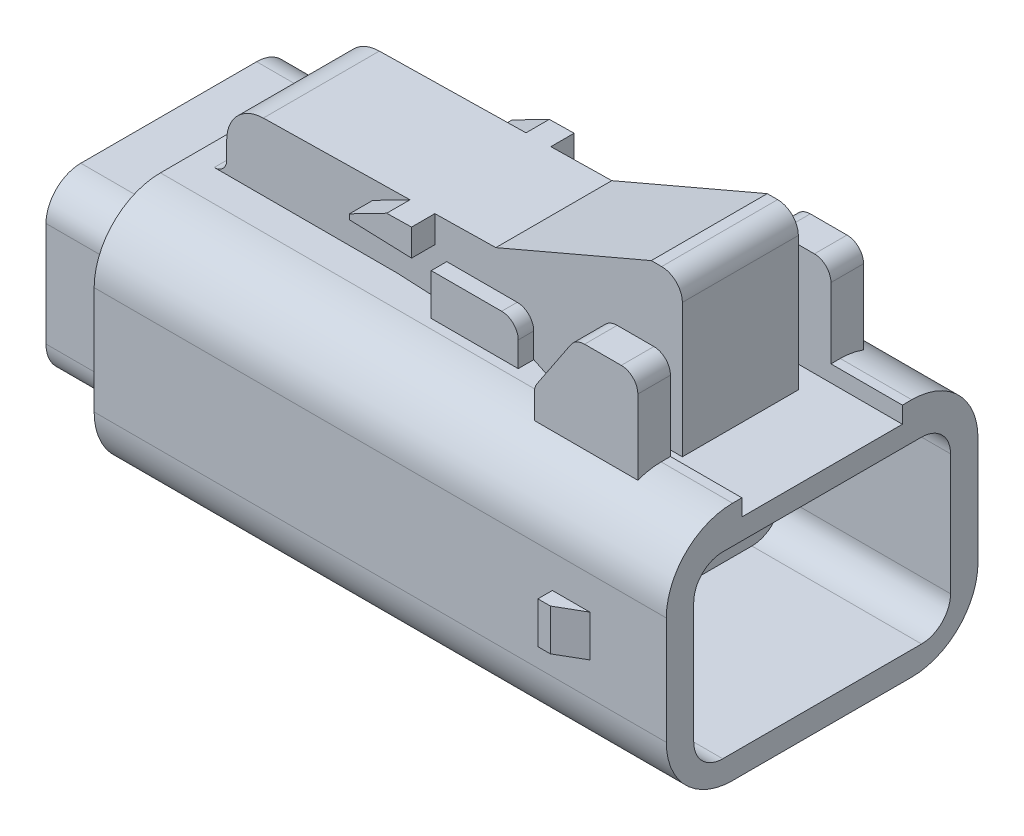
ISO-10303-21;
HEADER;
FILE_DESCRIPTION(('STEP AP214'),'2;1');
FILE_NAME('part.step','',(''),(''),'','','');
FILE_SCHEMA(('AUTOMOTIVE_DESIGN { 1 0 10303 214 1 1 1 1 }'));
ENDSEC;
DATA;
#1=APPLICATION_CONTEXT('core data for automotive mechanical design processes');
#2=APPLICATION_PROTOCOL_DEFINITION('international standard','automotive_design',2000,#1);
#3=PRODUCT_CONTEXT('',#1,'mechanical');
#4=PRODUCT('Part','Part','',(#3));
#5=PRODUCT_RELATED_PRODUCT_CATEGORY('part','',(#4));
#6=PRODUCT_DEFINITION_FORMATION('','',#4);
#7=PRODUCT_DEFINITION_CONTEXT('part definition',#1,'design');
#8=PRODUCT_DEFINITION('design','',#6,#7);
#9=PRODUCT_DEFINITION_SHAPE('','',#8);
#10=(LENGTH_UNIT() NAMED_UNIT(*) SI_UNIT(.MILLI.,.METRE.));
#11=(NAMED_UNIT(*) PLANE_ANGLE_UNIT() SI_UNIT($,.RADIAN.));
#12=(NAMED_UNIT(*) SI_UNIT($,.STERADIAN.) SOLID_ANGLE_UNIT());
#13=UNCERTAINTY_MEASURE_WITH_UNIT(LENGTH_MEASURE(1.E-05),#10,'distance_accuracy_value','');
#14=(GEOMETRIC_REPRESENTATION_CONTEXT(3) GLOBAL_UNCERTAINTY_ASSIGNED_CONTEXT((#13)) GLOBAL_UNIT_ASSIGNED_CONTEXT((#10,
#11,#12)) REPRESENTATION_CONTEXT('',''));
#15=CARTESIAN_POINT('',(0.,0.,0.));
#16=DIRECTION('',(0.,0.,1.));
#17=DIRECTION('',(1.,0.,0.));
#18=AXIS2_PLACEMENT_3D('',#15,#16,#17);
#19=CARTESIAN_POINT('',(31.55,1.,-2.7));
#20=DIRECTION('',(-1.,0.,0.));
#21=DIRECTION('',(0.,1.,0.));
#22=AXIS2_PLACEMENT_3D('',#19,#20,#21);
#23=CYLINDRICAL_SURFACE('',#22,0.65);
#24=DIRECTION('',(-1.,0.,0.));
#25=VECTOR('',#24,1.);
#26=CARTESIAN_POINT('',(23.359,1.,-3.35));
#27=LINE('',#26,#25);
#28=CARTESIAN_POINT('',(23.359,1.,-3.35));
#29=VERTEX_POINT('',#28);
#30=CARTESIAN_POINT('',(0.,1.,-3.35));
#31=VERTEX_POINT('',#30);
#32=EDGE_CURVE('E10',#29,#31,#27,.T.);
#33=ORIENTED_EDGE('',*,*,#32,.T.);
#34=CARTESIAN_POINT('',(0.,1.,-2.7));
#35=DIRECTION('',(1.,0.,0.));
#36=DIRECTION('',(0.,0.,-1.));
#37=AXIS2_PLACEMENT_3D('',#34,#35,#36);
#38=CIRCLE('',#37,0.65);
#39=CARTESIAN_POINT('',(0.,1.,-2.05));
#40=VERTEX_POINT('',#39);
#41=EDGE_CURVE('E24',#40,#31,#38,.T.);
#42=ORIENTED_EDGE('',*,*,#41,.F.);
#43=DIRECTION('',(-1.,0.,0.));
#44=VECTOR('',#43,1.);
#45=CARTESIAN_POINT('',(23.359,1.,-2.05));
#46=LINE('',#45,#44);
#47=CARTESIAN_POINT('',(23.359,1.,-2.05));
#48=VERTEX_POINT('',#47);
#49=EDGE_CURVE('E1611',#48,#40,#46,.T.);
#50=ORIENTED_EDGE('',*,*,#49,.F.);
#51=CARTESIAN_POINT('',(23.359,1.,-2.7));
#52=DIRECTION('',(1.,0.,0.));
#53=DIRECTION('',(0.,0.,-1.));
#54=AXIS2_PLACEMENT_3D('',#51,#52,#53);
#55=CIRCLE('',#54,0.65);
#56=EDGE_CURVE('E1607',#48,#29,#55,.T.);
#57=ORIENTED_EDGE('',*,*,#56,.T.);
#58=EDGE_LOOP('',(#33,#42,#50,#57));
#59=FACE_BOUND('',#58,.T.);
#60=ADVANCED_FACE('F16',(#59),#23,.F.);
#61=CARTESIAN_POINT('',(23.359,-3.25000000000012,4.80000000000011));
#62=DIRECTION('',(1.,0.,0.));
#63=DIRECTION('',(0.,0.,-1.));
#64=AXIS2_PLACEMENT_3D('',#61,#62,#63);
#65=PLANE('',#64);
#66=ORIENTED_EDGE('',*,*,#56,.F.);
#67=CARTESIAN_POINT('',(23.359,1.,-2.7));
#68=DIRECTION('',(1.,0.,0.));
#69=DIRECTION('',(0.,0.,-1.));
#70=AXIS2_PLACEMENT_3D('',#67,#68,#69);
#71=CIRCLE('',#70,0.65);
#72=EDGE_CURVE('E1602',#29,#48,#71,.T.);
#73=ORIENTED_EDGE('',*,*,#72,.F.);
#74=EDGE_LOOP('',(#66,#73));
#75=FACE_BOUND('',#74,.T.);
#76=CARTESIAN_POINT('',(23.359,1.,2.7));
#77=DIRECTION('',(1.,0.,0.));
#78=DIRECTION('',(0.,0.,-1.));
#79=AXIS2_PLACEMENT_3D('',#76,#77,#78);
#80=CIRCLE('',#79,0.65);
#81=CARTESIAN_POINT('',(23.359,1.,3.35));
#82=VERTEX_POINT('',#81);
#83=CARTESIAN_POINT('',(23.359,1.,2.05));
#84=VERTEX_POINT('',#83);
#85=EDGE_CURVE('E1597',#82,#84,#80,.T.);
#86=ORIENTED_EDGE('',*,*,#85,.F.);
#87=CARTESIAN_POINT('',(23.359,1.,2.7));
#88=DIRECTION('',(1.,0.,0.));
#89=DIRECTION('',(0.,0.,-1.));
#90=AXIS2_PLACEMENT_3D('',#87,#88,#89);
#91=CIRCLE('',#90,0.65);
#92=EDGE_CURVE('E1592',#84,#82,#91,.T.);
#93=ORIENTED_EDGE('',*,*,#92,.F.);
#94=EDGE_LOOP('',(#86,#93));
#95=FACE_BOUND('',#94,.T.);
#96=DIRECTION('',(0.,-1.,0.));
#97=VECTOR('',#96,1.);
#98=CARTESIAN_POINT('',(23.359,2.6,6.2));
#99=LINE('',#98,#97);
#100=CARTESIAN_POINT('',(23.359,2.6,6.2));
#101=VERTEX_POINT('',#100);
#102=CARTESIAN_POINT('',(23.359,-3.25,6.2));
#103=VERTEX_POINT('',#102);
#104=EDGE_CURVE('E1588',#101,#103,#99,.T.);
#105=ORIENTED_EDGE('',*,*,#104,.T.);
#106=CARTESIAN_POINT('',(23.359,-3.25000000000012,4.80000000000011));
#107=DIRECTION('',(1.,0.,0.));
#108=DIRECTION('',(0.,0.,-1.));
#109=AXIS2_PLACEMENT_3D('',#106,#107,#108);
#110=CIRCLE('',#109,1.39999999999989);
#111=CARTESIAN_POINT('',(23.359,-4.65,4.8));
#112=VERTEX_POINT('',#111);
#113=EDGE_CURVE('E1584',#103,#112,#110,.T.);
#114=ORIENTED_EDGE('',*,*,#113,.T.);
#115=DIRECTION('',(0.,0.,-1.));
#116=VECTOR('',#115,1.);
#117=CARTESIAN_POINT('',(23.359,-4.65,4.8));
#118=LINE('',#117,#116);
#119=CARTESIAN_POINT('',(23.359,-4.65,-4.8));
#120=VERTEX_POINT('',#119);
#121=EDGE_CURVE('E1580',#112,#120,#118,.T.);
#122=ORIENTED_EDGE('',*,*,#121,.T.);
#123=CARTESIAN_POINT('',(23.359,-3.25000000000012,-4.80000000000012));
#124=DIRECTION('',(1.,0.,0.));
#125=DIRECTION('',(0.,0.,-1.));
#126=AXIS2_PLACEMENT_3D('',#123,#124,#125);
#127=CIRCLE('',#126,1.39999999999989);
#128=CARTESIAN_POINT('',(23.359,-3.25,-6.2));
#129=VERTEX_POINT('',#128);
#130=EDGE_CURVE('E1576',#120,#129,#127,.T.);
#131=ORIENTED_EDGE('',*,*,#130,.T.);
#132=DIRECTION('',(0.,1.,0.));
#133=VECTOR('',#132,1.);
#134=CARTESIAN_POINT('',(23.359,-3.25,-6.2));
#135=LINE('',#134,#133);
#136=CARTESIAN_POINT('',(23.359,2.6,-6.2));
#137=VERTEX_POINT('',#136);
#138=EDGE_CURVE('E1572',#129,#137,#135,.T.);
#139=ORIENTED_EDGE('',*,*,#138,.T.);
#140=CARTESIAN_POINT('',(23.359,2.60000000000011,-4.80000000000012));
#141=DIRECTION('',(1.,0.,0.));
#142=DIRECTION('',(0.,0.,-1.));
#143=AXIS2_PLACEMENT_3D('',#140,#141,#142);
#144=CIRCLE('',#143,1.39999999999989);
#145=CARTESIAN_POINT('',(23.359,4.,-4.8));
#146=VERTEX_POINT('',#145);
#147=EDGE_CURVE('E1568',#137,#146,#144,.T.);
#148=ORIENTED_EDGE('',*,*,#147,.T.);
#149=DIRECTION('',(0.,0.,1.));
#150=VECTOR('',#149,1.);
#151=CARTESIAN_POINT('',(23.359,4.,-4.8));
#152=LINE('',#151,#150);
#153=CARTESIAN_POINT('',(23.359,4.,4.8));
#154=VERTEX_POINT('',#153);
#155=EDGE_CURVE('E1564',#146,#154,#152,.T.);
#156=ORIENTED_EDGE('',*,*,#155,.T.);
#157=CARTESIAN_POINT('',(23.359,2.60000000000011,4.80000000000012));
#158=DIRECTION('',(1.,0.,0.));
#159=DIRECTION('',(0.,0.,-1.));
#160=AXIS2_PLACEMENT_3D('',#157,#158,#159);
#161=CIRCLE('',#160,1.39999999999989);
#162=EDGE_CURVE('E1560',#154,#101,#161,.T.);
#163=ORIENTED_EDGE('',*,*,#162,.T.);
#164=EDGE_LOOP('',(#105,#114,#122,#131,#139,#148,#156,#163));
#165=FACE_BOUND('',#164,.T.);
#166=ADVANCED_FACE('F1627',(#75,#95,#165),#65,.T.);
#167=CARTESIAN_POINT('',(33.359,2.60000000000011,4.80000000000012));
#168=DIRECTION('',(-1.,0.,0.));
#169=DIRECTION('',(0.,-0.707106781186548,-0.707106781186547));
#170=AXIS2_PLACEMENT_3D('',#167,#168,#169);
#171=CYLINDRICAL_SURFACE('',#170,1.39999999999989);
#172=DIRECTION('',(-1.,0.,0.));
#173=VECTOR('',#172,1.);
#174=CARTESIAN_POINT('',(33.359,2.6,6.2));
#175=LINE('',#174,#173);
#176=CARTESIAN_POINT('',(31.55,2.6,6.2));
#177=VERTEX_POINT('',#176);
#178=EDGE_CURVE('E1555',#177,#101,#175,.T.);
#179=ORIENTED_EDGE('',*,*,#178,.T.);
#180=ORIENTED_EDGE('',*,*,#162,.F.);
#181=DIRECTION('',(-1.,0.,0.));
#182=VECTOR('',#181,1.);
#183=CARTESIAN_POINT('',(33.359,4.,4.8));
#184=LINE('',#183,#182);
#185=CARTESIAN_POINT('',(31.55,4.,4.8));
#186=VERTEX_POINT('',#185);
#187=EDGE_CURVE('E1550',#186,#154,#184,.T.);
#188=ORIENTED_EDGE('',*,*,#187,.F.);
#189=CARTESIAN_POINT('',(31.55,2.60000000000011,4.80000000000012));
#190=DIRECTION('',(-1.,0.,0.));
#191=DIRECTION('',(0.,0.,-1.));
#192=AXIS2_PLACEMENT_3D('',#189,#190,#191);
#193=CIRCLE('',#192,1.39999999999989);
#194=EDGE_CURVE('E1545',#177,#186,#193,.T.);
#195=ORIENTED_EDGE('',*,*,#194,.F.);
#196=EDGE_LOOP('',(#179,#180,#188,#195));
#197=FACE_BOUND('',#196,.T.);
#198=ADVANCED_FACE('F1630',(#197),#171,.F.);
#199=CARTESIAN_POINT('',(31.55,-2.60000000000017,4.32500000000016));
#200=DIRECTION('',(1.,0.,0.));
#201=DIRECTION('',(0.,0.,-1.));
#202=AXIS2_PLACEMENT_3D('',#199,#200,#201);
#203=PLANE('',#202);
#204=CARTESIAN_POINT('',(31.55,-3.25000000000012,4.80000000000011));
#205=DIRECTION('',(-1.,0.,0.));
#206=DIRECTION('',(0.,0.,-1.));
#207=AXIS2_PLACEMENT_3D('',#204,#205,#206);
#208=CIRCLE('',#207,1.39999999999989);
#209=CARTESIAN_POINT('',(31.55,-4.65,4.8));
#210=VERTEX_POINT('',#209);
#211=CARTESIAN_POINT('',(31.55,-3.25,6.2));
#212=VERTEX_POINT('',#211);
#213=EDGE_CURVE('E1541',#210,#212,#208,.T.);
#214=ORIENTED_EDGE('',*,*,#213,.T.);
#215=DIRECTION('',(0.,1.,0.));
#216=VECTOR('',#215,1.);
#217=CARTESIAN_POINT('',(31.55,-2.60000000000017,6.2));
#218=LINE('',#217,#216);
#219=EDGE_CURVE('E1536',#212,#177,#218,.T.);
#220=ORIENTED_EDGE('',*,*,#219,.T.);
#221=ORIENTED_EDGE('',*,*,#194,.T.);
#222=DIRECTION('',(0.,0.,-1.));
#223=VECTOR('',#222,1.);
#224=CARTESIAN_POINT('',(31.55,4.,4.32500000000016));
#225=LINE('',#224,#223);
#226=CARTESIAN_POINT('',(31.55,4.,-4.8));
#227=VERTEX_POINT('',#226);
#228=EDGE_CURVE('E1532',#186,#227,#225,.T.);
#229=ORIENTED_EDGE('',*,*,#228,.T.);
#230=CARTESIAN_POINT('',(31.55,2.60000000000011,-4.80000000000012));
#231=DIRECTION('',(-1.,0.,0.));
#232=DIRECTION('',(0.,0.,-1.));
#233=AXIS2_PLACEMENT_3D('',#230,#231,#232);
#234=CIRCLE('',#233,1.39999999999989);
#235=CARTESIAN_POINT('',(31.55,2.6,-6.2));
#236=VERTEX_POINT('',#235);
#237=EDGE_CURVE('E1528',#227,#236,#234,.T.);
#238=ORIENTED_EDGE('',*,*,#237,.T.);
#239=DIRECTION('',(0.,-1.,0.));
#240=VECTOR('',#239,1.);
#241=CARTESIAN_POINT('',(31.55,-2.60000000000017,-6.2));
#242=LINE('',#241,#240);
#243=CARTESIAN_POINT('',(31.55,-3.25,-6.2));
#244=VERTEX_POINT('',#243);
#245=EDGE_CURVE('E1524',#236,#244,#242,.T.);
#246=ORIENTED_EDGE('',*,*,#245,.T.);
#247=CARTESIAN_POINT('',(31.55,-3.25000000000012,-4.80000000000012));
#248=DIRECTION('',(-1.,0.,0.));
#249=DIRECTION('',(0.,0.,-1.));
#250=AXIS2_PLACEMENT_3D('',#247,#248,#249);
#251=CIRCLE('',#250,1.39999999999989);
#252=CARTESIAN_POINT('',(31.55,-4.65,-4.8));
#253=VERTEX_POINT('',#252);
#254=EDGE_CURVE('E1520',#244,#253,#251,.T.);
#255=ORIENTED_EDGE('',*,*,#254,.T.);
#256=DIRECTION('',(0.,0.,1.));
#257=VECTOR('',#256,1.);
#258=CARTESIAN_POINT('',(31.55,-4.65,4.32500000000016));
#259=LINE('',#258,#257);
#260=EDGE_CURVE('E1516',#253,#210,#259,.T.);
#261=ORIENTED_EDGE('',*,*,#260,.T.);
#262=EDGE_LOOP('',(#214,#220,#221,#229,#238,#246,#255,#261));
#263=FACE_BOUND('',#262,.T.);
#264=DIRECTION('',(0.,0.,1.));
#265=VECTOR('',#264,1.);
#266=CARTESIAN_POINT('',(31.55,5.,4.32500000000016));
#267=LINE('',#266,#265);
#268=CARTESIAN_POINT('',(31.55,5.,-3.875));
#269=VERTEX_POINT('',#268);
#270=CARTESIAN_POINT('',(31.55,5.,3.875));
#271=VERTEX_POINT('',#270);
#272=EDGE_CURVE('E1512',#269,#271,#267,.T.);
#273=ORIENTED_EDGE('',*,*,#272,.T.);
#274=DIRECTION('',(0.,1.,0.));
#275=VECTOR('',#274,1.);
#276=CARTESIAN_POINT('',(31.55,-2.60000000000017,3.875));
#277=LINE('',#276,#275);
#278=CARTESIAN_POINT('',(31.55,5.8,3.875));
#279=VERTEX_POINT('',#278);
#280=EDGE_CURVE('E1508',#271,#279,#277,.T.);
#281=ORIENTED_EDGE('',*,*,#280,.T.);
#282=DIRECTION('',(0.,0.,1.));
#283=VECTOR('',#282,1.);
#284=CARTESIAN_POINT('',(31.55,5.8,-4.325));
#285=LINE('',#284,#283);
#286=CARTESIAN_POINT('',(31.55,5.8,4.325));
#287=VERTEX_POINT('',#286);
#288=EDGE_CURVE('E1504',#279,#287,#285,.T.);
#289=ORIENTED_EDGE('',*,*,#288,.T.);
#290=CARTESIAN_POINT('',(31.55,2.60000000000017,4.32500000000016));
#291=DIRECTION('',(1.,0.,0.));
#292=DIRECTION('',(0.,0.,-1.));
#293=AXIS2_PLACEMENT_3D('',#290,#291,#292);
#294=CIRCLE('',#293,3.19999999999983);
#295=CARTESIAN_POINT('',(31.55,2.6,7.525));
#296=VERTEX_POINT('',#295);
#297=EDGE_CURVE('E1500',#287,#296,#294,.T.);
#298=ORIENTED_EDGE('',*,*,#297,.T.);
#299=DIRECTION('',(0.,-1.,0.));
#300=VECTOR('',#299,1.);
#301=CARTESIAN_POINT('',(31.55,2.6,7.525));
#302=LINE('',#301,#300);
#303=CARTESIAN_POINT('',(31.55,-2.6,7.525));
#304=VERTEX_POINT('',#303);
#305=EDGE_CURVE('E1496',#296,#304,#302,.T.);
#306=ORIENTED_EDGE('',*,*,#305,.T.);
#307=CARTESIAN_POINT('',(31.55,-2.60000000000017,4.32500000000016));
#308=DIRECTION('',(1.,0.,0.));
#309=DIRECTION('',(0.,0.,-1.));
#310=AXIS2_PLACEMENT_3D('',#307,#308,#309);
#311=CIRCLE('',#310,3.19999999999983);
#312=CARTESIAN_POINT('',(31.55,-5.8,4.325));
#313=VERTEX_POINT('',#312);
#314=EDGE_CURVE('E1492',#304,#313,#311,.T.);
#315=ORIENTED_EDGE('',*,*,#314,.T.);
#316=DIRECTION('',(0.,0.,-1.));
#317=VECTOR('',#316,1.);
#318=CARTESIAN_POINT('',(31.55,-5.8,4.325));
#319=LINE('',#318,#317);
#320=CARTESIAN_POINT('',(31.55,-5.8,-4.325));
#321=VERTEX_POINT('',#320);
#322=EDGE_CURVE('E1488',#313,#321,#319,.T.);
#323=ORIENTED_EDGE('',*,*,#322,.T.);
#324=CARTESIAN_POINT('',(31.55,-2.60000000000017,-4.32500000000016));
#325=DIRECTION('',(1.,0.,0.));
#326=DIRECTION('',(0.,0.,-1.));
#327=AXIS2_PLACEMENT_3D('',#324,#325,#326);
#328=CIRCLE('',#327,3.19999999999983);
#329=CARTESIAN_POINT('',(31.55,-2.6,-7.525));
#330=VERTEX_POINT('',#329);
#331=EDGE_CURVE('E1484',#321,#330,#328,.T.);
#332=ORIENTED_EDGE('',*,*,#331,.T.);
#333=DIRECTION('',(0.,1.,0.));
#334=VECTOR('',#333,1.);
#335=CARTESIAN_POINT('',(31.55,-2.6,-7.525));
#336=LINE('',#335,#334);
#337=CARTESIAN_POINT('',(31.55,2.6,-7.525));
#338=VERTEX_POINT('',#337);
#339=EDGE_CURVE('E1480',#330,#338,#336,.T.);
#340=ORIENTED_EDGE('',*,*,#339,.T.);
#341=CARTESIAN_POINT('',(31.55,2.60000000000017,-4.32500000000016));
#342=DIRECTION('',(1.,0.,0.));
#343=DIRECTION('',(0.,0.,-1.));
#344=AXIS2_PLACEMENT_3D('',#341,#342,#343);
#345=CIRCLE('',#344,3.19999999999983);
#346=CARTESIAN_POINT('',(31.55,5.8,-4.325));
#347=VERTEX_POINT('',#346);
#348=EDGE_CURVE('E1476',#338,#347,#345,.T.);
#349=ORIENTED_EDGE('',*,*,#348,.T.);
#350=DIRECTION('',(0.,0.,1.));
#351=VECTOR('',#350,1.);
#352=CARTESIAN_POINT('',(31.55,5.8,-4.325));
#353=LINE('',#352,#351);
#354=CARTESIAN_POINT('',(31.55,5.8,-3.875));
#355=VERTEX_POINT('',#354);
#356=EDGE_CURVE('E1472',#347,#355,#353,.T.);
#357=ORIENTED_EDGE('',*,*,#356,.T.);
#358=DIRECTION('',(0.,-1.,0.));
#359=VECTOR('',#358,1.);
#360=CARTESIAN_POINT('',(31.55,-2.60000000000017,-3.875));
#361=LINE('',#360,#359);
#362=EDGE_CURVE('E1468',#355,#269,#361,.T.);
#363=ORIENTED_EDGE('',*,*,#362,.T.);
#364=EDGE_LOOP('',(#273,#281,#289,#298,#306,#315,#323,#332,#340,#349,#357,#363));
#365=FACE_BOUND('',#364,.T.);
#366=ADVANCED_FACE('F2084',(#263,#365),#203,.T.);
#367=CARTESIAN_POINT('',(37.45,8.925,-3.875));
#368=DIRECTION('',(0.,0.,1.));
#369=DIRECTION('',(1.,0.,0.));
#370=AXIS2_PLACEMENT_3D('',#367,#368,#369);
#371=PLANE('',#370);
#372=DIRECTION('',(-1.,0.,0.));
#373=VECTOR('',#372,1.);
#374=CARTESIAN_POINT('',(31.55,5.8,-3.875));
#375=LINE('',#374,#373);
#376=CARTESIAN_POINT('',(28.1,5.8,-3.875));
#377=VERTEX_POINT('',#376);
#378=EDGE_CURVE('E1464',#355,#377,#375,.T.);
#379=ORIENTED_EDGE('',*,*,#378,.T.);
#380=DIRECTION('',(0.,1.,0.));
#381=VECTOR('',#380,1.);
#382=CARTESIAN_POINT('',(28.1,5.,-3.875));
#383=LINE('',#382,#381);
#384=CARTESIAN_POINT('',(28.1,9.2,-3.875));
#385=VERTEX_POINT('',#384);
#386=EDGE_CURVE('E1460',#377,#385,#383,.T.);
#387=ORIENTED_EDGE('',*,*,#386,.T.);
#388=CARTESIAN_POINT('',(27.2999999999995,9.19999999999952,-3.875));
#389=DIRECTION('',(0.,0.,1.));
#390=DIRECTION('',(1.,0.,0.));
#391=AXIS2_PLACEMENT_3D('',#388,#389,#390);
#392=CIRCLE('',#391,0.800000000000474);
#393=CARTESIAN_POINT('',(27.3,10.,-3.875));
#394=VERTEX_POINT('',#393);
#395=EDGE_CURVE('E1456',#385,#394,#392,.T.);
#396=ORIENTED_EDGE('',*,*,#395,.T.);
#397=DIRECTION('',(-1.,0.,0.));
#398=VECTOR('',#397,1.);
#399=CARTESIAN_POINT('',(27.3,10.,-3.875));
#400=LINE('',#399,#398);
#401=CARTESIAN_POINT('',(25.52814700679,10.,-3.875));
#402=VERTEX_POINT('',#401);
#403=EDGE_CURVE('E1452',#394,#402,#400,.T.);
#404=ORIENTED_EDGE('',*,*,#403,.T.);
#405=CARTESIAN_POINT('',(25.5281470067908,9.19999999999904,-3.875));
#406=DIRECTION('',(0.,0.,1.));
#407=DIRECTION('',(1.,0.,0.));
#408=AXIS2_PLACEMENT_3D('',#405,#406,#407);
#409=CIRCLE('',#408,0.800000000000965);
#410=CARTESIAN_POINT('',(24.86250677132,9.6437601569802,-3.875));
#411=VERTEX_POINT('',#410);
#412=EDGE_CURVE('E1448',#402,#411,#409,.T.);
#413=ORIENTED_EDGE('',*,*,#412,.T.);
#414=DIRECTION('',(-0.554700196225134,-0.832050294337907,0.));
#415=VECTOR('',#414,1.);
#416=CARTESIAN_POINT('',(24.86250677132,9.6437601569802,-3.875));
#417=LINE('',#416,#415);
#418=CARTESIAN_POINT('',(23.23435976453,7.2015396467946,-3.875));
#419=VERTEX_POINT('',#418);
#420=EDGE_CURVE('E1444',#411,#419,#417,.T.);
#421=ORIENTED_EDGE('',*,*,#420,.T.);
#422=CARTESIAN_POINT('',(23.9000000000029,6.75777948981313,-3.875));
#423=DIRECTION('',(0.,0.,1.));
#424=DIRECTION('',(1.,0.,0.));
#425=AXIS2_PLACEMENT_3D('',#422,#423,#424);
#426=CIRCLE('',#425,0.800000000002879);
#427=CARTESIAN_POINT('',(23.1,6.7577794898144,-3.875));
#428=VERTEX_POINT('',#427);
#429=EDGE_CURVE('E1440',#419,#428,#426,.T.);
#430=ORIENTED_EDGE('',*,*,#429,.T.);
#431=DIRECTION('',(0.,-1.,0.));
#432=VECTOR('',#431,1.);
#433=CARTESIAN_POINT('',(23.1,6.7577794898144,-3.875));
#434=LINE('',#433,#432);
#435=CARTESIAN_POINT('',(23.1,5.8,-3.875));
#436=VERTEX_POINT('',#435);
#437=EDGE_CURVE('E1436',#428,#436,#434,.T.);
#438=ORIENTED_EDGE('',*,*,#437,.T.);
#439=DIRECTION('',(0.,-1.,0.));
#440=VECTOR('',#439,1.);
#441=CARTESIAN_POINT('',(23.1,8.925,-3.875));
#442=LINE('',#441,#440);
#443=CARTESIAN_POINT('',(23.1,5.,-3.875));
#444=VERTEX_POINT('',#443);
#445=EDGE_CURVE('E1432',#436,#444,#442,.T.);
#446=ORIENTED_EDGE('',*,*,#445,.T.);
#447=DIRECTION('',(-1.,0.,0.));
#448=VECTOR('',#447,1.);
#449=CARTESIAN_POINT('',(37.45,5.,-3.875));
#450=LINE('',#449,#448);
#451=EDGE_CURVE('E1427',#269,#444,#450,.T.);
#452=ORIENTED_EDGE('',*,*,#451,.F.);
#453=ORIENTED_EDGE('',*,*,#362,.F.);
#454=EDGE_LOOP('',(#379,#387,#396,#404,#413,#421,#430,#438,#446,#452,#453));
#455=FACE_BOUND('',#454,.T.);
#456=ADVANCED_FACE('F2055',(#455),#371,.T.);
#457=CARTESIAN_POINT('',(0.,5.,0.));
#458=DIRECTION('',(0.,1.,0.));
#459=DIRECTION('',(0.,0.,1.));
#460=AXIS2_PLACEMENT_3D('',#457,#458,#459);
#461=PLANE('',#460);
#462=DIRECTION('',(1.,0.,0.));
#463=VECTOR('',#462,1.);
#464=CARTESIAN_POINT('',(0.,5.,2.8));
#465=LINE('',#464,#463);
#466=CARTESIAN_POINT('',(13.834,5.,2.8));
#467=VERTEX_POINT('',#466);
#468=CARTESIAN_POINT('',(27.6,5.,2.8));
#469=VERTEX_POINT('',#468);
#470=EDGE_CURVE('E1423',#467,#469,#465,.T.);
#471=ORIENTED_EDGE('',*,*,#470,.F.);
#472=DIRECTION('',(0.998897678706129,0.,0.0469406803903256));
#473=VECTOR('',#472,1.);
#474=CARTESIAN_POINT('',(7.45,5.,2.5));
#475=LINE('',#474,#473);
#476=CARTESIAN_POINT('',(20.75,5.,3.125));
#477=VERTEX_POINT('',#476);
#478=EDGE_CURVE('E1419',#467,#477,#475,.T.);
#479=ORIENTED_EDGE('',*,*,#478,.T.);
#480=DIRECTION('',(0.952659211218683,0.,0.304040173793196));
#481=VECTOR('',#480,1.);
#482=CARTESIAN_POINT('',(20.75,5.,3.125));
#483=LINE('',#482,#481);
#484=CARTESIAN_POINT('',(23.1,5.,3.875));
#485=VERTEX_POINT('',#484);
#486=EDGE_CURVE('E1415',#477,#485,#483,.T.);
#487=ORIENTED_EDGE('',*,*,#486,.T.);
#488=DIRECTION('',(1.,0.,0.));
#489=VECTOR('',#488,1.);
#490=CARTESIAN_POINT('',(23.1,5.,3.875));
#491=LINE('',#490,#489);
#492=EDGE_CURVE('E1410',#485,#271,#491,.T.);
#493=ORIENTED_EDGE('',*,*,#492,.T.);
#494=ORIENTED_EDGE('',*,*,#272,.F.);
#495=ORIENTED_EDGE('',*,*,#451,.T.);
#496=DIRECTION('',(-0.952659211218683,0.,0.304040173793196));
#497=VECTOR('',#496,1.);
#498=CARTESIAN_POINT('',(23.1,5.,-3.875));
#499=LINE('',#498,#497);
#500=CARTESIAN_POINT('',(20.75,5.,-3.125));
#501=VERTEX_POINT('',#500);
#502=EDGE_CURVE('E1406',#444,#501,#499,.T.);
#503=ORIENTED_EDGE('',*,*,#502,.T.);
#504=DIRECTION('',(-0.998897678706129,0.,0.0469406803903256));
#505=VECTOR('',#504,1.);
#506=CARTESIAN_POINT('',(20.75,5.,-3.125));
#507=LINE('',#506,#505);
#508=CARTESIAN_POINT('',(13.8340000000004,5.,-2.8));
#509=VERTEX_POINT('',#508);
#510=EDGE_CURVE('E1402',#501,#509,#507,.T.);
#511=ORIENTED_EDGE('',*,*,#510,.T.);
#512=DIRECTION('',(1.,0.,0.));
#513=VECTOR('',#512,1.);
#514=CARTESIAN_POINT('',(0.,5.,-2.8));
#515=LINE('',#514,#513);
#516=CARTESIAN_POINT('',(27.6,5.,-2.8));
#517=VERTEX_POINT('',#516);
#518=EDGE_CURVE('E1398',#509,#517,#515,.T.);
#519=ORIENTED_EDGE('',*,*,#518,.T.);
#520=DIRECTION('',(0.,0.,1.));
#521=VECTOR('',#520,1.);
#522=CARTESIAN_POINT('',(27.6,5.,0.));
#523=LINE('',#522,#521);
#524=EDGE_CURVE('E1394',#517,#469,#523,.T.);
#525=ORIENTED_EDGE('',*,*,#524,.T.);
#526=EDGE_LOOP('',(#471,#479,#487,#493,#494,#495,#503,#511,#519,#525));
#527=FACE_BOUND('',#526,.T.);
#528=ADVANCED_FACE('F1953',(#527),#461,.T.);
#529=CARTESIAN_POINT('',(27.6,4.8,2.8));
#530=DIRECTION('',(-1.,0.,0.));
#531=DIRECTION('',(0.,0.,1.));
#532=AXIS2_PLACEMENT_3D('',#529,#530,#531);
#533=PLANE('',#532);
#534=DIRECTION('',(0.,1.,0.));
#535=VECTOR('',#534,1.);
#536=CARTESIAN_POINT('',(27.6,4.8,-2.8));
#537=LINE('',#536,#535);
#538=CARTESIAN_POINT('',(27.6,11.456,-2.8));
#539=VERTEX_POINT('',#538);
#540=EDGE_CURVE('E1390',#517,#539,#537,.T.);
#541=ORIENTED_EDGE('',*,*,#540,.T.);
#542=DIRECTION('',(0.,0.,1.));
#543=VECTOR('',#542,1.);
#544=CARTESIAN_POINT('',(27.6,11.4560000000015,5.));
#545=LINE('',#544,#543);
#546=CARTESIAN_POINT('',(27.6,11.456,2.8));
#547=VERTEX_POINT('',#546);
#548=EDGE_CURVE('E1386',#539,#547,#545,.T.);
#549=ORIENTED_EDGE('',*,*,#548,.T.);
#550=DIRECTION('',(0.,1.,0.));
#551=VECTOR('',#550,1.);
#552=CARTESIAN_POINT('',(27.6,4.8,2.8));
#553=LINE('',#552,#551);
#554=EDGE_CURVE('E1381',#469,#547,#553,.T.);
#555=ORIENTED_EDGE('',*,*,#554,.F.);
#556=ORIENTED_EDGE('',*,*,#524,.F.);
#557=EDGE_LOOP('',(#541,#549,#555,#556));
#558=FACE_BOUND('',#557,.T.);
#559=ADVANCED_FACE('F1350',(#558),#533,.F.);
#560=CARTESIAN_POINT('',(0.,0.,2.8));
#561=DIRECTION('',(0.,0.,1.));
#562=DIRECTION('',(1.,0.,0.));
#563=AXIS2_PLACEMENT_3D('',#560,#561,#562);
#564=PLANE('',#563);
#565=DIRECTION('',(0.,-1.,0.));
#566=VECTOR('',#565,1.);
#567=CARTESIAN_POINT('',(5.6,0.,2.8));
#568=LINE('',#567,#566);
#569=CARTESIAN_POINT('',(5.6,7.251,2.8));
#570=VERTEX_POINT('',#569);
#571=CARTESIAN_POINT('',(5.6,6.4,2.8));
#572=VERTEX_POINT('',#571);
#573=EDGE_CURVE('E1377',#570,#572,#568,.T.);
#574=ORIENTED_EDGE('',*,*,#573,.T.);
#575=CARTESIAN_POINT('',(4.9999999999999,6.4000000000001,2.8));
#576=DIRECTION('',(0.,0.,-1.));
#577=DIRECTION('',(1.,0.,0.));
#578=AXIS2_PLACEMENT_3D('',#575,#576,#577);
#579=CIRCLE('',#578,0.600000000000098);
#580=CARTESIAN_POINT('',(5.,5.8,2.8));
#581=VERTEX_POINT('',#580);
#582=EDGE_CURVE('E1373',#572,#581,#579,.T.);
#583=ORIENTED_EDGE('',*,*,#582,.T.);
#584=DIRECTION('',(-1.,0.,0.));
#585=VECTOR('',#584,1.);
#586=CARTESIAN_POINT('',(31.55,5.8,2.8));
#587=LINE('',#586,#585);
#588=CARTESIAN_POINT('',(13.834,5.8,2.8));
#589=VERTEX_POINT('',#588);
#590=EDGE_CURVE('E1370',#589,#581,#587,.T.);
#591=ORIENTED_EDGE('',*,*,#590,.F.);
#592=CARTESIAN_POINT('',(13.834,5.8,2.8));
#593=DIRECTION('',(0.,-1.,0.));
#594=VECTOR('',#593,1.);
#595=LINE('',#592,#594);
#596=EDGE_CURVE('E1368',#589,#467,#595,.T.);
#597=ORIENTED_EDGE('',*,*,#596,.T.);
#598=ORIENTED_EDGE('',*,*,#470,.T.);
#599=ORIENTED_EDGE('',*,*,#554,.T.);
#600=CARTESIAN_POINT('',(26.6000000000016,11.4560000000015,2.8));
#601=DIRECTION('',(0.,0.,-1.));
#602=DIRECTION('',(1.,0.,0.));
#603=AXIS2_PLACEMENT_3D('',#600,#601,#602);
#604=CIRCLE('',#603,0.999999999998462);
#605=CARTESIAN_POINT('',(26.6,12.456,2.8));
#606=VERTEX_POINT('',#605);
#607=EDGE_CURVE('E1801',#606,#547,#604,.T.);
#608=ORIENTED_EDGE('',*,*,#607,.F.);
#609=DIRECTION('',(-1.,0.,0.));
#610=VECTOR('',#609,1.);
#611=CARTESIAN_POINT('',(0.,12.456,2.8));
#612=LINE('',#611,#610);
#613=CARTESIAN_POINT('',(26.1,12.456,2.8));
#614=VERTEX_POINT('',#613);
#615=EDGE_CURVE('E1797',#606,#614,#612,.T.);
#616=ORIENTED_EDGE('',*,*,#615,.T.);
#617=DIRECTION('',(-0.919460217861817,-0.39318304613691,0.));
#618=VECTOR('',#617,1.);
#619=CARTESIAN_POINT('',(-0.468170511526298,1.09481872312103,2.8));
#620=LINE('',#619,#618);
#621=CARTESIAN_POINT('',(18.595,9.2466835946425,2.8));
#622=VERTEX_POINT('',#621);
#623=EDGE_CURVE('E1793',#614,#622,#620,.T.);
#624=ORIENTED_EDGE('',*,*,#623,.T.);
#625=DIRECTION('',(-0.999847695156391,-0.017452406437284,0.));
#626=VECTOR('',#625,1.);
#627=CARTESIAN_POINT('',(-0.155688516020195,8.91938910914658,2.8));
#628=LINE('',#627,#626);
#629=CARTESIAN_POINT('',(15.65,9.1952784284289,2.8));
#630=VERTEX_POINT('',#629);
#631=EDGE_CURVE('E1789',#622,#630,#628,.T.);
#632=ORIENTED_EDGE('',*,*,#631,.T.);
#633=DIRECTION('',(0.,-1.,0.));
#634=VECTOR('',#633,1.);
#635=CARTESIAN_POINT('',(15.65,0.,2.8));
#636=LINE('',#635,#634);
#637=CARTESIAN_POINT('',(15.65,7.8953075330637,2.8));
#638=VERTEX_POINT('',#637);
#639=EDGE_CURVE('E1785',#630,#638,#636,.T.);
#640=ORIENTED_EDGE('',*,*,#639,.T.);
#641=DIRECTION('',(-0.999390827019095,0.0348994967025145,0.));
#642=VECTOR('',#641,1.);
#643=CARTESIAN_POINT('',(0.294435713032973,8.4315356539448,2.8));
#644=LINE('',#643,#642);
#645=CARTESIAN_POINT('',(12.652,8.,2.8));
#646=VERTEX_POINT('',#645);
#647=EDGE_CURVE('E1781',#638,#646,#644,.T.);
#648=ORIENTED_EDGE('',*,*,#647,.T.);
#649=DIRECTION('',(0.,1.,0.));
#650=VECTOR('',#649,1.);
#651=CARTESIAN_POINT('',(12.652,0.,2.8));
#652=LINE('',#651,#650);
#653=CARTESIAN_POINT('',(12.652,8.25,2.8));
#654=VERTEX_POINT('',#653);
#655=EDGE_CURVE('E1777',#646,#654,#652,.T.);
#656=ORIENTED_EDGE('',*,*,#655,.T.);
#657=DIRECTION('',(0.889416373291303,0.457097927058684,0.));
#658=VECTOR('',#657,1.);
#659=CARTESIAN_POINT('',(-0.710550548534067,1.38258183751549,2.8));
#660=LINE('',#659,#658);
#661=CARTESIAN_POINT('',(14.4505757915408,9.17434240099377,2.8));
#662=VERTEX_POINT('',#661);
#663=EDGE_CURVE('E1773',#654,#662,#660,.T.);
#664=ORIENTED_EDGE('',*,*,#663,.T.);
#665=DIRECTION('',(-0.999847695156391,-0.017452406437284,0.));
#666=VECTOR('',#665,1.);
#667=CARTESIAN_POINT('',(-0.155688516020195,8.91938910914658,2.8));
#668=LINE('',#667,#666);
#669=CARTESIAN_POINT('',(7.3685856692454,9.0507258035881,2.8));
#670=VERTEX_POINT('',#669);
#671=EDGE_CURVE('E1769',#662,#670,#668,.T.);
#672=ORIENTED_EDGE('',*,*,#671,.T.);
#673=CARTESIAN_POINT('',(7.39999999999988,7.25099995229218,2.8));
#674=DIRECTION('',(0.,0.,-1.));
#675=DIRECTION('',(1.,0.,0.));
#676=AXIS2_PLACEMENT_3D('',#673,#674,#675);
#677=CIRCLE('',#676,1.79999999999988);
#678=EDGE_CURVE('E1764',#570,#670,#677,.T.);
#679=ORIENTED_EDGE('',*,*,#678,.F.);
#680=EDGE_LOOP('',(#574,#583,#591,#597,#598,#599,#608,#616,#624,#632,#640,#648,#656,#664,#672,#679));
#681=FACE_BOUND('',#680,.T.);
#682=ADVANCED_FACE('F1345',(#681),#564,.T.);
#683=CARTESIAN_POINT('',(7.39999999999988,7.25099995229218,5.));
#684=DIRECTION('',(0.,0.,-1.));
#685=DIRECTION('',(0.713250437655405,-0.700909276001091,0.));
#686=AXIS2_PLACEMENT_3D('',#683,#684,#685);
#687=CYLINDRICAL_SURFACE('',#686,1.79999999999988);
#688=ORIENTED_EDGE('',*,*,#678,.T.);
#689=DIRECTION('',(0.,0.,-1.));
#690=VECTOR('',#689,1.);
#691=CARTESIAN_POINT('',(7.3685856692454,9.0507258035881,5.));
#692=LINE('',#691,#690);
#693=CARTESIAN_POINT('',(7.3685856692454,9.0507258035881,-2.8));
#694=VERTEX_POINT('',#693);
#695=EDGE_CURVE('E1760',#670,#694,#692,.T.);
#696=ORIENTED_EDGE('',*,*,#695,.T.);
#697=CARTESIAN_POINT('',(7.39999999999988,7.25099995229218,-2.8));
#698=DIRECTION('',(0.,0.,-1.));
#699=DIRECTION('',(1.,0.,0.));
#700=AXIS2_PLACEMENT_3D('',#697,#698,#699);
#701=CIRCLE('',#700,1.79999999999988);
#702=CARTESIAN_POINT('',(5.6,7.251,-2.8));
#703=VERTEX_POINT('',#702);
#704=EDGE_CURVE('E1755',#703,#694,#701,.T.);
#705=ORIENTED_EDGE('',*,*,#704,.F.);
#706=DIRECTION('',(0.,0.,-1.));
#707=VECTOR('',#706,1.);
#708=CARTESIAN_POINT('',(5.6,7.251,5.));
#709=LINE('',#708,#707);
#710=EDGE_CURVE('E1750',#570,#703,#709,.T.);
#711=ORIENTED_EDGE('',*,*,#710,.F.);
#712=EDGE_LOOP('',(#688,#696,#705,#711));
#713=FACE_BOUND('',#712,.T.);
#714=ADVANCED_FACE('F1341',(#713),#687,.T.);
#715=CARTESIAN_POINT('',(5.6,6.4,5.));
#716=DIRECTION('',(-1.,0.,0.));
#717=DIRECTION('',(0.,0.,1.));
#718=AXIS2_PLACEMENT_3D('',#715,#716,#717);
#719=PLANE('',#718);
#720=ORIENTED_EDGE('',*,*,#710,.T.);
#721=DIRECTION('',(0.,-1.,0.));
#722=VECTOR('',#721,1.);
#723=CARTESIAN_POINT('',(5.6,0.,-2.8));
#724=LINE('',#723,#722);
#725=CARTESIAN_POINT('',(5.6,6.4,-2.8));
#726=VERTEX_POINT('',#725);
#727=EDGE_CURVE('E1746',#703,#726,#724,.T.);
#728=ORIENTED_EDGE('',*,*,#727,.T.);
#729=DIRECTION('',(0.,0.,-1.));
#730=VECTOR('',#729,1.);
#731=CARTESIAN_POINT('',(5.6,6.4,5.));
#732=LINE('',#731,#730);
#733=EDGE_CURVE('E1741',#572,#726,#732,.T.);
#734=ORIENTED_EDGE('',*,*,#733,.F.);
#735=ORIENTED_EDGE('',*,*,#573,.F.);
#736=EDGE_LOOP('',(#720,#728,#734,#735));
#737=FACE_BOUND('',#736,.T.);
#738=ADVANCED_FACE('F1337',(#737),#719,.T.);
#739=CARTESIAN_POINT('',(4.9999999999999,6.4000000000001,5.));
#740=DIRECTION('',(0.,0.,-1.));
#741=DIRECTION('',(-0.707106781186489,0.707106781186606,0.));
#742=AXIS2_PLACEMENT_3D('',#739,#740,#741);
#743=CYLINDRICAL_SURFACE('',#742,0.600000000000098);
#744=ORIENTED_EDGE('',*,*,#733,.T.);
#745=CARTESIAN_POINT('',(4.9999999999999,6.4000000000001,-2.8));
#746=DIRECTION('',(0.,0.,-1.));
#747=DIRECTION('',(1.,0.,0.));
#748=AXIS2_PLACEMENT_3D('',#745,#746,#747);
#749=CIRCLE('',#748,0.600000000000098);
#750=CARTESIAN_POINT('',(5.,5.8,-2.8));
#751=VERTEX_POINT('',#750);
#752=EDGE_CURVE('E1737',#726,#751,#749,.T.);
#753=ORIENTED_EDGE('',*,*,#752,.T.);
#754=DIRECTION('',(0.,0.,1.));
#755=VECTOR('',#754,1.);
#756=CARTESIAN_POINT('',(5.,5.8,-4.325));
#757=LINE('',#756,#755);
#758=EDGE_CURVE('E1732',#751,#581,#757,.T.);
#759=ORIENTED_EDGE('',*,*,#758,.T.);
#760=ORIENTED_EDGE('',*,*,#582,.F.);
#761=EDGE_LOOP('',(#744,#753,#759,#760));
#762=FACE_BOUND('',#761,.T.);
#763=ADVANCED_FACE('F1333',(#762),#743,.F.);
#764=CARTESIAN_POINT('',(31.55,5.8,-4.325));
#765=DIRECTION('',(0.,-1.,0.));
#766=DIRECTION('',(0.,0.,-1.));
#767=AXIS2_PLACEMENT_3D('',#764,#765,#766);
#768=PLANE('',#767);
#769=DIRECTION('',(-0.952659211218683,0.,0.304040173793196));
#770=VECTOR('',#769,1.);
#771=CARTESIAN_POINT('',(30.8992193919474,5.8,-6.36411257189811));
#772=LINE('',#771,#770);
#773=CARTESIAN_POINT('',(20.75,5.8,-3.125));
#774=VERTEX_POINT('',#773);
#775=EDGE_CURVE('E1727',#436,#774,#772,.T.);
#776=ORIENTED_EDGE('',*,*,#775,.F.);
#777=DIRECTION('',(0.,0.,-1.));
#778=VECTOR('',#777,1.);
#779=CARTESIAN_POINT('',(23.1,5.8,-4.325));
#780=LINE('',#779,#778);
#781=CARTESIAN_POINT('',(23.1,5.8,-4.325));
#782=VERTEX_POINT('',#781);
#783=EDGE_CURVE('E1723',#436,#782,#780,.T.);
#784=ORIENTED_EDGE('',*,*,#783,.T.);
#785=DIRECTION('',(-1.,0.,0.));
#786=VECTOR('',#785,1.);
#787=CARTESIAN_POINT('',(31.55,5.8,-4.325));
#788=LINE('',#787,#786);
#789=CARTESIAN_POINT('',(3.925,5.8,-4.325));
#790=VERTEX_POINT('',#789);
#791=EDGE_CURVE('E1719',#782,#790,#788,.T.);
#792=ORIENTED_EDGE('',*,*,#791,.T.);
#793=DIRECTION('',(0.,0.,1.));
#794=VECTOR('',#793,1.);
#795=CARTESIAN_POINT('',(3.925,5.8,-4.325));
#796=LINE('',#795,#794);
#797=CARTESIAN_POINT('',(3.925,5.8,4.325));
#798=VERTEX_POINT('',#797);
#799=EDGE_CURVE('E1715',#790,#798,#796,.T.);
#800=ORIENTED_EDGE('',*,*,#799,.T.);
#801=DIRECTION('',(-1.,0.,0.));
#802=VECTOR('',#801,1.);
#803=CARTESIAN_POINT('',(31.55,5.8,4.325));
#804=LINE('',#803,#802);
#805=CARTESIAN_POINT('',(23.1,5.8,4.325));
#806=VERTEX_POINT('',#805);
#807=EDGE_CURVE('E1710',#806,#798,#804,.T.);
#808=ORIENTED_EDGE('',*,*,#807,.F.);
#809=DIRECTION('',(0.,0.,1.));
#810=VECTOR('',#809,1.);
#811=CARTESIAN_POINT('',(23.1,5.8,-4.325));
#812=LINE('',#811,#810);
#813=CARTESIAN_POINT('',(23.1,5.8,3.875));
#814=VERTEX_POINT('',#813);
#815=EDGE_CURVE('E1705',#814,#806,#812,.T.);
#816=ORIENTED_EDGE('',*,*,#815,.F.);
#817=DIRECTION('',(0.952659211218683,0.,0.304040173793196));
#818=VECTOR('',#817,1.);
#819=CARTESIAN_POINT('',(28.3937756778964,5.8,5.5645028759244));
#820=LINE('',#819,#818);
#821=CARTESIAN_POINT('',(20.75,5.8,3.125));
#822=VERTEX_POINT('',#821);
#823=EDGE_CURVE('E1700',#822,#814,#820,.T.);
#824=ORIENTED_EDGE('',*,*,#823,.F.);
#825=DIRECTION('',(0.,0.,-1.));
#826=VECTOR('',#825,1.);
#827=CARTESIAN_POINT('',(20.75,5.8,3.875));
#828=LINE('',#827,#826);
#829=CARTESIAN_POINT('',(20.75,5.8,3.875));
#830=VERTEX_POINT('',#829);
#831=EDGE_CURVE('E1696',#830,#822,#828,.T.);
#832=ORIENTED_EDGE('',*,*,#831,.F.);
#833=DIRECTION('',(1.,0.,0.));
#834=VECTOR('',#833,1.);
#835=CARTESIAN_POINT('',(16.55,5.8,3.875));
#836=LINE('',#835,#834);
#837=CARTESIAN_POINT('',(16.55,5.8,3.875));
#838=VERTEX_POINT('',#837);
#839=EDGE_CURVE('E1683',#838,#830,#836,.T.);
#840=ORIENTED_EDGE('',*,*,#839,.F.);
#841=DIRECTION('',(0.,0.,-1.));
#842=VECTOR('',#841,1.);
#843=CARTESIAN_POINT('',(16.55,5.8,3.875));
#844=LINE('',#843,#842);
#845=CARTESIAN_POINT('',(16.55,5.8,3.125));
#846=VERTEX_POINT('',#845);
#847=EDGE_CURVE('E587',#838,#846,#844,.T.);
#848=ORIENTED_EDGE('',*,*,#847,.T.);
#849=DIRECTION('',(1.,0.,0.));
#850=VECTOR('',#849,1.);
#851=CARTESIAN_POINT('',(16.55,5.8,3.125));
#852=LINE('',#851,#850);
#853=EDGE_CURVE('E1679',#846,#822,#852,.T.);
#854=ORIENTED_EDGE('',*,*,#853,.T.);
#855=DIRECTION('',(0.998897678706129,0.,0.0469406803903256));
#856=VECTOR('',#855,1.);
#857=CARTESIAN_POINT('',(31.1768804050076,5.8,3.61498498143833));
#858=LINE('',#857,#856);
#859=EDGE_CURVE('E1681',#589,#822,#858,.T.);
#860=ORIENTED_EDGE('',*,*,#859,.F.);
#861=ORIENTED_EDGE('',*,*,#590,.T.);
#862=ORIENTED_EDGE('',*,*,#758,.F.);
#863=DIRECTION('',(-1.,0.,0.));
#864=VECTOR('',#863,1.);
#865=CARTESIAN_POINT('',(31.55,5.8,-2.8));
#866=LINE('',#865,#864);
#867=CARTESIAN_POINT('',(13.834,5.8,-2.8));
#868=VERTEX_POINT('',#867);
#869=EDGE_CURVE('E1686',#868,#751,#866,.T.);
#870=ORIENTED_EDGE('',*,*,#869,.F.);
#871=DIRECTION('',(-0.998897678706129,0.,0.0469406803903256));
#872=VECTOR('',#871,1.);
#873=CARTESIAN_POINT('',(31.582469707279,5.8,-3.63404462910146));
#874=LINE('',#873,#872);
#875=EDGE_CURVE('E1957',#774,#868,#874,.T.);
#876=ORIENTED_EDGE('',*,*,#875,.F.);
#877=DIRECTION('',(1.,0.,0.));
#878=VECTOR('',#877,1.);
#879=CARTESIAN_POINT('',(16.55,5.8,-3.125));
#880=LINE('',#879,#878);
#881=CARTESIAN_POINT('',(16.55,5.8,-3.125));
#882=VERTEX_POINT('',#881);
#883=EDGE_CURVE('E2022',#882,#774,#880,.T.);
#884=ORIENTED_EDGE('',*,*,#883,.F.);
#885=DIRECTION('',(0.,0.,1.));
#886=VECTOR('',#885,1.);
#887=CARTESIAN_POINT('',(16.55,5.8,-3.875));
#888=LINE('',#887,#886);
#889=CARTESIAN_POINT('',(16.55,5.8,-3.875));
#890=VERTEX_POINT('',#889);
#891=EDGE_CURVE('E2018',#890,#882,#888,.T.);
#892=ORIENTED_EDGE('',*,*,#891,.F.);
#893=DIRECTION('',(1.,0.,0.));
#894=VECTOR('',#893,1.);
#895=CARTESIAN_POINT('',(16.55,5.8,-3.875));
#896=LINE('',#895,#894);
#897=CARTESIAN_POINT('',(20.75,5.8,-3.875));
#898=VERTEX_POINT('',#897);
#899=EDGE_CURVE('E2014',#890,#898,#896,.T.);
#900=ORIENTED_EDGE('',*,*,#899,.T.);
#901=DIRECTION('',(0.,0.,1.));
#902=VECTOR('',#901,1.);
#903=CARTESIAN_POINT('',(20.75,5.8,-3.875));
#904=LINE('',#903,#902);
#905=EDGE_CURVE('E2009',#898,#774,#904,.T.);
#906=ORIENTED_EDGE('',*,*,#905,.T.);
#907=EDGE_LOOP('',(#776,#784,#792,#800,#808,#816,#824,#832,#840,#848,#854,#860,#861,#862,#870,
#876,#884,#892,#900,#906));
#908=FACE_BOUND('',#907,.T.);
#909=ADVANCED_FACE('F1329',(#908),#768,.F.);
#910=CARTESIAN_POINT('',(20.75,5.8,-3.875));
#911=DIRECTION('',(1.,0.,0.));
#912=DIRECTION('',(0.,0.,-1.));
#913=AXIS2_PLACEMENT_3D('',#910,#911,#912);
#914=PLANE('',#913);
#915=DIRECTION('',(0.,1.,0.));
#916=VECTOR('',#915,1.);
#917=CARTESIAN_POINT('',(20.75,5.8,-3.125));
#918=LINE('',#917,#916);
#919=CARTESIAN_POINT('',(20.75,7.,-3.125));
#920=VERTEX_POINT('',#919);
#921=EDGE_CURVE('E2004',#774,#920,#918,.T.);
#922=ORIENTED_EDGE('',*,*,#921,.F.);
#923=ORIENTED_EDGE('',*,*,#905,.F.);
#924=DIRECTION('',(0.,1.,0.));
#925=VECTOR('',#924,1.);
#926=CARTESIAN_POINT('',(20.75,5.8,-3.875));
#927=LINE('',#926,#925);
#928=CARTESIAN_POINT('',(20.75,7.,-3.875));
#929=VERTEX_POINT('',#928);
#930=EDGE_CURVE('E2000',#898,#929,#927,.T.);
#931=ORIENTED_EDGE('',*,*,#930,.T.);
#932=DIRECTION('',(0.,0.,1.));
#933=VECTOR('',#932,1.);
#934=CARTESIAN_POINT('',(20.75,7.,-3.875));
#935=LINE('',#934,#933);
#936=EDGE_CURVE('E1996',#929,#920,#935,.T.);
#937=ORIENTED_EDGE('',*,*,#936,.T.);
#938=EDGE_LOOP('',(#922,#923,#931,#937));
#939=FACE_BOUND('',#938,.T.);
#940=ADVANCED_FACE('F1325',(#939),#914,.T.);
#941=CARTESIAN_POINT('',(19.9499999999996,6.99999999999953,-3.875));
#942=DIRECTION('',(0.,0.,1.));
#943=DIRECTION('',(-0.707106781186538,-0.707106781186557,0.));
#944=AXIS2_PLACEMENT_3D('',#941,#942,#943);
#945=CYLINDRICAL_SURFACE('',#944,0.800000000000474);
#946=CARTESIAN_POINT('',(19.9499999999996,6.99999999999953,-3.125));
#947=DIRECTION('',(0.,0.,1.));
#948=DIRECTION('',(1.,0.,0.));
#949=AXIS2_PLACEMENT_3D('',#946,#947,#948);
#950=CIRCLE('',#949,0.800000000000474);
#951=CARTESIAN_POINT('',(19.95,7.8,-3.125));
#952=VERTEX_POINT('',#951);
#953=EDGE_CURVE('E1991',#920,#952,#950,.T.);
#954=ORIENTED_EDGE('',*,*,#953,.F.);
#955=ORIENTED_EDGE('',*,*,#936,.F.);
#956=CARTESIAN_POINT('',(19.9499999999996,6.99999999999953,-3.875));
#957=DIRECTION('',(0.,0.,1.));
#958=DIRECTION('',(1.,0.,0.));
#959=AXIS2_PLACEMENT_3D('',#956,#957,#958);
#960=CIRCLE('',#959,0.800000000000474);
#961=CARTESIAN_POINT('',(19.95,7.8,-3.875));
#962=VERTEX_POINT('',#961);
#963=EDGE_CURVE('E1987',#929,#962,#960,.T.);
#964=ORIENTED_EDGE('',*,*,#963,.T.);
#965=DIRECTION('',(0.,0.,1.));
#966=VECTOR('',#965,1.);
#967=CARTESIAN_POINT('',(19.95,7.8,-3.875));
#968=LINE('',#967,#966);
#969=EDGE_CURVE('E1983',#962,#952,#968,.T.);
#970=ORIENTED_EDGE('',*,*,#969,.T.);
#971=EDGE_LOOP('',(#954,#955,#964,#970));
#972=FACE_BOUND('',#971,.T.);
#973=ADVANCED_FACE('F1321',(#972),#945,.T.);
#974=CARTESIAN_POINT('',(19.95,7.8,-3.875));
#975=DIRECTION('',(0.,1.,0.));
#976=DIRECTION('',(0.,0.,1.));
#977=AXIS2_PLACEMENT_3D('',#974,#975,#976);
#978=PLANE('',#977);
#979=DIRECTION('',(-1.,0.,0.));
#980=VECTOR('',#979,1.);
#981=CARTESIAN_POINT('',(19.95,7.8,-3.125));
#982=LINE('',#981,#980);
#983=CARTESIAN_POINT('',(16.55,7.8,-3.125));
#984=VERTEX_POINT('',#983);
#985=EDGE_CURVE('E1978',#952,#984,#982,.T.);
#986=ORIENTED_EDGE('',*,*,#985,.F.);
#987=ORIENTED_EDGE('',*,*,#969,.F.);
#988=DIRECTION('',(-1.,0.,0.));
#989=VECTOR('',#988,1.);
#990=CARTESIAN_POINT('',(19.95,7.8,-3.875));
#991=LINE('',#990,#989);
#992=CARTESIAN_POINT('',(16.55,7.8,-3.875));
#993=VERTEX_POINT('',#992);
#994=EDGE_CURVE('E1974',#962,#993,#991,.T.);
#995=ORIENTED_EDGE('',*,*,#994,.T.);
#996=DIRECTION('',(0.,0.,1.));
#997=VECTOR('',#996,1.);
#998=CARTESIAN_POINT('',(16.55,7.8,-3.875));
#999=LINE('',#998,#997);
#1000=EDGE_CURVE('E1966',#993,#984,#999,.T.);
#1001=ORIENTED_EDGE('',*,*,#1000,.T.);
#1002=EDGE_LOOP('',(#986,#987,#995,#1001));
#1003=FACE_BOUND('',#1002,.T.);
#1004=ADVANCED_FACE('F1317',(#1003),#978,.T.);
#1005=CARTESIAN_POINT('',(16.55,7.8,-3.875));
#1006=DIRECTION('',(-1.,0.,0.));
#1007=DIRECTION('',(0.,0.,1.));
#1008=AXIS2_PLACEMENT_3D('',#1005,#1006,#1007);
#1009=PLANE('',#1008);
#1010=DIRECTION('',(0.,-1.,0.));
#1011=VECTOR('',#1010,1.);
#1012=CARTESIAN_POINT('',(16.55,7.8,-3.125));
#1013=LINE('',#1012,#1011);
#1014=EDGE_CURVE('E1960',#984,#882,#1013,.T.);
#1015=ORIENTED_EDGE('',*,*,#1014,.F.);
#1016=ORIENTED_EDGE('',*,*,#1000,.F.);
#1017=DIRECTION('',(0.,-1.,0.));
#1018=VECTOR('',#1017,1.);
#1019=CARTESIAN_POINT('',(16.55,7.8,-3.875));
#1020=LINE('',#1019,#1018);
#1021=EDGE_CURVE('E1958',#993,#890,#1020,.T.);
#1022=ORIENTED_EDGE('',*,*,#1021,.T.);
#1023=ORIENTED_EDGE('',*,*,#891,.T.);
#1024=EDGE_LOOP('',(#1015,#1016,#1022,#1023));
#1025=FACE_BOUND('',#1024,.T.);
#1026=ADVANCED_FACE('F1313',(#1025),#1009,.T.);
#1027=CARTESIAN_POINT('',(19.9499999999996,6.99999999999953,-3.875));
#1028=DIRECTION('',(0.,0.,1.));
#1029=DIRECTION('',(1.,0.,0.));
#1030=AXIS2_PLACEMENT_3D('',#1027,#1028,#1029);
#1031=PLANE('',#1030);
#1032=ORIENTED_EDGE('',*,*,#1021,.F.);
#1033=ORIENTED_EDGE('',*,*,#994,.F.);
#1034=ORIENTED_EDGE('',*,*,#963,.F.);
#1035=ORIENTED_EDGE('',*,*,#930,.F.);
#1036=ORIENTED_EDGE('',*,*,#899,.F.);
#1037=EDGE_LOOP('',(#1032,#1033,#1034,#1035,#1036));
#1038=FACE_BOUND('',#1037,.T.);
#1039=ADVANCED_FACE('F1309',(#1038),#1031,.F.);
#1040=CARTESIAN_POINT('',(19.9499999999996,6.99999999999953,-3.125));
#1041=DIRECTION('',(0.,0.,1.));
#1042=DIRECTION('',(1.,0.,0.));
#1043=AXIS2_PLACEMENT_3D('',#1040,#1041,#1042);
#1044=PLANE('',#1043);
#1045=ORIENTED_EDGE('',*,*,#1014,.T.);
#1046=ORIENTED_EDGE('',*,*,#883,.T.);
#1047=ORIENTED_EDGE('',*,*,#921,.T.);
#1048=ORIENTED_EDGE('',*,*,#953,.T.);
#1049=ORIENTED_EDGE('',*,*,#985,.T.);
#1050=EDGE_LOOP('',(#1045,#1046,#1047,#1048,#1049));
#1051=FACE_BOUND('',#1050,.T.);
#1052=ADVANCED_FACE('F1305',(#1051),#1044,.T.);
#1053=CARTESIAN_POINT('',(20.75,8.925,-3.125));
#1054=DIRECTION('',(0.0469406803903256,0.,0.998897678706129));
#1055=DIRECTION('',(0.998897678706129,0.,-0.0469406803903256));
#1056=AXIS2_PLACEMENT_3D('',#1053,#1054,#1055);
#1057=PLANE('',#1056);
#1058=ORIENTED_EDGE('',*,*,#875,.T.);
#1059=CARTESIAN_POINT('',(13.834,5.8,-2.8));
#1060=DIRECTION('',(0.,-1.,0.));
#1061=VECTOR('',#1060,1.);
#1062=LINE('',#1059,#1061);
#1063=EDGE_CURVE('E1240',#868,#509,#1062,.T.);
#1064=ORIENTED_EDGE('',*,*,#1063,.T.);
#1065=ORIENTED_EDGE('',*,*,#510,.F.);
#1066=DIRECTION('',(0.,-1.,0.));
#1067=VECTOR('',#1066,1.);
#1068=CARTESIAN_POINT('',(20.75,8.925,-3.125));
#1069=LINE('',#1068,#1067);
#1070=EDGE_CURVE('E1285',#774,#501,#1069,.T.);
#1071=ORIENTED_EDGE('',*,*,#1070,.F.);
#1072=EDGE_LOOP('',(#1058,#1064,#1065,#1071));
#1073=FACE_BOUND('',#1072,.T.);
#1074=ADVANCED_FACE('F1296',(#1073),#1057,.T.);
#1075=CARTESIAN_POINT('',(23.1,8.925,-3.875));
#1076=DIRECTION('',(0.304040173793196,0.,0.952659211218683));
#1077=DIRECTION('',(0.952659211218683,0.,-0.304040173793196));
#1078=AXIS2_PLACEMENT_3D('',#1075,#1076,#1077);
#1079=PLANE('',#1078);
#1080=ORIENTED_EDGE('',*,*,#775,.T.);
#1081=ORIENTED_EDGE('',*,*,#1070,.T.);
#1082=ORIENTED_EDGE('',*,*,#502,.F.);
#1083=ORIENTED_EDGE('',*,*,#445,.F.);
#1084=EDGE_LOOP('',(#1080,#1081,#1082,#1083));
#1085=FACE_BOUND('',#1084,.T.);
#1086=ADVANCED_FACE('F1220',(#1085),#1079,.T.);
#1087=CARTESIAN_POINT('',(0.,0.,-2.8));
#1088=DIRECTION('',(0.,0.,1.));
#1089=DIRECTION('',(1.,0.,0.));
#1090=AXIS2_PLACEMENT_3D('',#1087,#1088,#1089);
#1091=PLANE('',#1090);
#1092=ORIENTED_EDGE('',*,*,#752,.F.);
#1093=ORIENTED_EDGE('',*,*,#727,.F.);
#1094=ORIENTED_EDGE('',*,*,#704,.T.);
#1095=DIRECTION('',(-0.999847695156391,-0.017452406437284,0.));
#1096=VECTOR('',#1095,1.);
#1097=CARTESIAN_POINT('',(-0.155688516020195,8.91938910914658,-2.8));
#1098=LINE('',#1097,#1096);
#1099=CARTESIAN_POINT('',(14.4505757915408,9.17434240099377,-2.8));
#1100=VERTEX_POINT('',#1099);
#1101=EDGE_CURVE('E1280',#1100,#694,#1098,.T.);
#1102=ORIENTED_EDGE('',*,*,#1101,.F.);
#1103=DIRECTION('',(0.889416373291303,0.457097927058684,0.));
#1104=VECTOR('',#1103,1.);
#1105=CARTESIAN_POINT('',(-0.710550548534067,1.38258183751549,-2.8));
#1106=LINE('',#1105,#1104);
#1107=CARTESIAN_POINT('',(12.652,8.25,-2.8));
#1108=VERTEX_POINT('',#1107);
#1109=EDGE_CURVE('E1275',#1108,#1100,#1106,.T.);
#1110=ORIENTED_EDGE('',*,*,#1109,.F.);
#1111=DIRECTION('',(0.,1.,0.));
#1112=VECTOR('',#1111,1.);
#1113=CARTESIAN_POINT('',(12.652,0.,-2.8));
#1114=LINE('',#1113,#1112);
#1115=CARTESIAN_POINT('',(12.652,8.,-2.8));
#1116=VERTEX_POINT('',#1115);
#1117=EDGE_CURVE('E1270',#1116,#1108,#1114,.T.);
#1118=ORIENTED_EDGE('',*,*,#1117,.F.);
#1119=DIRECTION('',(-0.999390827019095,0.0348994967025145,0.));
#1120=VECTOR('',#1119,1.);
#1121=CARTESIAN_POINT('',(0.294435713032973,8.4315356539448,-2.8));
#1122=LINE('',#1121,#1120);
#1123=CARTESIAN_POINT('',(15.65,7.8953075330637,-2.8));
#1124=VERTEX_POINT('',#1123);
#1125=EDGE_CURVE('E1265',#1124,#1116,#1122,.T.);
#1126=ORIENTED_EDGE('',*,*,#1125,.F.);
#1127=DIRECTION('',(0.,-1.,0.));
#1128=VECTOR('',#1127,1.);
#1129=CARTESIAN_POINT('',(15.65,0.,-2.8));
#1130=LINE('',#1129,#1128);
#1131=CARTESIAN_POINT('',(15.65,9.1952784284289,-2.8));
#1132=VERTEX_POINT('',#1131);
#1133=EDGE_CURVE('E1260',#1132,#1124,#1130,.T.);
#1134=ORIENTED_EDGE('',*,*,#1133,.F.);
#1135=DIRECTION('',(-0.999847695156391,-0.017452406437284,0.));
#1136=VECTOR('',#1135,1.);
#1137=CARTESIAN_POINT('',(-0.155688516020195,8.91938910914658,-2.8));
#1138=LINE('',#1137,#1136);
#1139=CARTESIAN_POINT('',(18.595,9.2466835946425,-2.8));
#1140=VERTEX_POINT('',#1139);
#1141=EDGE_CURVE('E1255',#1140,#1132,#1138,.T.);
#1142=ORIENTED_EDGE('',*,*,#1141,.F.);
#1143=DIRECTION('',(-0.919460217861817,-0.39318304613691,0.));
#1144=VECTOR('',#1143,1.);
#1145=CARTESIAN_POINT('',(-0.468170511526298,1.09481872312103,-2.8));
#1146=LINE('',#1145,#1144);
#1147=CARTESIAN_POINT('',(26.1,12.456,-2.8));
#1148=VERTEX_POINT('',#1147);
#1149=EDGE_CURVE('E1250',#1148,#1140,#1146,.T.);
#1150=ORIENTED_EDGE('',*,*,#1149,.F.);
#1151=DIRECTION('',(-1.,0.,0.));
#1152=VECTOR('',#1151,1.);
#1153=CARTESIAN_POINT('',(0.,12.456,-2.8));
#1154=LINE('',#1153,#1152);
#1155=CARTESIAN_POINT('',(26.6,12.456,-2.8));
#1156=VERTEX_POINT('',#1155);
#1157=EDGE_CURVE('E1244',#1156,#1148,#1154,.T.);
#1158=ORIENTED_EDGE('',*,*,#1157,.F.);
#1159=CARTESIAN_POINT('',(26.6000000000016,11.4560000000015,-2.8));
#1160=DIRECTION('',(0.,0.,-1.));
#1161=DIRECTION('',(1.,0.,0.));
#1162=AXIS2_PLACEMENT_3D('',#1159,#1160,#1161);
#1163=CIRCLE('',#1162,0.999999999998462);
#1164=EDGE_CURVE('E1241',#1156,#539,#1163,.T.);
#1165=ORIENTED_EDGE('',*,*,#1164,.T.);
#1166=ORIENTED_EDGE('',*,*,#540,.F.);
#1167=ORIENTED_EDGE('',*,*,#518,.F.);
#1168=ORIENTED_EDGE('',*,*,#1063,.F.);
#1169=ORIENTED_EDGE('',*,*,#869,.T.);
#1170=EDGE_LOOP('',(#1092,#1093,#1094,#1102,#1110,#1118,#1126,#1134,#1142,#1150,#1158,#1165,
#1166,#1167,#1168,#1169));
#1171=FACE_BOUND('',#1170,.T.);
#1172=ADVANCED_FACE('F1215',(#1171),#1091,.F.);
#1173=CARTESIAN_POINT('',(26.6000000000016,11.4560000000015,5.));
#1174=DIRECTION('',(0.,0.,-1.));
#1175=DIRECTION('',(-0.707106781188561,-0.707106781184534,0.));
#1176=AXIS2_PLACEMENT_3D('',#1173,#1174,#1175);
#1177=CYLINDRICAL_SURFACE('',#1176,0.999999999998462);
#1178=ORIENTED_EDGE('',*,*,#607,.T.);
#1179=ORIENTED_EDGE('',*,*,#548,.F.);
#1180=ORIENTED_EDGE('',*,*,#1164,.F.);
#1181=DIRECTION('',(0.,0.,-1.));
#1182=VECTOR('',#1181,1.);
#1183=CARTESIAN_POINT('',(26.6,12.456,5.));
#1184=LINE('',#1183,#1182);
#1185=EDGE_CURVE('E1245',#606,#1156,#1184,.T.);
#1186=ORIENTED_EDGE('',*,*,#1185,.F.);
#1187=EDGE_LOOP('',(#1178,#1179,#1180,#1186));
#1188=FACE_BOUND('',#1187,.T.);
#1189=ADVANCED_FACE('F1211',(#1188),#1177,.T.);
#1190=CARTESIAN_POINT('',(26.1,12.456,5.));
#1191=DIRECTION('',(0.,1.,0.));
#1192=DIRECTION('',(0.,0.,1.));
#1193=AXIS2_PLACEMENT_3D('',#1190,#1191,#1192);
#1194=PLANE('',#1193);
#1195=ORIENTED_EDGE('',*,*,#1185,.T.);
#1196=ORIENTED_EDGE('',*,*,#1157,.T.);
#1197=DIRECTION('',(0.,0.,-1.));
#1198=VECTOR('',#1197,1.);
#1199=CARTESIAN_POINT('',(26.1,12.456,5.));
#1200=LINE('',#1199,#1198);
#1201=EDGE_CURVE('E1816',#614,#1148,#1200,.T.);
#1202=ORIENTED_EDGE('',*,*,#1201,.F.);
#1203=ORIENTED_EDGE('',*,*,#615,.F.);
#1204=EDGE_LOOP('',(#1195,#1196,#1202,#1203));
#1205=FACE_BOUND('',#1204,.T.);
#1206=ADVANCED_FACE('F1207',(#1205),#1194,.T.);
#1207=CARTESIAN_POINT('',(18.595,9.2466835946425,5.));
#1208=DIRECTION('',(-0.39318304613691,0.919460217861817,0.));
#1209=DIRECTION('',(-0.919460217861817,-0.39318304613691,0.));
#1210=AXIS2_PLACEMENT_3D('',#1207,#1208,#1209);
#1211=PLANE('',#1210);
#1212=ORIENTED_EDGE('',*,*,#1201,.T.);
#1213=ORIENTED_EDGE('',*,*,#1149,.T.);
#1214=DIRECTION('',(0.,0.,-1.));
#1215=VECTOR('',#1214,1.);
#1216=CARTESIAN_POINT('',(18.595,9.2466835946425,5.));
#1217=LINE('',#1216,#1215);
#1218=EDGE_CURVE('E1817',#622,#1140,#1217,.T.);
#1219=ORIENTED_EDGE('',*,*,#1218,.F.);
#1220=ORIENTED_EDGE('',*,*,#623,.F.);
#1221=EDGE_LOOP('',(#1212,#1213,#1219,#1220));
#1222=FACE_BOUND('',#1221,.T.);
#1223=ADVANCED_FACE('F1203',(#1222),#1211,.T.);
#1224=CARTESIAN_POINT('',(7.3685856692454,9.0507258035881,5.));
#1225=DIRECTION('',(-0.017452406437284,0.999847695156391,0.));
#1226=DIRECTION('',(-0.999847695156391,-0.017452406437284,0.));
#1227=AXIS2_PLACEMENT_3D('',#1224,#1225,#1226);
#1228=PLANE('',#1227);
#1229=ORIENTED_EDGE('',*,*,#1141,.T.);
#1230=DIRECTION('',(0.,0.,-1.));
#1231=VECTOR('',#1230,1.);
#1232=CARTESIAN_POINT('',(15.65,9.1952784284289,3.925));
#1233=LINE('',#1232,#1231);
#1234=CARTESIAN_POINT('',(15.65,9.1952784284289,-3.925));
#1235=VERTEX_POINT('',#1234);
#1236=EDGE_CURVE('E1826',#1132,#1235,#1233,.T.);
#1237=ORIENTED_EDGE('',*,*,#1236,.T.);
#1238=DIRECTION('',(-0.999847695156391,-0.017452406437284,0.));
#1239=VECTOR('',#1238,1.);
#1240=CARTESIAN_POINT('',(-0.155688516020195,8.91938910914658,-3.925));
#1241=LINE('',#1240,#1239);
#1242=CARTESIAN_POINT('',(14.4505757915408,9.17434240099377,-3.925));
#1243=VERTEX_POINT('',#1242);
#1244=EDGE_CURVE('E1830',#1235,#1243,#1241,.T.);
#1245=ORIENTED_EDGE('',*,*,#1244,.T.);
#1246=DIRECTION('',(0.,0.,1.));
#1247=VECTOR('',#1246,1.);
#1248=CARTESIAN_POINT('',(14.4505757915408,9.17434240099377,3.925));
#1249=LINE('',#1248,#1247);
#1250=EDGE_CURVE('E1834',#1243,#1100,#1249,.T.);
#1251=ORIENTED_EDGE('',*,*,#1250,.T.);
#1252=ORIENTED_EDGE('',*,*,#1101,.T.);
#1253=ORIENTED_EDGE('',*,*,#695,.F.);
#1254=ORIENTED_EDGE('',*,*,#671,.F.);
#1255=DIRECTION('',(0.,0.,1.));
#1256=VECTOR('',#1255,1.);
#1257=CARTESIAN_POINT('',(14.4505757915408,9.17434240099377,3.925));
#1258=LINE('',#1257,#1256);
#1259=CARTESIAN_POINT('',(14.4505757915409,9.17434240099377,3.925));
#1260=VERTEX_POINT('',#1259);
#1261=EDGE_CURVE('E1839',#662,#1260,#1258,.T.);
#1262=ORIENTED_EDGE('',*,*,#1261,.T.);
#1263=DIRECTION('',(-0.999847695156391,-0.017452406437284,0.));
#1264=VECTOR('',#1263,1.);
#1265=CARTESIAN_POINT('',(-0.155688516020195,8.91938910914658,3.925));
#1266=LINE('',#1265,#1264);
#1267=CARTESIAN_POINT('',(15.65,9.1952784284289,3.925));
#1268=VERTEX_POINT('',#1267);
#1269=EDGE_CURVE('E1843',#1268,#1260,#1266,.T.);
#1270=ORIENTED_EDGE('',*,*,#1269,.F.);
#1271=DIRECTION('',(0.,0.,-1.));
#1272=VECTOR('',#1271,1.);
#1273=CARTESIAN_POINT('',(15.65,9.1952784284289,3.925));
#1274=LINE('',#1273,#1272);
#1275=EDGE_CURVE('E1848',#1268,#630,#1274,.T.);
#1276=ORIENTED_EDGE('',*,*,#1275,.T.);
#1277=ORIENTED_EDGE('',*,*,#631,.F.);
#1278=ORIENTED_EDGE('',*,*,#1218,.T.);
#1279=EDGE_LOOP('',(#1229,#1237,#1245,#1251,#1252,#1253,#1254,#1262,#1270,#1276,#1277,#1278));
#1280=FACE_BOUND('',#1279,.T.);
#1281=ADVANCED_FACE('F1199',(#1280),#1228,.T.);
#1282=CARTESIAN_POINT('',(15.65,7.8953075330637,3.925));
#1283=DIRECTION('',(-1.,0.,0.));
#1284=DIRECTION('',(0.,0.,1.));
#1285=AXIS2_PLACEMENT_3D('',#1282,#1283,#1284);
#1286=PLANE('',#1285);
#1287=ORIENTED_EDGE('',*,*,#1275,.F.);
#1288=DIRECTION('',(0.,1.,0.));
#1289=VECTOR('',#1288,1.);
#1290=CARTESIAN_POINT('',(15.65,7.8953075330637,3.925));
#1291=LINE('',#1290,#1289);
#1292=CARTESIAN_POINT('',(15.65,7.8953075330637,3.925));
#1293=VERTEX_POINT('',#1292);
#1294=EDGE_CURVE('E1853',#1293,#1268,#1291,.T.);
#1295=ORIENTED_EDGE('',*,*,#1294,.F.);
#1296=DIRECTION('',(0.,0.,-1.));
#1297=VECTOR('',#1296,1.);
#1298=CARTESIAN_POINT('',(15.65,7.8953075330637,3.925));
#1299=LINE('',#1298,#1297);
#1300=EDGE_CURVE('E1858',#1293,#638,#1299,.T.);
#1301=ORIENTED_EDGE('',*,*,#1300,.T.);
#1302=ORIENTED_EDGE('',*,*,#639,.F.);
#1303=EDGE_LOOP('',(#1287,#1295,#1301,#1302));
#1304=FACE_BOUND('',#1303,.T.);
#1305=ADVANCED_FACE('F1195',(#1304),#1286,.F.);
#1306=CARTESIAN_POINT('',(12.652,8.,3.925));
#1307=DIRECTION('',(0.0348994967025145,0.999390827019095,0.));
#1308=DIRECTION('',(-0.999390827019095,0.0348994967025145,0.));
#1309=AXIS2_PLACEMENT_3D('',#1306,#1307,#1308);
#1310=PLANE('',#1309);
#1311=ORIENTED_EDGE('',*,*,#647,.F.);
#1312=ORIENTED_EDGE('',*,*,#1300,.F.);
#1313=DIRECTION('',(0.999390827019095,-0.0348994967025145,0.));
#1314=VECTOR('',#1313,1.);
#1315=CARTESIAN_POINT('',(12.652,8.,3.925));
#1316=LINE('',#1315,#1314);
#1317=CARTESIAN_POINT('',(12.652,8.,3.925));
#1318=VERTEX_POINT('',#1317);
#1319=EDGE_CURVE('E1863',#1318,#1293,#1316,.T.);
#1320=ORIENTED_EDGE('',*,*,#1319,.F.);
#1321=DIRECTION('',(0.,0.,-1.));
#1322=VECTOR('',#1321,1.);
#1323=CARTESIAN_POINT('',(12.652,8.,3.925));
#1324=LINE('',#1323,#1322);
#1325=EDGE_CURVE('E1868',#1318,#646,#1324,.T.);
#1326=ORIENTED_EDGE('',*,*,#1325,.T.);
#1327=EDGE_LOOP('',(#1311,#1312,#1320,#1326));
#1328=FACE_BOUND('',#1327,.T.);
#1329=ADVANCED_FACE('F1191',(#1328),#1310,.F.);
#1330=CARTESIAN_POINT('',(12.652,8.25,3.925));
#1331=DIRECTION('',(1.,0.,0.));
#1332=DIRECTION('',(0.,0.,-1.));
#1333=AXIS2_PLACEMENT_3D('',#1330,#1331,#1332);
#1334=PLANE('',#1333);
#1335=ORIENTED_EDGE('',*,*,#655,.F.);
#1336=ORIENTED_EDGE('',*,*,#1325,.F.);
#1337=DIRECTION('',(0.,-1.,0.));
#1338=VECTOR('',#1337,1.);
#1339=CARTESIAN_POINT('',(12.652,8.25,3.925));
#1340=LINE('',#1339,#1338);
#1341=CARTESIAN_POINT('',(12.652,8.25,3.925));
#1342=VERTEX_POINT('',#1341);
#1343=EDGE_CURVE('E1873',#1342,#1318,#1340,.T.);
#1344=ORIENTED_EDGE('',*,*,#1343,.F.);
#1345=DIRECTION('',(0.,0.,-1.));
#1346=VECTOR('',#1345,1.);
#1347=CARTESIAN_POINT('',(12.652,8.25,3.925));
#1348=LINE('',#1347,#1346);
#1349=EDGE_CURVE('E1878',#1342,#654,#1348,.T.);
#1350=ORIENTED_EDGE('',*,*,#1349,.T.);
#1351=EDGE_LOOP('',(#1335,#1336,#1344,#1350));
#1352=FACE_BOUND('',#1351,.T.);
#1353=ADVANCED_FACE('F1187',(#1352),#1334,.F.);
#1354=CARTESIAN_POINT('',(15.65,9.7907627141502,3.925));
#1355=DIRECTION('',(0.457097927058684,-0.889416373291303,0.));
#1356=DIRECTION('',(0.889416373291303,0.457097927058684,0.));
#1357=AXIS2_PLACEMENT_3D('',#1354,#1355,#1356);
#1358=PLANE('',#1357);
#1359=ORIENTED_EDGE('',*,*,#1261,.F.);
#1360=ORIENTED_EDGE('',*,*,#663,.F.);
#1361=ORIENTED_EDGE('',*,*,#1349,.F.);
#1362=DIRECTION('',(-0.889416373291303,-0.457097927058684,0.));
#1363=VECTOR('',#1362,1.);
#1364=CARTESIAN_POINT('',(15.65,9.7907627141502,3.925));
#1365=LINE('',#1364,#1363);
#1366=EDGE_CURVE('E1883',#1260,#1342,#1365,.T.);
#1367=ORIENTED_EDGE('',*,*,#1366,.F.);
#1368=EDGE_LOOP('',(#1359,#1360,#1361,#1367));
#1369=FACE_BOUND('',#1368,.T.);
#1370=ADVANCED_FACE('F1183',(#1369),#1358,.F.);
#1371=CARTESIAN_POINT('',(0.,0.,3.925));
#1372=DIRECTION('',(0.,0.,1.));
#1373=DIRECTION('',(1.,0.,0.));
#1374=AXIS2_PLACEMENT_3D('',#1371,#1372,#1373);
#1375=PLANE('',#1374);
#1376=ORIENTED_EDGE('',*,*,#1294,.T.);
#1377=ORIENTED_EDGE('',*,*,#1269,.T.);
#1378=ORIENTED_EDGE('',*,*,#1366,.T.);
#1379=ORIENTED_EDGE('',*,*,#1343,.T.);
#1380=ORIENTED_EDGE('',*,*,#1319,.T.);
#1381=EDGE_LOOP('',(#1376,#1377,#1378,#1379,#1380));
#1382=FACE_BOUND('',#1381,.T.);
#1383=ADVANCED_FACE('F1179',(#1382),#1375,.T.);
#1384=CARTESIAN_POINT('',(15.65,9.7907627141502,3.925));
#1385=DIRECTION('',(0.457097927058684,-0.889416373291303,0.));
#1386=DIRECTION('',(0.889416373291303,0.457097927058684,0.));
#1387=AXIS2_PLACEMENT_3D('',#1384,#1385,#1386);
#1388=PLANE('',#1387);
#1389=ORIENTED_EDGE('',*,*,#1250,.F.);
#1390=DIRECTION('',(-0.889416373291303,-0.457097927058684,0.));
#1391=VECTOR('',#1390,1.);
#1392=CARTESIAN_POINT('',(15.65,9.7907627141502,-3.925));
#1393=LINE('',#1392,#1391);
#1394=CARTESIAN_POINT('',(12.652,8.25,-3.925));
#1395=VERTEX_POINT('',#1394);
#1396=EDGE_CURVE('E1888',#1243,#1395,#1393,.T.);
#1397=ORIENTED_EDGE('',*,*,#1396,.T.);
#1398=DIRECTION('',(0.,0.,-1.));
#1399=VECTOR('',#1398,1.);
#1400=CARTESIAN_POINT('',(12.652,8.25,3.925));
#1401=LINE('',#1400,#1399);
#1402=EDGE_CURVE('E1892',#1108,#1395,#1401,.T.);
#1403=ORIENTED_EDGE('',*,*,#1402,.F.);
#1404=ORIENTED_EDGE('',*,*,#1109,.T.);
#1405=EDGE_LOOP('',(#1389,#1397,#1403,#1404));
#1406=FACE_BOUND('',#1405,.T.);
#1407=ADVANCED_FACE('F1175',(#1406),#1388,.F.);
#1408=CARTESIAN_POINT('',(12.652,8.25,3.925));
#1409=DIRECTION('',(1.,0.,0.));
#1410=DIRECTION('',(0.,0.,-1.));
#1411=AXIS2_PLACEMENT_3D('',#1408,#1409,#1410);
#1412=PLANE('',#1411);
#1413=DIRECTION('',(0.,0.,-1.));
#1414=VECTOR('',#1413,1.);
#1415=CARTESIAN_POINT('',(12.652,8.,3.925));
#1416=LINE('',#1415,#1414);
#1417=CARTESIAN_POINT('',(12.652,8.,-3.925));
#1418=VERTEX_POINT('',#1417);
#1419=EDGE_CURVE('E1897',#1116,#1418,#1416,.T.);
#1420=ORIENTED_EDGE('',*,*,#1419,.F.);
#1421=ORIENTED_EDGE('',*,*,#1117,.T.);
#1422=ORIENTED_EDGE('',*,*,#1402,.T.);
#1423=DIRECTION('',(0.,-1.,0.));
#1424=VECTOR('',#1423,1.);
#1425=CARTESIAN_POINT('',(12.652,8.25,-3.925));
#1426=LINE('',#1425,#1424);
#1427=EDGE_CURVE('E1902',#1395,#1418,#1426,.T.);
#1428=ORIENTED_EDGE('',*,*,#1427,.T.);
#1429=EDGE_LOOP('',(#1420,#1421,#1422,#1428));
#1430=FACE_BOUND('',#1429,.T.);
#1431=ADVANCED_FACE('F1171',(#1430),#1412,.F.);
#1432=CARTESIAN_POINT('',(0.,0.,-3.925));
#1433=DIRECTION('',(0.,0.,1.));
#1434=DIRECTION('',(1.,0.,0.));
#1435=AXIS2_PLACEMENT_3D('',#1432,#1433,#1434);
#1436=PLANE('',#1435);
#1437=ORIENTED_EDGE('',*,*,#1244,.F.);
#1438=DIRECTION('',(0.,1.,0.));
#1439=VECTOR('',#1438,1.);
#1440=CARTESIAN_POINT('',(15.65,7.8953075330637,-3.925));
#1441=LINE('',#1440,#1439);
#1442=CARTESIAN_POINT('',(15.65,7.8953075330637,-3.925));
#1443=VERTEX_POINT('',#1442);
#1444=EDGE_CURVE('E1906',#1443,#1235,#1441,.T.);
#1445=ORIENTED_EDGE('',*,*,#1444,.F.);
#1446=DIRECTION('',(0.999390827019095,-0.0348994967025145,0.));
#1447=VECTOR('',#1446,1.);
#1448=CARTESIAN_POINT('',(12.652,8.,-3.925));
#1449=LINE('',#1448,#1447);
#1450=EDGE_CURVE('E1911',#1418,#1443,#1449,.T.);
#1451=ORIENTED_EDGE('',*,*,#1450,.F.);
#1452=ORIENTED_EDGE('',*,*,#1427,.F.);
#1453=ORIENTED_EDGE('',*,*,#1396,.F.);
#1454=EDGE_LOOP('',(#1437,#1445,#1451,#1452,#1453));
#1455=FACE_BOUND('',#1454,.T.);
#1456=ADVANCED_FACE('F1167',(#1455),#1436,.F.);
#1457=CARTESIAN_POINT('',(12.652,8.,3.925));
#1458=DIRECTION('',(0.0348994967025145,0.999390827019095,0.));
#1459=DIRECTION('',(-0.999390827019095,0.0348994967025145,0.));
#1460=AXIS2_PLACEMENT_3D('',#1457,#1458,#1459);
#1461=PLANE('',#1460);
#1462=DIRECTION('',(0.,0.,-1.));
#1463=VECTOR('',#1462,1.);
#1464=CARTESIAN_POINT('',(15.65,7.8953075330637,3.925));
#1465=LINE('',#1464,#1463);
#1466=EDGE_CURVE('E1138',#1124,#1443,#1465,.T.);
#1467=ORIENTED_EDGE('',*,*,#1466,.F.);
#1468=ORIENTED_EDGE('',*,*,#1125,.T.);
#1469=ORIENTED_EDGE('',*,*,#1419,.T.);
#1470=ORIENTED_EDGE('',*,*,#1450,.T.);
#1471=EDGE_LOOP('',(#1467,#1468,#1469,#1470));
#1472=FACE_BOUND('',#1471,.T.);
#1473=ADVANCED_FACE('F1163',(#1472),#1461,.F.);
#1474=CARTESIAN_POINT('',(15.65,7.8953075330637,3.925));
#1475=DIRECTION('',(-1.,0.,0.));
#1476=DIRECTION('',(0.,0.,1.));
#1477=AXIS2_PLACEMENT_3D('',#1474,#1475,#1476);
#1478=PLANE('',#1477);
#1479=ORIENTED_EDGE('',*,*,#1236,.F.);
#1480=ORIENTED_EDGE('',*,*,#1133,.T.);
#1481=ORIENTED_EDGE('',*,*,#1466,.T.);
#1482=ORIENTED_EDGE('',*,*,#1444,.T.);
#1483=EDGE_LOOP('',(#1479,#1480,#1481,#1482));
#1484=FACE_BOUND('',#1483,.T.);
#1485=ADVANCED_FACE('F1158',(#1484),#1478,.F.);
#1486=CARTESIAN_POINT('',(7.45,8.925,2.5));
#1487=DIRECTION('',(0.0469406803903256,0.,-0.998897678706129));
#1488=DIRECTION('',(-0.998897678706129,0.,-0.0469406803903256));
#1489=AXIS2_PLACEMENT_3D('',#1486,#1487,#1488);
#1490=PLANE('',#1489);
#1491=ORIENTED_EDGE('',*,*,#596,.F.);
#1492=ORIENTED_EDGE('',*,*,#859,.T.);
#1493=DIRECTION('',(0.,-1.,0.));
#1494=VECTOR('',#1493,1.);
#1495=CARTESIAN_POINT('',(20.75,8.925,3.125));
#1496=LINE('',#1495,#1494);
#1497=EDGE_CURVE('E1133',#822,#477,#1496,.T.);
#1498=ORIENTED_EDGE('',*,*,#1497,.T.);
#1499=ORIENTED_EDGE('',*,*,#478,.F.);
#1500=EDGE_LOOP('',(#1491,#1492,#1498,#1499));
#1501=FACE_BOUND('',#1500,.T.);
#1502=ADVANCED_FACE('F1147',(#1501),#1490,.T.);
#1503=CARTESIAN_POINT('',(20.75,8.925,3.125));
#1504=DIRECTION('',(0.304040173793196,0.,-0.952659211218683));
#1505=DIRECTION('',(-0.952659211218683,0.,-0.304040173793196));
#1506=AXIS2_PLACEMENT_3D('',#1503,#1504,#1505);
#1507=PLANE('',#1506);
#1508=ORIENTED_EDGE('',*,*,#823,.T.);
#1509=DIRECTION('',(0.,-1.,0.));
#1510=VECTOR('',#1509,1.);
#1511=CARTESIAN_POINT('',(23.1,8.925,3.875));
#1512=LINE('',#1511,#1510);
#1513=EDGE_CURVE('E1128',#814,#485,#1512,.T.);
#1514=ORIENTED_EDGE('',*,*,#1513,.T.);
#1515=ORIENTED_EDGE('',*,*,#486,.F.);
#1516=ORIENTED_EDGE('',*,*,#1497,.F.);
#1517=EDGE_LOOP('',(#1508,#1514,#1515,#1516));
#1518=FACE_BOUND('',#1517,.T.);
#1519=ADVANCED_FACE('F1157',(#1518),#1507,.T.);
#1520=CARTESIAN_POINT('',(23.1,8.925,3.875));
#1521=DIRECTION('',(0.,0.,-1.));
#1522=DIRECTION('',(-1.,0.,0.));
#1523=AXIS2_PLACEMENT_3D('',#1520,#1521,#1522);
#1524=PLANE('',#1523);
#1525=ORIENTED_EDGE('',*,*,#1513,.F.);
#1526=DIRECTION('',(0.,-1.,0.));
#1527=VECTOR('',#1526,1.);
#1528=CARTESIAN_POINT('',(23.1,6.7577794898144,3.875));
#1529=LINE('',#1528,#1527);
#1530=CARTESIAN_POINT('',(23.1,6.7577794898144,3.875));
#1531=VERTEX_POINT('',#1530);
#1532=EDGE_CURVE('E1123',#1531,#814,#1529,.T.);
#1533=ORIENTED_EDGE('',*,*,#1532,.F.);
#1534=CARTESIAN_POINT('',(23.9000000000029,6.75777948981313,3.875));
#1535=DIRECTION('',(0.,0.,1.));
#1536=DIRECTION('',(1.,0.,0.));
#1537=AXIS2_PLACEMENT_3D('',#1534,#1535,#1536);
#1538=CIRCLE('',#1537,0.800000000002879);
#1539=CARTESIAN_POINT('',(23.23435976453,7.2015396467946,3.875));
#1540=VERTEX_POINT('',#1539);
#1541=EDGE_CURVE('E1118',#1540,#1531,#1538,.T.);
#1542=ORIENTED_EDGE('',*,*,#1541,.F.);
#1543=DIRECTION('',(-0.554700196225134,-0.832050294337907,0.));
#1544=VECTOR('',#1543,1.);
#1545=CARTESIAN_POINT('',(24.86250677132,9.6437601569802,3.875));
#1546=LINE('',#1545,#1544);
#1547=CARTESIAN_POINT('',(24.86250677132,9.6437601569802,3.875));
#1548=VERTEX_POINT('',#1547);
#1549=EDGE_CURVE('E1113',#1548,#1540,#1546,.T.);
#1550=ORIENTED_EDGE('',*,*,#1549,.F.);
#1551=CARTESIAN_POINT('',(25.5281470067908,9.19999999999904,3.875));
#1552=DIRECTION('',(0.,0.,1.));
#1553=DIRECTION('',(1.,0.,0.));
#1554=AXIS2_PLACEMENT_3D('',#1551,#1552,#1553);
#1555=CIRCLE('',#1554,0.800000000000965);
#1556=CARTESIAN_POINT('',(25.52814700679,10.,3.875));
#1557=VERTEX_POINT('',#1556);
#1558=EDGE_CURVE('E1108',#1557,#1548,#1555,.T.);
#1559=ORIENTED_EDGE('',*,*,#1558,.F.);
#1560=DIRECTION('',(-1.,0.,0.));
#1561=VECTOR('',#1560,1.);
#1562=CARTESIAN_POINT('',(27.3,10.,3.875));
#1563=LINE('',#1562,#1561);
#1564=CARTESIAN_POINT('',(27.3,10.,3.875));
#1565=VERTEX_POINT('',#1564);
#1566=EDGE_CURVE('E1103',#1565,#1557,#1563,.T.);
#1567=ORIENTED_EDGE('',*,*,#1566,.F.);
#1568=CARTESIAN_POINT('',(27.2999999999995,9.19999999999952,3.875));
#1569=DIRECTION('',(0.,0.,1.));
#1570=DIRECTION('',(1.,0.,0.));
#1571=AXIS2_PLACEMENT_3D('',#1568,#1569,#1570);
#1572=CIRCLE('',#1571,0.800000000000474);
#1573=CARTESIAN_POINT('',(28.1,9.2,3.875));
#1574=VERTEX_POINT('',#1573);
#1575=EDGE_CURVE('E1098',#1574,#1565,#1572,.T.);
#1576=ORIENTED_EDGE('',*,*,#1575,.F.);
#1577=DIRECTION('',(0.,1.,0.));
#1578=VECTOR('',#1577,1.);
#1579=CARTESIAN_POINT('',(28.1,5.,3.875));
#1580=LINE('',#1579,#1578);
#1581=CARTESIAN_POINT('',(28.1,5.8,3.875));
#1582=VERTEX_POINT('',#1581);
#1583=EDGE_CURVE('E1093',#1582,#1574,#1580,.T.);
#1584=ORIENTED_EDGE('',*,*,#1583,.F.);
#1585=DIRECTION('',(1.,0.,0.));
#1586=VECTOR('',#1585,1.);
#1587=CARTESIAN_POINT('',(31.55,5.8,3.875));
#1588=LINE('',#1587,#1586);
#1589=EDGE_CURVE('E1088',#1582,#279,#1588,.T.);
#1590=ORIENTED_EDGE('',*,*,#1589,.T.);
#1591=ORIENTED_EDGE('',*,*,#280,.F.);
#1592=ORIENTED_EDGE('',*,*,#492,.F.);
#1593=EDGE_LOOP('',(#1525,#1533,#1542,#1550,#1559,#1567,#1576,#1584,#1590,#1591,#1592));
#1594=FACE_BOUND('',#1593,.T.);
#1595=ADVANCED_FACE('F2113',(#1594),#1524,.T.);
#1596=CARTESIAN_POINT('',(31.55,5.8,-4.325));
#1597=DIRECTION('',(0.,-1.,0.));
#1598=DIRECTION('',(0.,0.,-1.));
#1599=AXIS2_PLACEMENT_3D('',#1596,#1597,#1598);
#1600=PLANE('',#1599);
#1601=DIRECTION('',(0.,0.,-1.));
#1602=VECTOR('',#1601,1.);
#1603=CARTESIAN_POINT('',(28.1,5.8,-4.325));
#1604=LINE('',#1603,#1602);
#1605=CARTESIAN_POINT('',(28.1,5.8,4.325));
#1606=VERTEX_POINT('',#1605);
#1607=EDGE_CURVE('E1083',#1606,#1582,#1604,.T.);
#1608=ORIENTED_EDGE('',*,*,#1607,.F.);
#1609=DIRECTION('',(-1.,0.,0.));
#1610=VECTOR('',#1609,1.);
#1611=CARTESIAN_POINT('',(31.55,5.8,4.325));
#1612=LINE('',#1611,#1610);
#1613=EDGE_CURVE('E1078',#287,#1606,#1612,.T.);
#1614=ORIENTED_EDGE('',*,*,#1613,.F.);
#1615=ORIENTED_EDGE('',*,*,#288,.F.);
#1616=ORIENTED_EDGE('',*,*,#1589,.F.);
#1617=EDGE_LOOP('',(#1608,#1614,#1615,#1616));
#1618=FACE_BOUND('',#1617,.T.);
#1619=ADVANCED_FACE('F2308',(#1618),#1600,.F.);
#1620=CARTESIAN_POINT('',(31.55,2.60000000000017,4.32500000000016));
#1621=DIRECTION('',(-1.,0.,0.));
#1622=DIRECTION('',(0.,-0.707106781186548,-0.707106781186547));
#1623=AXIS2_PLACEMENT_3D('',#1620,#1621,#1622);
#1624=CYLINDRICAL_SURFACE('',#1623,3.19999999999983);
#1625=CARTESIAN_POINT('',(23.1,2.60000000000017,4.32500000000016));
#1626=DIRECTION('',(1.,0.,0.));
#1627=DIRECTION('',(0.,0.,-1.));
#1628=AXIS2_PLACEMENT_3D('',#1625,#1626,#1627);
#1629=CIRCLE('',#1628,3.19999999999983);
#1630=CARTESIAN_POINT('',(23.1,5.59572612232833,5.45));
#1631=VERTEX_POINT('',#1630);
#1632=EDGE_CURVE('E1073',#806,#1631,#1629,.T.);
#1633=ORIENTED_EDGE('',*,*,#1632,.F.);
#1634=ORIENTED_EDGE('',*,*,#807,.T.);
#1635=CARTESIAN_POINT('',(3.925,2.60000000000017,4.32500000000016));
#1636=DIRECTION('',(1.,0.,0.));
#1637=DIRECTION('',(0.,0.,-1.));
#1638=AXIS2_PLACEMENT_3D('',#1635,#1636,#1637);
#1639=CIRCLE('',#1638,3.19999999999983);
#1640=CARTESIAN_POINT('',(3.925,2.6,7.525));
#1641=VERTEX_POINT('',#1640);
#1642=EDGE_CURVE('E1069',#798,#1641,#1639,.T.);
#1643=ORIENTED_EDGE('',*,*,#1642,.T.);
#1644=DIRECTION('',(-1.,0.,0.));
#1645=VECTOR('',#1644,1.);
#1646=CARTESIAN_POINT('',(31.55,2.6,7.525));
#1647=LINE('',#1646,#1645);
#1648=EDGE_CURVE('E1064',#296,#1641,#1647,.T.);
#1649=ORIENTED_EDGE('',*,*,#1648,.F.);
#1650=ORIENTED_EDGE('',*,*,#297,.F.);
#1651=ORIENTED_EDGE('',*,*,#1613,.T.);
#1652=CARTESIAN_POINT('',(28.1,2.60000000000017,4.32500000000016));
#1653=DIRECTION('',(-1.,0.,0.));
#1654=DIRECTION('',(0.,0.,1.));
#1655=AXIS2_PLACEMENT_3D('',#1652,#1653,#1654);
#1656=CIRCLE('',#1655,3.19999999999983);
#1657=CARTESIAN_POINT('',(28.1,5.59572612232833,5.45));
#1658=VERTEX_POINT('',#1657);
#1659=EDGE_CURVE('E1059',#1658,#1606,#1656,.T.);
#1660=ORIENTED_EDGE('',*,*,#1659,.F.);
#1661=DIRECTION('',(-1.,0.,0.));
#1662=VECTOR('',#1661,1.);
#1663=CARTESIAN_POINT('',(31.55,5.59572612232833,5.45));
#1664=LINE('',#1663,#1662);
#1665=EDGE_CURVE('E1055',#1658,#1631,#1664,.T.);
#1666=ORIENTED_EDGE('',*,*,#1665,.T.);
#1667=EDGE_LOOP('',(#1633,#1634,#1643,#1649,#1650,#1651,#1660,#1666));
#1668=FACE_BOUND('',#1667,.T.);
#1669=ADVANCED_FACE('F2102',(#1668),#1624,.T.);
#1670=CARTESIAN_POINT('',(27.2999999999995,9.19999999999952,5.45));
#1671=DIRECTION('',(0.,0.,1.));
#1672=DIRECTION('',(1.,0.,0.));
#1673=AXIS2_PLACEMENT_3D('',#1670,#1671,#1672);
#1674=PLANE('',#1673);
#1675=ORIENTED_EDGE('',*,*,#1665,.F.);
#1676=DIRECTION('',(0.,1.,0.));
#1677=VECTOR('',#1676,1.);
#1678=CARTESIAN_POINT('',(28.1,5.,5.45));
#1679=LINE('',#1678,#1677);
#1680=CARTESIAN_POINT('',(28.1,9.2,5.45));
#1681=VERTEX_POINT('',#1680);
#1682=EDGE_CURVE('E1051',#1658,#1681,#1679,.T.);
#1683=ORIENTED_EDGE('',*,*,#1682,.T.);
#1684=CARTESIAN_POINT('',(27.2999999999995,9.19999999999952,5.45));
#1685=DIRECTION('',(0.,0.,1.));
#1686=DIRECTION('',(1.,0.,0.));
#1687=AXIS2_PLACEMENT_3D('',#1684,#1685,#1686);
#1688=CIRCLE('',#1687,0.800000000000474);
#1689=CARTESIAN_POINT('',(27.3,10.,5.45));
#1690=VERTEX_POINT('',#1689);
#1691=EDGE_CURVE('E1047',#1681,#1690,#1688,.T.);
#1692=ORIENTED_EDGE('',*,*,#1691,.T.);
#1693=DIRECTION('',(-1.,0.,0.));
#1694=VECTOR('',#1693,1.);
#1695=CARTESIAN_POINT('',(27.3,10.,5.45));
#1696=LINE('',#1695,#1694);
#1697=CARTESIAN_POINT('',(25.52814700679,10.,5.45));
#1698=VERTEX_POINT('',#1697);
#1699=EDGE_CURVE('E1043',#1690,#1698,#1696,.T.);
#1700=ORIENTED_EDGE('',*,*,#1699,.T.);
#1701=CARTESIAN_POINT('',(25.5281470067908,9.19999999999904,5.45));
#1702=DIRECTION('',(0.,0.,1.));
#1703=DIRECTION('',(1.,0.,0.));
#1704=AXIS2_PLACEMENT_3D('',#1701,#1702,#1703);
#1705=CIRCLE('',#1704,0.800000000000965);
#1706=CARTESIAN_POINT('',(24.86250677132,9.6437601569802,5.45));
#1707=VERTEX_POINT('',#1706);
#1708=EDGE_CURVE('E1039',#1698,#1707,#1705,.T.);
#1709=ORIENTED_EDGE('',*,*,#1708,.T.);
#1710=DIRECTION('',(-0.554700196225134,-0.832050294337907,0.));
#1711=VECTOR('',#1710,1.);
#1712=CARTESIAN_POINT('',(24.86250677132,9.6437601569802,5.45));
#1713=LINE('',#1712,#1711);
#1714=CARTESIAN_POINT('',(23.23435976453,7.2015396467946,5.45));
#1715=VERTEX_POINT('',#1714);
#1716=EDGE_CURVE('E1035',#1707,#1715,#1713,.T.);
#1717=ORIENTED_EDGE('',*,*,#1716,.T.);
#1718=CARTESIAN_POINT('',(23.9000000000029,6.75777948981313,5.45));
#1719=DIRECTION('',(0.,0.,1.));
#1720=DIRECTION('',(1.,0.,0.));
#1721=AXIS2_PLACEMENT_3D('',#1718,#1719,#1720);
#1722=CIRCLE('',#1721,0.800000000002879);
#1723=CARTESIAN_POINT('',(23.1,6.7577794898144,5.45));
#1724=VERTEX_POINT('',#1723);
#1725=EDGE_CURVE('E1031',#1715,#1724,#1722,.T.);
#1726=ORIENTED_EDGE('',*,*,#1725,.T.);
#1727=DIRECTION('',(0.,-1.,0.));
#1728=VECTOR('',#1727,1.);
#1729=CARTESIAN_POINT('',(23.1,6.7577794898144,5.45));
#1730=LINE('',#1729,#1728);
#1731=EDGE_CURVE('E1026',#1724,#1631,#1730,.T.);
#1732=ORIENTED_EDGE('',*,*,#1731,.T.);
#1733=EDGE_LOOP('',(#1675,#1683,#1692,#1700,#1709,#1717,#1726,#1732));
#1734=FACE_BOUND('',#1733,.T.);
#1735=ADVANCED_FACE('F2321',(#1734),#1674,.T.);
#1736=CARTESIAN_POINT('',(23.1,6.7577794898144,5.45));
#1737=DIRECTION('',(1.,0.,0.));
#1738=DIRECTION('',(0.,0.,-1.));
#1739=AXIS2_PLACEMENT_3D('',#1736,#1737,#1738);
#1740=PLANE('',#1739);
#1741=ORIENTED_EDGE('',*,*,#1532,.T.);
#1742=ORIENTED_EDGE('',*,*,#815,.T.);
#1743=ORIENTED_EDGE('',*,*,#1632,.T.);
#1744=ORIENTED_EDGE('',*,*,#1731,.F.);
#1745=DIRECTION('',(0.,0.,-1.));
#1746=VECTOR('',#1745,1.);
#1747=CARTESIAN_POINT('',(23.1,6.7577794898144,5.45));
#1748=LINE('',#1747,#1746);
#1749=EDGE_CURVE('E1021',#1724,#1531,#1748,.T.);
#1750=ORIENTED_EDGE('',*,*,#1749,.T.);
#1751=EDGE_LOOP('',(#1741,#1742,#1743,#1744,#1750));
#1752=FACE_BOUND('',#1751,.T.);
#1753=ADVANCED_FACE('F2106',(#1752),#1740,.F.);
#1754=CARTESIAN_POINT('',(23.9000000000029,6.75777948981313,5.45));
#1755=DIRECTION('',(0.,0.,-1.));
#1756=DIRECTION('',(0.957092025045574,-0.289784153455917,0.));
#1757=AXIS2_PLACEMENT_3D('',#1754,#1755,#1756);
#1758=CYLINDRICAL_SURFACE('',#1757,0.800000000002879);
#1759=ORIENTED_EDGE('',*,*,#1541,.T.);
#1760=ORIENTED_EDGE('',*,*,#1749,.F.);
#1761=ORIENTED_EDGE('',*,*,#1725,.F.);
#1762=DIRECTION('',(0.,0.,-1.));
#1763=VECTOR('',#1762,1.);
#1764=CARTESIAN_POINT('',(23.23435976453,7.2015396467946,5.45));
#1765=LINE('',#1764,#1763);
#1766=EDGE_CURVE('E1016',#1715,#1540,#1765,.T.);
#1767=ORIENTED_EDGE('',*,*,#1766,.T.);
#1768=EDGE_LOOP('',(#1759,#1760,#1761,#1767));
#1769=FACE_BOUND('',#1768,.T.);
#1770=ADVANCED_FACE('F2335',(#1769),#1758,.T.);
#1771=CARTESIAN_POINT('',(24.86250677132,9.6437601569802,5.45));
#1772=DIRECTION('',(0.832050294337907,-0.554700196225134,0.));
#1773=DIRECTION('',(0.554700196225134,0.832050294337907,0.));
#1774=AXIS2_PLACEMENT_3D('',#1771,#1772,#1773);
#1775=PLANE('',#1774);
#1776=ORIENTED_EDGE('',*,*,#1549,.T.);
#1777=ORIENTED_EDGE('',*,*,#1766,.F.);
#1778=ORIENTED_EDGE('',*,*,#1716,.F.);
#1779=DIRECTION('',(0.,0.,-1.));
#1780=VECTOR('',#1779,1.);
#1781=CARTESIAN_POINT('',(24.86250677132,9.6437601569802,5.45));
#1782=LINE('',#1781,#1780);
#1783=EDGE_CURVE('E1011',#1707,#1548,#1782,.T.);
#1784=ORIENTED_EDGE('',*,*,#1783,.T.);
#1785=EDGE_LOOP('',(#1776,#1777,#1778,#1784));
#1786=FACE_BOUND('',#1785,.T.);
#1787=ADVANCED_FACE('F2342',(#1786),#1775,.F.);
#1788=CARTESIAN_POINT('',(25.5281470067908,9.19999999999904,5.45));
#1789=DIRECTION('',(0.,0.,-1.));
#1790=DIRECTION('',(0.47185792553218,-0.88167459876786,0.));
#1791=AXIS2_PLACEMENT_3D('',#1788,#1789,#1790);
#1792=CYLINDRICAL_SURFACE('',#1791,0.800000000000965);
#1793=ORIENTED_EDGE('',*,*,#1558,.T.);
#1794=ORIENTED_EDGE('',*,*,#1783,.F.);
#1795=ORIENTED_EDGE('',*,*,#1708,.F.);
#1796=DIRECTION('',(0.,0.,-1.));
#1797=VECTOR('',#1796,1.);
#1798=CARTESIAN_POINT('',(25.52814700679,10.,5.45));
#1799=LINE('',#1798,#1797);
#1800=EDGE_CURVE('E1006',#1698,#1557,#1799,.T.);
#1801=ORIENTED_EDGE('',*,*,#1800,.T.);
#1802=EDGE_LOOP('',(#1793,#1794,#1795,#1801));
#1803=FACE_BOUND('',#1802,.T.);
#1804=ADVANCED_FACE('F2350',(#1803),#1792,.T.);
#1805=CARTESIAN_POINT('',(27.3,10.,5.45));
#1806=DIRECTION('',(0.,-1.,0.));
#1807=DIRECTION('',(0.,0.,-1.));
#1808=AXIS2_PLACEMENT_3D('',#1805,#1806,#1807);
#1809=PLANE('',#1808);
#1810=ORIENTED_EDGE('',*,*,#1566,.T.);
#1811=ORIENTED_EDGE('',*,*,#1800,.F.);
#1812=ORIENTED_EDGE('',*,*,#1699,.F.);
#1813=DIRECTION('',(0.,0.,-1.));
#1814=VECTOR('',#1813,1.);
#1815=CARTESIAN_POINT('',(27.3,10.,5.45));
#1816=LINE('',#1815,#1814);
#1817=EDGE_CURVE('E1001',#1690,#1565,#1816,.T.);
#1818=ORIENTED_EDGE('',*,*,#1817,.T.);
#1819=EDGE_LOOP('',(#1810,#1811,#1812,#1818));
#1820=FACE_BOUND('',#1819,.T.);
#1821=ADVANCED_FACE('F2358',(#1820),#1809,.F.);
#1822=CARTESIAN_POINT('',(27.2999999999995,9.19999999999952,5.45));
#1823=DIRECTION('',(0.,0.,-1.));
#1824=DIRECTION('',(-0.707106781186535,-0.70710678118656,0.));
#1825=AXIS2_PLACEMENT_3D('',#1822,#1823,#1824);
#1826=CYLINDRICAL_SURFACE('',#1825,0.800000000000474);
#1827=ORIENTED_EDGE('',*,*,#1575,.T.);
#1828=ORIENTED_EDGE('',*,*,#1817,.F.);
#1829=ORIENTED_EDGE('',*,*,#1691,.F.);
#1830=DIRECTION('',(0.,0.,-1.));
#1831=VECTOR('',#1830,1.);
#1832=CARTESIAN_POINT('',(28.1,9.2,5.45));
#1833=LINE('',#1832,#1831);
#1834=EDGE_CURVE('E996',#1681,#1574,#1833,.T.);
#1835=ORIENTED_EDGE('',*,*,#1834,.T.);
#1836=EDGE_LOOP('',(#1827,#1828,#1829,#1835));
#1837=FACE_BOUND('',#1836,.T.);
#1838=ADVANCED_FACE('F2366',(#1837),#1826,.T.);
#1839=CARTESIAN_POINT('',(28.1,5.,5.45));
#1840=DIRECTION('',(-1.,0.,0.));
#1841=DIRECTION('',(0.,0.,1.));
#1842=AXIS2_PLACEMENT_3D('',#1839,#1840,#1841);
#1843=PLANE('',#1842);
#1844=ORIENTED_EDGE('',*,*,#1659,.T.);
#1845=ORIENTED_EDGE('',*,*,#1607,.T.);
#1846=ORIENTED_EDGE('',*,*,#1583,.T.);
#1847=ORIENTED_EDGE('',*,*,#1834,.F.);
#1848=ORIENTED_EDGE('',*,*,#1682,.F.);
#1849=EDGE_LOOP('',(#1844,#1845,#1846,#1847,#1848));
#1850=FACE_BOUND('',#1849,.T.);
#1851=ADVANCED_FACE('F2374',(#1850),#1843,.F.);
#1852=CARTESIAN_POINT('',(31.55,2.6,7.525));
#1853=DIRECTION('',(0.,0.,-1.));
#1854=DIRECTION('',(-1.,0.,0.));
#1855=AXIS2_PLACEMENT_3D('',#1852,#1853,#1854);
#1856=PLANE('',#1855);
#1857=DIRECTION('',(0.,-1.,0.));
#1858=VECTOR('',#1857,1.);
#1859=CARTESIAN_POINT('',(26.05,2.6,7.525));
#1860=LINE('',#1859,#1858);
#1861=CARTESIAN_POINT('',(26.05,1.,7.525));
#1862=VERTEX_POINT('',#1861);
#1863=CARTESIAN_POINT('',(26.05,-1.,7.525));
#1864=VERTEX_POINT('',#1863);
#1865=EDGE_CURVE('E991',#1862,#1864,#1860,.T.);
#1866=ORIENTED_EDGE('',*,*,#1865,.F.);
#1867=DIRECTION('',(1.,0.,0.));
#1868=VECTOR('',#1867,1.);
#1869=CARTESIAN_POINT('',(31.55,1.,7.525));
#1870=LINE('',#1869,#1868);
#1871=CARTESIAN_POINT('',(27.8624355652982,1.,7.525));
#1872=VERTEX_POINT('',#1871);
#1873=EDGE_CURVE('E987',#1862,#1872,#1870,.T.);
#1874=ORIENTED_EDGE('',*,*,#1873,.T.);
#1875=DIRECTION('',(0.,1.,0.));
#1876=VECTOR('',#1875,1.);
#1877=CARTESIAN_POINT('',(27.8624355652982,2.6,7.525));
#1878=LINE('',#1877,#1876);
#1879=CARTESIAN_POINT('',(27.8624355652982,-1.,7.525));
#1880=VERTEX_POINT('',#1879);
#1881=EDGE_CURVE('E982',#1880,#1872,#1878,.T.);
#1882=ORIENTED_EDGE('',*,*,#1881,.F.);
#1883=DIRECTION('',(1.,0.,0.));
#1884=VECTOR('',#1883,1.);
#1885=CARTESIAN_POINT('',(31.55,-1.,7.525));
#1886=LINE('',#1885,#1884);
#1887=EDGE_CURVE('E977',#1864,#1880,#1886,.T.);
#1888=ORIENTED_EDGE('',*,*,#1887,.F.);
#1889=EDGE_LOOP('',(#1866,#1874,#1882,#1888));
#1890=FACE_BOUND('',#1889,.T.);
#1891=ORIENTED_EDGE('',*,*,#1648,.T.);
#1892=DIRECTION('',(0.,-1.,0.));
#1893=VECTOR('',#1892,1.);
#1894=CARTESIAN_POINT('',(3.925,2.6,7.525));
#1895=LINE('',#1894,#1893);
#1896=CARTESIAN_POINT('',(3.925,-2.6,7.525));
#1897=VERTEX_POINT('',#1896);
#1898=EDGE_CURVE('E973',#1641,#1897,#1895,.T.);
#1899=ORIENTED_EDGE('',*,*,#1898,.T.);
#1900=DIRECTION('',(-1.,0.,0.));
#1901=VECTOR('',#1900,1.);
#1902=CARTESIAN_POINT('',(31.55,-2.6,7.525));
#1903=LINE('',#1902,#1901);
#1904=EDGE_CURVE('E968',#304,#1897,#1903,.T.);
#1905=ORIENTED_EDGE('',*,*,#1904,.F.);
#1906=ORIENTED_EDGE('',*,*,#305,.F.);
#1907=EDGE_LOOP('',(#1891,#1899,#1905,#1906));
#1908=FACE_BOUND('',#1907,.T.);
#1909=ADVANCED_FACE('F2382',(#1890,#1908),#1856,.F.);
#1910=CARTESIAN_POINT('',(31.55,-2.60000000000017,4.32500000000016));
#1911=DIRECTION('',(-1.,0.,0.));
#1912=DIRECTION('',(0.,0.707106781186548,-0.707106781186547));
#1913=AXIS2_PLACEMENT_3D('',#1910,#1911,#1912);
#1914=CYLINDRICAL_SURFACE('',#1913,3.19999999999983);
#1915=ORIENTED_EDGE('',*,*,#1904,.T.);
#1916=CARTESIAN_POINT('',(3.925,-2.60000000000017,4.32500000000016));
#1917=DIRECTION('',(1.,0.,0.));
#1918=DIRECTION('',(0.,0.,-1.));
#1919=AXIS2_PLACEMENT_3D('',#1916,#1917,#1918);
#1920=CIRCLE('',#1919,3.19999999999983);
#1921=CARTESIAN_POINT('',(3.925,-5.8,4.325));
#1922=VERTEX_POINT('',#1921);
#1923=EDGE_CURVE('E964',#1897,#1922,#1920,.T.);
#1924=ORIENTED_EDGE('',*,*,#1923,.T.);
#1925=DIRECTION('',(-1.,0.,0.));
#1926=VECTOR('',#1925,1.);
#1927=CARTESIAN_POINT('',(31.55,-5.8,4.325));
#1928=LINE('',#1927,#1926);
#1929=EDGE_CURVE('E959',#313,#1922,#1928,.T.);
#1930=ORIENTED_EDGE('',*,*,#1929,.F.);
#1931=ORIENTED_EDGE('',*,*,#314,.F.);
#1932=EDGE_LOOP('',(#1915,#1924,#1930,#1931));
#1933=FACE_BOUND('',#1932,.T.);
#1934=ADVANCED_FACE('F2390',(#1933),#1914,.T.);
#1935=CARTESIAN_POINT('',(31.55,-5.8,4.325));
#1936=DIRECTION('',(0.,1.,0.));
#1937=DIRECTION('',(0.,0.,1.));
#1938=AXIS2_PLACEMENT_3D('',#1935,#1936,#1937);
#1939=PLANE('',#1938);
#1940=ORIENTED_EDGE('',*,*,#1929,.T.);
#1941=DIRECTION('',(0.,0.,-1.));
#1942=VECTOR('',#1941,1.);
#1943=CARTESIAN_POINT('',(3.925,-5.8,4.325));
#1944=LINE('',#1943,#1942);
#1945=CARTESIAN_POINT('',(3.925,-5.8,-4.325));
#1946=VERTEX_POINT('',#1945);
#1947=EDGE_CURVE('E955',#1922,#1946,#1944,.T.);
#1948=ORIENTED_EDGE('',*,*,#1947,.T.);
#1949=DIRECTION('',(-1.,0.,0.));
#1950=VECTOR('',#1949,1.);
#1951=CARTESIAN_POINT('',(31.55,-5.8,-4.325));
#1952=LINE('',#1951,#1950);
#1953=EDGE_CURVE('E950',#321,#1946,#1952,.T.);
#1954=ORIENTED_EDGE('',*,*,#1953,.F.);
#1955=ORIENTED_EDGE('',*,*,#322,.F.);
#1956=EDGE_LOOP('',(#1940,#1948,#1954,#1955));
#1957=FACE_BOUND('',#1956,.T.);
#1958=ADVANCED_FACE('F2398',(#1957),#1939,.F.);
#1959=CARTESIAN_POINT('',(31.55,-2.60000000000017,-4.32500000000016));
#1960=DIRECTION('',(-1.,0.,0.));
#1961=DIRECTION('',(0.,0.707106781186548,0.707106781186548));
#1962=AXIS2_PLACEMENT_3D('',#1959,#1960,#1961);
#1963=CYLINDRICAL_SURFACE('',#1962,3.19999999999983);
#1964=ORIENTED_EDGE('',*,*,#1953,.T.);
#1965=CARTESIAN_POINT('',(3.925,-2.60000000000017,-4.32500000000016));
#1966=DIRECTION('',(1.,0.,0.));
#1967=DIRECTION('',(0.,0.,-1.));
#1968=AXIS2_PLACEMENT_3D('',#1965,#1966,#1967);
#1969=CIRCLE('',#1968,3.19999999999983);
#1970=CARTESIAN_POINT('',(3.925,-2.6,-7.525));
#1971=VERTEX_POINT('',#1970);
#1972=EDGE_CURVE('E946',#1946,#1971,#1969,.T.);
#1973=ORIENTED_EDGE('',*,*,#1972,.T.);
#1974=DIRECTION('',(-1.,0.,0.));
#1975=VECTOR('',#1974,1.);
#1976=CARTESIAN_POINT('',(31.55,-2.6,-7.525));
#1977=LINE('',#1976,#1975);
#1978=EDGE_CURVE('E941',#330,#1971,#1977,.T.);
#1979=ORIENTED_EDGE('',*,*,#1978,.F.);
#1980=ORIENTED_EDGE('',*,*,#331,.F.);
#1981=EDGE_LOOP('',(#1964,#1973,#1979,#1980));
#1982=FACE_BOUND('',#1981,.T.);
#1983=ADVANCED_FACE('F2406',(#1982),#1963,.T.);
#1984=CARTESIAN_POINT('',(31.55,-2.6,-7.525));
#1985=DIRECTION('',(0.,0.,1.));
#1986=DIRECTION('',(1.,0.,0.));
#1987=AXIS2_PLACEMENT_3D('',#1984,#1985,#1986);
#1988=PLANE('',#1987);
#1989=DIRECTION('',(0.,-1.,0.));
#1990=VECTOR('',#1989,1.);
#1991=CARTESIAN_POINT('',(27.8624355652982,-2.6,-7.525));
#1992=LINE('',#1991,#1990);
#1993=CARTESIAN_POINT('',(27.8624355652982,1.,-7.525));
#1994=VERTEX_POINT('',#1993);
#1995=CARTESIAN_POINT('',(27.8624355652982,-1.,-7.525));
#1996=VERTEX_POINT('',#1995);
#1997=EDGE_CURVE('E936',#1994,#1996,#1992,.T.);
#1998=ORIENTED_EDGE('',*,*,#1997,.F.);
#1999=DIRECTION('',(-1.,0.,0.));
#2000=VECTOR('',#1999,1.);
#2001=CARTESIAN_POINT('',(31.55,1.,-7.525));
#2002=LINE('',#2001,#2000);
#2003=CARTESIAN_POINT('',(26.05,1.,-7.525));
#2004=VERTEX_POINT('',#2003);
#2005=EDGE_CURVE('E932',#1994,#2004,#2002,.T.);
#2006=ORIENTED_EDGE('',*,*,#2005,.T.);
#2007=DIRECTION('',(0.,1.,0.));
#2008=VECTOR('',#2007,1.);
#2009=CARTESIAN_POINT('',(26.05,-2.6,-7.525));
#2010=LINE('',#2009,#2008);
#2011=CARTESIAN_POINT('',(26.05,-1.,-7.525));
#2012=VERTEX_POINT('',#2011);
#2013=EDGE_CURVE('E927',#2012,#2004,#2010,.T.);
#2014=ORIENTED_EDGE('',*,*,#2013,.F.);
#2015=DIRECTION('',(-1.,0.,0.));
#2016=VECTOR('',#2015,1.);
#2017=CARTESIAN_POINT('',(31.55,-1.,-7.525));
#2018=LINE('',#2017,#2016);
#2019=EDGE_CURVE('E922',#1996,#2012,#2018,.T.);
#2020=ORIENTED_EDGE('',*,*,#2019,.F.);
#2021=EDGE_LOOP('',(#1998,#2006,#2014,#2020));
#2022=FACE_BOUND('',#2021,.T.);
#2023=ORIENTED_EDGE('',*,*,#1978,.T.);
#2024=DIRECTION('',(0.,1.,0.));
#2025=VECTOR('',#2024,1.);
#2026=CARTESIAN_POINT('',(3.925,-2.6,-7.525));
#2027=LINE('',#2026,#2025);
#2028=CARTESIAN_POINT('',(3.925,2.60000000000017,-7.525));
#2029=VERTEX_POINT('',#2028);
#2030=EDGE_CURVE('E918',#1971,#2029,#2027,.T.);
#2031=ORIENTED_EDGE('',*,*,#2030,.T.);
#2032=DIRECTION('',(-1.,0.,0.));
#2033=VECTOR('',#2032,1.);
#2034=CARTESIAN_POINT('',(31.55,2.6,-7.525));
#2035=LINE('',#2034,#2033);
#2036=EDGE_CURVE('E913',#338,#2029,#2035,.T.);
#2037=ORIENTED_EDGE('',*,*,#2036,.F.);
#2038=ORIENTED_EDGE('',*,*,#339,.F.);
#2039=EDGE_LOOP('',(#2023,#2031,#2037,#2038));
#2040=FACE_BOUND('',#2039,.T.);
#2041=ADVANCED_FACE('F2089',(#2022,#2040),#1988,.F.);
#2042=CARTESIAN_POINT('',(31.55,2.60000000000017,-4.32500000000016));
#2043=DIRECTION('',(-1.,0.,0.));
#2044=DIRECTION('',(0.,-0.707106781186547,0.707106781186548));
#2045=AXIS2_PLACEMENT_3D('',#2042,#2043,#2044);
#2046=CYLINDRICAL_SURFACE('',#2045,3.19999999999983);
#2047=ORIENTED_EDGE('',*,*,#791,.F.);
#2048=CARTESIAN_POINT('',(23.1,2.60000000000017,-4.32500000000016));
#2049=DIRECTION('',(-1.,0.,0.));
#2050=DIRECTION('',(0.,0.,1.));
#2051=AXIS2_PLACEMENT_3D('',#2048,#2049,#2050);
#2052=CIRCLE('',#2051,3.19999999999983);
#2053=CARTESIAN_POINT('',(23.1,5.59572612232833,-5.45));
#2054=VERTEX_POINT('',#2053);
#2055=EDGE_CURVE('E909',#782,#2054,#2052,.T.);
#2056=ORIENTED_EDGE('',*,*,#2055,.T.);
#2057=DIRECTION('',(-1.,0.,0.));
#2058=VECTOR('',#2057,1.);
#2059=CARTESIAN_POINT('',(31.55,5.59572612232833,-5.45));
#2060=LINE('',#2059,#2058);
#2061=CARTESIAN_POINT('',(28.1,5.59572612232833,-5.45));
#2062=VERTEX_POINT('',#2061);
#2063=EDGE_CURVE('E904',#2062,#2054,#2060,.T.);
#2064=ORIENTED_EDGE('',*,*,#2063,.F.);
#2065=CARTESIAN_POINT('',(28.1,2.60000000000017,-4.32500000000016));
#2066=DIRECTION('',(1.,0.,0.));
#2067=DIRECTION('',(0.,0.,-1.));
#2068=AXIS2_PLACEMENT_3D('',#2065,#2066,#2067);
#2069=CIRCLE('',#2068,3.19999999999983);
#2070=CARTESIAN_POINT('',(28.1,5.8,-4.325));
#2071=VERTEX_POINT('',#2070);
#2072=EDGE_CURVE('E900',#2062,#2071,#2069,.T.);
#2073=ORIENTED_EDGE('',*,*,#2072,.T.);
#2074=DIRECTION('',(-1.,0.,0.));
#2075=VECTOR('',#2074,1.);
#2076=CARTESIAN_POINT('',(31.55,5.8,-4.325));
#2077=LINE('',#2076,#2075);
#2078=EDGE_CURVE('E895',#347,#2071,#2077,.T.);
#2079=ORIENTED_EDGE('',*,*,#2078,.F.);
#2080=ORIENTED_EDGE('',*,*,#348,.F.);
#2081=ORIENTED_EDGE('',*,*,#2036,.T.);
#2082=CARTESIAN_POINT('',(3.925,2.60000000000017,-4.32500000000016));
#2083=DIRECTION('',(1.,0.,0.));
#2084=DIRECTION('',(0.,0.,-1.));
#2085=AXIS2_PLACEMENT_3D('',#2082,#2083,#2084);
#2086=CIRCLE('',#2085,3.19999999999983);
#2087=EDGE_CURVE('E890',#2029,#790,#2086,.T.);
#2088=ORIENTED_EDGE('',*,*,#2087,.T.);
#2089=EDGE_LOOP('',(#2047,#2056,#2064,#2073,#2079,#2080,#2081,#2088));
#2090=FACE_BOUND('',#2089,.T.);
#2091=ADVANCED_FACE('F2071',(#2090),#2046,.T.);
#2092=CARTESIAN_POINT('',(3.925,0.,0.));
#2093=DIRECTION('',(1.,0.,0.));
#2094=DIRECTION('',(0.,0.,-1.));
#2095=AXIS2_PLACEMENT_3D('',#2092,#2093,#2094);
#2096=PLANE('',#2095);
#2097=DIRECTION('',(0.,-1.,0.));
#2098=VECTOR('',#2097,1.);
#2099=CARTESIAN_POINT('',(3.925,2.52,5.925));
#2100=LINE('',#2099,#2098);
#2101=CARTESIAN_POINT('',(3.925,2.52,5.925));
#2102=VERTEX_POINT('',#2101);
#2103=CARTESIAN_POINT('',(3.925,-2.52,5.925));
#2104=VERTEX_POINT('',#2103);
#2105=EDGE_CURVE('E886',#2102,#2104,#2100,.T.);
#2106=ORIENTED_EDGE('',*,*,#2105,.T.);
#2107=CARTESIAN_POINT('',(3.925,-2.52,4.245));
#2108=DIRECTION('',(1.,0.,0.));
#2109=DIRECTION('',(0.,0.,-1.));
#2110=AXIS2_PLACEMENT_3D('',#2107,#2108,#2109);
#2111=CIRCLE('',#2110,1.68);
#2112=CARTESIAN_POINT('',(3.925,-4.2,4.245));
#2113=VERTEX_POINT('',#2112);
#2114=EDGE_CURVE('E882',#2104,#2113,#2111,.T.);
#2115=ORIENTED_EDGE('',*,*,#2114,.T.);
#2116=DIRECTION('',(0.,0.,-1.));
#2117=VECTOR('',#2116,1.);
#2118=CARTESIAN_POINT('',(3.925,-4.2,4.245));
#2119=LINE('',#2118,#2117);
#2120=CARTESIAN_POINT('',(3.925,-4.2,-4.245));
#2121=VERTEX_POINT('',#2120);
#2122=EDGE_CURVE('E878',#2113,#2121,#2119,.T.);
#2123=ORIENTED_EDGE('',*,*,#2122,.T.);
#2124=CARTESIAN_POINT('',(3.925,-2.52,-4.245));
#2125=DIRECTION('',(1.,0.,0.));
#2126=DIRECTION('',(0.,0.,-1.));
#2127=AXIS2_PLACEMENT_3D('',#2124,#2125,#2126);
#2128=CIRCLE('',#2127,1.68);
#2129=CARTESIAN_POINT('',(3.925,-2.52,-5.925));
#2130=VERTEX_POINT('',#2129);
#2131=EDGE_CURVE('E874',#2121,#2130,#2128,.T.);
#2132=ORIENTED_EDGE('',*,*,#2131,.T.);
#2133=DIRECTION('',(0.,1.,0.));
#2134=VECTOR('',#2133,1.);
#2135=CARTESIAN_POINT('',(3.925,-2.52,-5.925));
#2136=LINE('',#2135,#2134);
#2137=CARTESIAN_POINT('',(3.925,2.52,-5.925));
#2138=VERTEX_POINT('',#2137);
#2139=EDGE_CURVE('E870',#2130,#2138,#2136,.T.);
#2140=ORIENTED_EDGE('',*,*,#2139,.T.);
#2141=CARTESIAN_POINT('',(3.925,2.52,-4.245));
#2142=DIRECTION('',(1.,0.,0.));
#2143=DIRECTION('',(0.,0.,-1.));
#2144=AXIS2_PLACEMENT_3D('',#2141,#2142,#2143);
#2145=CIRCLE('',#2144,1.68);
#2146=CARTESIAN_POINT('',(3.925,4.2,-4.245));
#2147=VERTEX_POINT('',#2146);
#2148=EDGE_CURVE('E866',#2138,#2147,#2145,.T.);
#2149=ORIENTED_EDGE('',*,*,#2148,.T.);
#2150=DIRECTION('',(0.,0.,1.));
#2151=VECTOR('',#2150,1.);
#2152=CARTESIAN_POINT('',(3.925,4.2,-4.245));
#2153=LINE('',#2152,#2151);
#2154=CARTESIAN_POINT('',(3.925,4.2,4.245));
#2155=VERTEX_POINT('',#2154);
#2156=EDGE_CURVE('E862',#2147,#2155,#2153,.T.);
#2157=ORIENTED_EDGE('',*,*,#2156,.T.);
#2158=CARTESIAN_POINT('',(3.925,2.52,4.245));
#2159=DIRECTION('',(1.,0.,0.));
#2160=DIRECTION('',(0.,0.,-1.));
#2161=AXIS2_PLACEMENT_3D('',#2158,#2159,#2160);
#2162=CIRCLE('',#2161,1.68);
#2163=EDGE_CURVE('E858',#2155,#2102,#2162,.T.);
#2164=ORIENTED_EDGE('',*,*,#2163,.T.);
#2165=EDGE_LOOP('',(#2106,#2115,#2123,#2132,#2140,#2149,#2157,#2164));
#2166=FACE_BOUND('',#2165,.T.);
#2167=ORIENTED_EDGE('',*,*,#1642,.F.);
#2168=ORIENTED_EDGE('',*,*,#799,.F.);
#2169=ORIENTED_EDGE('',*,*,#2087,.F.);
#2170=ORIENTED_EDGE('',*,*,#2030,.F.);
#2171=ORIENTED_EDGE('',*,*,#1972,.F.);
#2172=ORIENTED_EDGE('',*,*,#1947,.F.);
#2173=ORIENTED_EDGE('',*,*,#1923,.F.);
#2174=ORIENTED_EDGE('',*,*,#1898,.F.);
#2175=EDGE_LOOP('',(#2167,#2168,#2169,#2170,#2171,#2172,#2173,#2174));
#2176=FACE_BOUND('',#2175,.T.);
#2177=ADVANCED_FACE('F2096',(#2166,#2176),#2096,.F.);
#2178=CARTESIAN_POINT('',(3.925,2.52,4.245));
#2179=DIRECTION('',(-1.,0.,0.));
#2180=DIRECTION('',(0.,-0.707106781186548,-0.707106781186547));
#2181=AXIS2_PLACEMENT_3D('',#2178,#2179,#2180);
#2182=CYLINDRICAL_SURFACE('',#2181,1.68);
#2183=CARTESIAN_POINT('',(0.,2.52,4.245));
#2184=DIRECTION('',(1.,0.,0.));
#2185=DIRECTION('',(0.,0.,-1.));
#2186=AXIS2_PLACEMENT_3D('',#2183,#2184,#2185);
#2187=CIRCLE('',#2186,1.68);
#2188=CARTESIAN_POINT('',(0.,4.2,4.245));
#2189=VERTEX_POINT('',#2188);
#2190=CARTESIAN_POINT('',(0.,2.52,5.925));
#2191=VERTEX_POINT('',#2190);
#2192=EDGE_CURVE('E854',#2189,#2191,#2187,.T.);
#2193=ORIENTED_EDGE('',*,*,#2192,.T.);
#2194=DIRECTION('',(-1.,0.,0.));
#2195=VECTOR('',#2194,1.);
#2196=CARTESIAN_POINT('',(3.925,2.52,5.925));
#2197=LINE('',#2196,#2195);
#2198=EDGE_CURVE('E849',#2102,#2191,#2197,.T.);
#2199=ORIENTED_EDGE('',*,*,#2198,.F.);
#2200=ORIENTED_EDGE('',*,*,#2163,.F.);
#2201=DIRECTION('',(-1.,0.,0.));
#2202=VECTOR('',#2201,1.);
#2203=CARTESIAN_POINT('',(3.925,4.2,4.245));
#2204=LINE('',#2203,#2202);
#2205=EDGE_CURVE('E845',#2155,#2189,#2204,.T.);
#2206=ORIENTED_EDGE('',*,*,#2205,.T.);
#2207=EDGE_LOOP('',(#2193,#2199,#2200,#2206));
#2208=FACE_BOUND('',#2207,.T.);
#2209=ADVANCED_FACE('F2434',(#2208),#2182,.T.);
#2210=CARTESIAN_POINT('',(3.925,4.2,-4.245));
#2211=DIRECTION('',(0.,-1.,0.));
#2212=DIRECTION('',(0.,0.,-1.));
#2213=AXIS2_PLACEMENT_3D('',#2210,#2211,#2212);
#2214=PLANE('',#2213);
#2215=DIRECTION('',(0.,0.,1.));
#2216=VECTOR('',#2215,1.);
#2217=CARTESIAN_POINT('',(0.,4.2,-4.245));
#2218=LINE('',#2217,#2216);
#2219=CARTESIAN_POINT('',(0.,4.2,-4.245));
#2220=VERTEX_POINT('',#2219);
#2221=EDGE_CURVE('E840',#2220,#2189,#2218,.T.);
#2222=ORIENTED_EDGE('',*,*,#2221,.T.);
#2223=ORIENTED_EDGE('',*,*,#2205,.F.);
#2224=ORIENTED_EDGE('',*,*,#2156,.F.);
#2225=DIRECTION('',(-1.,0.,0.));
#2226=VECTOR('',#2225,1.);
#2227=CARTESIAN_POINT('',(3.925,4.2,-4.245));
#2228=LINE('',#2227,#2226);
#2229=EDGE_CURVE('E836',#2147,#2220,#2228,.T.);
#2230=ORIENTED_EDGE('',*,*,#2229,.T.);
#2231=EDGE_LOOP('',(#2222,#2223,#2224,#2230));
#2232=FACE_BOUND('',#2231,.T.);
#2233=ADVANCED_FACE('F2442',(#2232),#2214,.F.);
#2234=CARTESIAN_POINT('',(3.925,2.52,-4.245));
#2235=DIRECTION('',(-1.,0.,0.));
#2236=DIRECTION('',(0.,-0.707106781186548,0.707106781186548));
#2237=AXIS2_PLACEMENT_3D('',#2234,#2235,#2236);
#2238=CYLINDRICAL_SURFACE('',#2237,1.68);
#2239=CARTESIAN_POINT('',(0.,2.52,-4.245));
#2240=DIRECTION('',(1.,0.,0.));
#2241=DIRECTION('',(0.,0.,-1.));
#2242=AXIS2_PLACEMENT_3D('',#2239,#2240,#2241);
#2243=CIRCLE('',#2242,1.68);
#2244=CARTESIAN_POINT('',(0.,2.52,-5.925));
#2245=VERTEX_POINT('',#2244);
#2246=EDGE_CURVE('E831',#2245,#2220,#2243,.T.);
#2247=ORIENTED_EDGE('',*,*,#2246,.T.);
#2248=ORIENTED_EDGE('',*,*,#2229,.F.);
#2249=ORIENTED_EDGE('',*,*,#2148,.F.);
#2250=DIRECTION('',(-1.,0.,0.));
#2251=VECTOR('',#2250,1.);
#2252=CARTESIAN_POINT('',(3.925,2.52,-5.925));
#2253=LINE('',#2252,#2251);
#2254=EDGE_CURVE('E827',#2138,#2245,#2253,.T.);
#2255=ORIENTED_EDGE('',*,*,#2254,.T.);
#2256=EDGE_LOOP('',(#2247,#2248,#2249,#2255));
#2257=FACE_BOUND('',#2256,.T.);
#2258=ADVANCED_FACE('F2450',(#2257),#2238,.T.);
#2259=CARTESIAN_POINT('',(3.925,-2.52,-5.925));
#2260=DIRECTION('',(0.,0.,1.));
#2261=DIRECTION('',(1.,0.,0.));
#2262=AXIS2_PLACEMENT_3D('',#2259,#2260,#2261);
#2263=PLANE('',#2262);
#2264=DIRECTION('',(0.,1.,0.));
#2265=VECTOR('',#2264,1.);
#2266=CARTESIAN_POINT('',(0.,-2.52,-5.925));
#2267=LINE('',#2266,#2265);
#2268=CARTESIAN_POINT('',(0.,-2.52,-5.925));
#2269=VERTEX_POINT('',#2268);
#2270=EDGE_CURVE('E822',#2269,#2245,#2267,.T.);
#2271=ORIENTED_EDGE('',*,*,#2270,.T.);
#2272=ORIENTED_EDGE('',*,*,#2254,.F.);
#2273=ORIENTED_EDGE('',*,*,#2139,.F.);
#2274=DIRECTION('',(-1.,0.,0.));
#2275=VECTOR('',#2274,1.);
#2276=CARTESIAN_POINT('',(3.925,-2.52,-5.925));
#2277=LINE('',#2276,#2275);
#2278=EDGE_CURVE('E818',#2130,#2269,#2277,.T.);
#2279=ORIENTED_EDGE('',*,*,#2278,.T.);
#2280=EDGE_LOOP('',(#2271,#2272,#2273,#2279));
#2281=FACE_BOUND('',#2280,.T.);
#2282=ADVANCED_FACE('F2458',(#2281),#2263,.F.);
#2283=CARTESIAN_POINT('',(3.925,-2.52,-4.245));
#2284=DIRECTION('',(-1.,0.,0.));
#2285=DIRECTION('',(0.,0.707106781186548,0.707106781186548));
#2286=AXIS2_PLACEMENT_3D('',#2283,#2284,#2285);
#2287=CYLINDRICAL_SURFACE('',#2286,1.68);
#2288=CARTESIAN_POINT('',(0.,-2.52,-4.245));
#2289=DIRECTION('',(1.,0.,0.));
#2290=DIRECTION('',(0.,0.,-1.));
#2291=AXIS2_PLACEMENT_3D('',#2288,#2289,#2290);
#2292=CIRCLE('',#2291,1.68);
#2293=CARTESIAN_POINT('',(0.,-4.2,-4.245));
#2294=VERTEX_POINT('',#2293);
#2295=EDGE_CURVE('E813',#2294,#2269,#2292,.T.);
#2296=ORIENTED_EDGE('',*,*,#2295,.T.);
#2297=ORIENTED_EDGE('',*,*,#2278,.F.);
#2298=ORIENTED_EDGE('',*,*,#2131,.F.);
#2299=DIRECTION('',(-1.,0.,0.));
#2300=VECTOR('',#2299,1.);
#2301=CARTESIAN_POINT('',(3.925,-4.2,-4.245));
#2302=LINE('',#2301,#2300);
#2303=EDGE_CURVE('E809',#2121,#2294,#2302,.T.);
#2304=ORIENTED_EDGE('',*,*,#2303,.T.);
#2305=EDGE_LOOP('',(#2296,#2297,#2298,#2304));
#2306=FACE_BOUND('',#2305,.T.);
#2307=ADVANCED_FACE('F2466',(#2306),#2287,.T.);
#2308=CARTESIAN_POINT('',(3.925,-4.2,4.245));
#2309=DIRECTION('',(0.,1.,0.));
#2310=DIRECTION('',(0.,0.,1.));
#2311=AXIS2_PLACEMENT_3D('',#2308,#2309,#2310);
#2312=PLANE('',#2311);
#2313=DIRECTION('',(0.,0.,-1.));
#2314=VECTOR('',#2313,1.);
#2315=CARTESIAN_POINT('',(0.,-4.2,4.245));
#2316=LINE('',#2315,#2314);
#2317=CARTESIAN_POINT('',(0.,-4.2,4.245));
#2318=VERTEX_POINT('',#2317);
#2319=EDGE_CURVE('E804',#2318,#2294,#2316,.T.);
#2320=ORIENTED_EDGE('',*,*,#2319,.T.);
#2321=ORIENTED_EDGE('',*,*,#2303,.F.);
#2322=ORIENTED_EDGE('',*,*,#2122,.F.);
#2323=DIRECTION('',(-1.,0.,0.));
#2324=VECTOR('',#2323,1.);
#2325=CARTESIAN_POINT('',(3.925,-4.2,4.245));
#2326=LINE('',#2325,#2324);
#2327=EDGE_CURVE('E800',#2113,#2318,#2326,.T.);
#2328=ORIENTED_EDGE('',*,*,#2327,.T.);
#2329=EDGE_LOOP('',(#2320,#2321,#2322,#2328));
#2330=FACE_BOUND('',#2329,.T.);
#2331=ADVANCED_FACE('F2474',(#2330),#2312,.F.);
#2332=CARTESIAN_POINT('',(3.925,-2.52,4.245));
#2333=DIRECTION('',(-1.,0.,0.));
#2334=DIRECTION('',(0.,0.707106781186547,-0.707106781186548));
#2335=AXIS2_PLACEMENT_3D('',#2332,#2333,#2334);
#2336=CYLINDRICAL_SURFACE('',#2335,1.68);
#2337=CARTESIAN_POINT('',(0.,-2.52,4.245));
#2338=DIRECTION('',(1.,0.,0.));
#2339=DIRECTION('',(0.,0.,-1.));
#2340=AXIS2_PLACEMENT_3D('',#2337,#2338,#2339);
#2341=CIRCLE('',#2340,1.68);
#2342=CARTESIAN_POINT('',(0.,-2.52,5.925));
#2343=VERTEX_POINT('',#2342);
#2344=EDGE_CURVE('E795',#2343,#2318,#2341,.T.);
#2345=ORIENTED_EDGE('',*,*,#2344,.T.);
#2346=ORIENTED_EDGE('',*,*,#2327,.F.);
#2347=ORIENTED_EDGE('',*,*,#2114,.F.);
#2348=DIRECTION('',(-1.,0.,0.));
#2349=VECTOR('',#2348,1.);
#2350=CARTESIAN_POINT('',(3.925,-2.52,5.925));
#2351=LINE('',#2350,#2349);
#2352=EDGE_CURVE('E791',#2104,#2343,#2351,.T.);
#2353=ORIENTED_EDGE('',*,*,#2352,.T.);
#2354=EDGE_LOOP('',(#2345,#2346,#2347,#2353));
#2355=FACE_BOUND('',#2354,.T.);
#2356=ADVANCED_FACE('F2482',(#2355),#2336,.T.);
#2357=CARTESIAN_POINT('',(3.925,2.52,5.925));
#2358=DIRECTION('',(0.,0.,-1.));
#2359=DIRECTION('',(-1.,0.,0.));
#2360=AXIS2_PLACEMENT_3D('',#2357,#2358,#2359);
#2361=PLANE('',#2360);
#2362=DIRECTION('',(0.,-1.,0.));
#2363=VECTOR('',#2362,1.);
#2364=CARTESIAN_POINT('',(0.,2.52,5.925));
#2365=LINE('',#2364,#2363);
#2366=EDGE_CURVE('E786',#2191,#2343,#2365,.T.);
#2367=ORIENTED_EDGE('',*,*,#2366,.T.);
#2368=ORIENTED_EDGE('',*,*,#2352,.F.);
#2369=ORIENTED_EDGE('',*,*,#2105,.F.);
#2370=ORIENTED_EDGE('',*,*,#2198,.T.);
#2371=EDGE_LOOP('',(#2367,#2368,#2369,#2370));
#2372=FACE_BOUND('',#2371,.T.);
#2373=ADVANCED_FACE('F2490',(#2372),#2361,.F.);
#2374=CARTESIAN_POINT('',(0.,-2.60000000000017,4.32500000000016));
#2375=DIRECTION('',(1.,0.,0.));
#2376=DIRECTION('',(0.,0.,-1.));
#2377=AXIS2_PLACEMENT_3D('',#2374,#2375,#2376);
#2378=PLANE('',#2377);
#2379=CARTESIAN_POINT('',(0.,1.,-2.7));
#2380=DIRECTION('',(1.,0.,0.));
#2381=DIRECTION('',(0.,0.,-1.));
#2382=AXIS2_PLACEMENT_3D('',#2379,#2380,#2381);
#2383=CIRCLE('',#2382,0.65);
#2384=EDGE_CURVE('E781',#31,#40,#2383,.T.);
#2385=ORIENTED_EDGE('',*,*,#2384,.T.);
#2386=ORIENTED_EDGE('',*,*,#41,.T.);
#2387=EDGE_LOOP('',(#2385,#2386));
#2388=FACE_BOUND('',#2387,.T.);
#2389=CARTESIAN_POINT('',(0.,1.,2.7));
#2390=DIRECTION('',(1.,0.,0.));
#2391=DIRECTION('',(0.,0.,-1.));
#2392=AXIS2_PLACEMENT_3D('',#2389,#2390,#2391);
#2393=CIRCLE('',#2392,0.65);
#2394=CARTESIAN_POINT('',(0.,1.,2.05));
#2395=VERTEX_POINT('',#2394);
#2396=CARTESIAN_POINT('',(0.,1.,3.35));
#2397=VERTEX_POINT('',#2396);
#2398=EDGE_CURVE('E777',#2395,#2397,#2393,.T.);
#2399=ORIENTED_EDGE('',*,*,#2398,.T.);
#2400=CARTESIAN_POINT('',(0.,1.,2.7));
#2401=DIRECTION('',(1.,0.,0.));
#2402=DIRECTION('',(0.,0.,-1.));
#2403=AXIS2_PLACEMENT_3D('',#2400,#2401,#2402);
#2404=CIRCLE('',#2403,0.65);
#2405=EDGE_CURVE('E773',#2397,#2395,#2404,.T.);
#2406=ORIENTED_EDGE('',*,*,#2405,.T.);
#2407=EDGE_LOOP('',(#2399,#2406));
#2408=FACE_BOUND('',#2407,.T.);
#2409=ORIENTED_EDGE('',*,*,#2344,.F.);
#2410=ORIENTED_EDGE('',*,*,#2366,.F.);
#2411=ORIENTED_EDGE('',*,*,#2192,.F.);
#2412=ORIENTED_EDGE('',*,*,#2221,.F.);
#2413=ORIENTED_EDGE('',*,*,#2246,.F.);
#2414=ORIENTED_EDGE('',*,*,#2270,.F.);
#2415=ORIENTED_EDGE('',*,*,#2295,.F.);
#2416=ORIENTED_EDGE('',*,*,#2319,.F.);
#2417=EDGE_LOOP('',(#2409,#2410,#2411,#2412,#2413,#2414,#2415,#2416));
#2418=FACE_BOUND('',#2417,.T.);
#2419=ADVANCED_FACE('F1620',(#2388,#2408,#2418),#2378,.F.);
#2420=CARTESIAN_POINT('',(31.55,1.,2.7));
#2421=DIRECTION('',(-1.,0.,0.));
#2422=DIRECTION('',(0.,1.,0.));
#2423=AXIS2_PLACEMENT_3D('',#2420,#2421,#2422);
#2424=CYLINDRICAL_SURFACE('',#2423,0.65);
#2425=DIRECTION('',(-1.,0.,0.));
#2426=VECTOR('',#2425,1.);
#2427=CARTESIAN_POINT('',(23.359,1.,2.05));
#2428=LINE('',#2427,#2426);
#2429=EDGE_CURVE('E768',#84,#2395,#2428,.T.);
#2430=ORIENTED_EDGE('',*,*,#2429,.T.);
#2431=ORIENTED_EDGE('',*,*,#2405,.F.);
#2432=DIRECTION('',(-1.,0.,0.));
#2433=VECTOR('',#2432,1.);
#2434=CARTESIAN_POINT('',(23.359,1.,3.35));
#2435=LINE('',#2434,#2433);
#2436=EDGE_CURVE('E763',#82,#2397,#2435,.T.);
#2437=ORIENTED_EDGE('',*,*,#2436,.F.);
#2438=ORIENTED_EDGE('',*,*,#85,.T.);
#2439=EDGE_LOOP('',(#2430,#2431,#2437,#2438));
#2440=FACE_BOUND('',#2439,.T.);
#2441=ADVANCED_FACE('F2505',(#2440),#2424,.F.);
#2442=CARTESIAN_POINT('',(31.55,1.,2.7));
#2443=DIRECTION('',(-1.,0.,0.));
#2444=DIRECTION('',(0.,-1.,0.));
#2445=AXIS2_PLACEMENT_3D('',#2442,#2443,#2444);
#2446=CYLINDRICAL_SURFACE('',#2445,0.65);
#2447=ORIENTED_EDGE('',*,*,#2429,.F.);
#2448=ORIENTED_EDGE('',*,*,#92,.T.);
#2449=ORIENTED_EDGE('',*,*,#2436,.T.);
#2450=ORIENTED_EDGE('',*,*,#2398,.F.);
#2451=EDGE_LOOP('',(#2447,#2448,#2449,#2450));
#2452=FACE_BOUND('',#2451,.T.);
#2453=ADVANCED_FACE('F2512',(#2452),#2446,.F.);
#2454=CARTESIAN_POINT('',(31.55,1.,-2.7));
#2455=DIRECTION('',(-1.,0.,0.));
#2456=DIRECTION('',(0.,-1.,0.));
#2457=AXIS2_PLACEMENT_3D('',#2454,#2455,#2456);
#2458=CYLINDRICAL_SURFACE('',#2457,0.65);
#2459=ORIENTED_EDGE('',*,*,#32,.F.);
#2460=ORIENTED_EDGE('',*,*,#72,.T.);
#2461=ORIENTED_EDGE('',*,*,#49,.T.);
#2462=ORIENTED_EDGE('',*,*,#2384,.F.);
#2463=EDGE_LOOP('',(#2459,#2460,#2461,#2462));
#2464=FACE_BOUND('',#2463,.T.);
#2465=ADVANCED_FACE('F1623',(#2464),#2458,.F.);
#2466=CARTESIAN_POINT('',(31.55,5.8,-4.325));
#2467=DIRECTION('',(0.,-1.,0.));
#2468=DIRECTION('',(0.,0.,-1.));
#2469=AXIS2_PLACEMENT_3D('',#2466,#2467,#2468);
#2470=PLANE('',#2469);
#2471=ORIENTED_EDGE('',*,*,#2078,.T.);
#2472=DIRECTION('',(0.,0.,1.));
#2473=VECTOR('',#2472,1.);
#2474=CARTESIAN_POINT('',(28.1,5.8,-4.325));
#2475=LINE('',#2474,#2473);
#2476=EDGE_CURVE('E758',#2071,#377,#2475,.T.);
#2477=ORIENTED_EDGE('',*,*,#2476,.T.);
#2478=ORIENTED_EDGE('',*,*,#378,.F.);
#2479=ORIENTED_EDGE('',*,*,#356,.F.);
#2480=EDGE_LOOP('',(#2471,#2477,#2478,#2479));
#2481=FACE_BOUND('',#2480,.T.);
#2482=ADVANCED_FACE('F2080',(#2481),#2470,.F.);
#2483=CARTESIAN_POINT('',(28.1,5.,-5.45));
#2484=DIRECTION('',(1.,0.,0.));
#2485=DIRECTION('',(0.,0.,-1.));
#2486=AXIS2_PLACEMENT_3D('',#2483,#2484,#2485);
#2487=PLANE('',#2486);
#2488=ORIENTED_EDGE('',*,*,#2476,.F.);
#2489=ORIENTED_EDGE('',*,*,#2072,.F.);
#2490=DIRECTION('',(0.,1.,0.));
#2491=VECTOR('',#2490,1.);
#2492=CARTESIAN_POINT('',(28.1,5.,-5.45));
#2493=LINE('',#2492,#2491);
#2494=CARTESIAN_POINT('',(28.1,9.2,-5.45));
#2495=VERTEX_POINT('',#2494);
#2496=EDGE_CURVE('E754',#2062,#2495,#2493,.T.);
#2497=ORIENTED_EDGE('',*,*,#2496,.T.);
#2498=DIRECTION('',(0.,0.,1.));
#2499=VECTOR('',#2498,1.);
#2500=CARTESIAN_POINT('',(28.1,9.2,-5.45));
#2501=LINE('',#2500,#2499);
#2502=EDGE_CURVE('E749',#2495,#385,#2501,.T.);
#2503=ORIENTED_EDGE('',*,*,#2502,.T.);
#2504=ORIENTED_EDGE('',*,*,#386,.F.);
#2505=EDGE_LOOP('',(#2488,#2489,#2497,#2503,#2504));
#2506=FACE_BOUND('',#2505,.T.);
#2507=ADVANCED_FACE('F2075',(#2506),#2487,.T.);
#2508=CARTESIAN_POINT('',(27.2999999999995,9.19999999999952,-5.45));
#2509=DIRECTION('',(0.,0.,1.));
#2510=DIRECTION('',(-0.707106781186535,-0.70710678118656,0.));
#2511=AXIS2_PLACEMENT_3D('',#2508,#2509,#2510);
#2512=CYLINDRICAL_SURFACE('',#2511,0.800000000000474);
#2513=ORIENTED_EDGE('',*,*,#395,.F.);
#2514=ORIENTED_EDGE('',*,*,#2502,.F.);
#2515=CARTESIAN_POINT('',(27.2999999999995,9.19999999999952,-5.45));
#2516=DIRECTION('',(0.,0.,1.));
#2517=DIRECTION('',(1.,0.,0.));
#2518=AXIS2_PLACEMENT_3D('',#2515,#2516,#2517);
#2519=CIRCLE('',#2518,0.800000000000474);
#2520=CARTESIAN_POINT('',(27.3,10.,-5.45));
#2521=VERTEX_POINT('',#2520);
#2522=EDGE_CURVE('E745',#2495,#2521,#2519,.T.);
#2523=ORIENTED_EDGE('',*,*,#2522,.T.);
#2524=DIRECTION('',(0.,0.,1.));
#2525=VECTOR('',#2524,1.);
#2526=CARTESIAN_POINT('',(27.3,10.,-5.45));
#2527=LINE('',#2526,#2525);
#2528=EDGE_CURVE('E740',#2521,#394,#2527,.T.);
#2529=ORIENTED_EDGE('',*,*,#2528,.T.);
#2530=EDGE_LOOP('',(#2513,#2514,#2523,#2529));
#2531=FACE_BOUND('',#2530,.T.);
#2532=ADVANCED_FACE('F2117',(#2531),#2512,.T.);
#2533=CARTESIAN_POINT('',(27.3,10.,-5.45));
#2534=DIRECTION('',(0.,1.,0.));
#2535=DIRECTION('',(0.,0.,1.));
#2536=AXIS2_PLACEMENT_3D('',#2533,#2534,#2535);
#2537=PLANE('',#2536);
#2538=ORIENTED_EDGE('',*,*,#403,.F.);
#2539=ORIENTED_EDGE('',*,*,#2528,.F.);
#2540=DIRECTION('',(-1.,0.,0.));
#2541=VECTOR('',#2540,1.);
#2542=CARTESIAN_POINT('',(27.3,10.,-5.45));
#2543=LINE('',#2542,#2541);
#2544=CARTESIAN_POINT('',(25.52814700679,10.,-5.45));
#2545=VERTEX_POINT('',#2544);
#2546=EDGE_CURVE('E736',#2521,#2545,#2543,.T.);
#2547=ORIENTED_EDGE('',*,*,#2546,.T.);
#2548=DIRECTION('',(0.,0.,1.));
#2549=VECTOR('',#2548,1.);
#2550=CARTESIAN_POINT('',(25.52814700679,10.,-5.45));
#2551=LINE('',#2550,#2549);
#2552=EDGE_CURVE('E731',#2545,#402,#2551,.T.);
#2553=ORIENTED_EDGE('',*,*,#2552,.T.);
#2554=EDGE_LOOP('',(#2538,#2539,#2547,#2553));
#2555=FACE_BOUND('',#2554,.T.);
#2556=ADVANCED_FACE('F2122',(#2555),#2537,.T.);
#2557=CARTESIAN_POINT('',(25.5281470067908,9.19999999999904,-5.45));
#2558=DIRECTION('',(0.,0.,1.));
#2559=DIRECTION('',(0.471857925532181,-0.88167459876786,0.));
#2560=AXIS2_PLACEMENT_3D('',#2557,#2558,#2559);
#2561=CYLINDRICAL_SURFACE('',#2560,0.800000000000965);
#2562=ORIENTED_EDGE('',*,*,#412,.F.);
#2563=ORIENTED_EDGE('',*,*,#2552,.F.);
#2564=CARTESIAN_POINT('',(25.5281470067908,9.19999999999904,-5.45));
#2565=DIRECTION('',(0.,0.,1.));
#2566=DIRECTION('',(1.,0.,0.));
#2567=AXIS2_PLACEMENT_3D('',#2564,#2565,#2566);
#2568=CIRCLE('',#2567,0.800000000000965);
#2569=CARTESIAN_POINT('',(24.86250677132,9.6437601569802,-5.45));
#2570=VERTEX_POINT('',#2569);
#2571=EDGE_CURVE('E727',#2545,#2570,#2568,.T.);
#2572=ORIENTED_EDGE('',*,*,#2571,.T.);
#2573=DIRECTION('',(0.,0.,1.));
#2574=VECTOR('',#2573,1.);
#2575=CARTESIAN_POINT('',(24.86250677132,9.6437601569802,-5.45));
#2576=LINE('',#2575,#2574);
#2577=EDGE_CURVE('E722',#2570,#411,#2576,.T.);
#2578=ORIENTED_EDGE('',*,*,#2577,.T.);
#2579=EDGE_LOOP('',(#2562,#2563,#2572,#2578));
#2580=FACE_BOUND('',#2579,.T.);
#2581=ADVANCED_FACE('F2127',(#2580),#2561,.T.);
#2582=CARTESIAN_POINT('',(24.86250677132,9.6437601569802,-5.45));
#2583=DIRECTION('',(-0.832050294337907,0.554700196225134,0.));
#2584=DIRECTION('',(-0.554700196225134,-0.832050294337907,0.));
#2585=AXIS2_PLACEMENT_3D('',#2582,#2583,#2584);
#2586=PLANE('',#2585);
#2587=ORIENTED_EDGE('',*,*,#420,.F.);
#2588=ORIENTED_EDGE('',*,*,#2577,.F.);
#2589=DIRECTION('',(-0.554700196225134,-0.832050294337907,0.));
#2590=VECTOR('',#2589,1.);
#2591=CARTESIAN_POINT('',(24.86250677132,9.6437601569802,-5.45));
#2592=LINE('',#2591,#2590);
#2593=CARTESIAN_POINT('',(23.23435976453,7.2015396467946,-5.45));
#2594=VERTEX_POINT('',#2593);
#2595=EDGE_CURVE('E718',#2570,#2594,#2592,.T.);
#2596=ORIENTED_EDGE('',*,*,#2595,.T.);
#2597=DIRECTION('',(0.,0.,1.));
#2598=VECTOR('',#2597,1.);
#2599=CARTESIAN_POINT('',(23.23435976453,7.2015396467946,-5.45));
#2600=LINE('',#2599,#2598);
#2601=EDGE_CURVE('E713',#2594,#419,#2600,.T.);
#2602=ORIENTED_EDGE('',*,*,#2601,.T.);
#2603=EDGE_LOOP('',(#2587,#2588,#2596,#2602));
#2604=FACE_BOUND('',#2603,.T.);
#2605=ADVANCED_FACE('F2131',(#2604),#2586,.T.);
#2606=CARTESIAN_POINT('',(23.9000000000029,6.75777948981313,-5.45));
#2607=DIRECTION('',(0.,0.,1.));
#2608=DIRECTION('',(0.957092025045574,-0.289784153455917,0.));
#2609=AXIS2_PLACEMENT_3D('',#2606,#2607,#2608);
#2610=CYLINDRICAL_SURFACE('',#2609,0.800000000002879);
#2611=ORIENTED_EDGE('',*,*,#429,.F.);
#2612=ORIENTED_EDGE('',*,*,#2601,.F.);
#2613=CARTESIAN_POINT('',(23.9000000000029,6.75777948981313,-5.45));
#2614=DIRECTION('',(0.,0.,1.));
#2615=DIRECTION('',(1.,0.,0.));
#2616=AXIS2_PLACEMENT_3D('',#2613,#2614,#2615);
#2617=CIRCLE('',#2616,0.800000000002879);
#2618=CARTESIAN_POINT('',(23.1,6.7577794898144,-5.45));
#2619=VERTEX_POINT('',#2618);
#2620=EDGE_CURVE('E709',#2594,#2619,#2617,.T.);
#2621=ORIENTED_EDGE('',*,*,#2620,.T.);
#2622=DIRECTION('',(0.,0.,1.));
#2623=VECTOR('',#2622,1.);
#2624=CARTESIAN_POINT('',(23.1,6.7577794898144,-5.45));
#2625=LINE('',#2624,#2623);
#2626=EDGE_CURVE('E704',#2619,#428,#2625,.T.);
#2627=ORIENTED_EDGE('',*,*,#2626,.T.);
#2628=EDGE_LOOP('',(#2611,#2612,#2621,#2627));
#2629=FACE_BOUND('',#2628,.T.);
#2630=ADVANCED_FACE('F2062',(#2629),#2610,.T.);
#2631=CARTESIAN_POINT('',(23.1,6.7577794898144,-5.45));
#2632=DIRECTION('',(-1.,0.,0.));
#2633=DIRECTION('',(0.,0.,1.));
#2634=AXIS2_PLACEMENT_3D('',#2631,#2632,#2633);
#2635=PLANE('',#2634);
#2636=ORIENTED_EDGE('',*,*,#783,.F.);
#2637=ORIENTED_EDGE('',*,*,#437,.F.);
#2638=ORIENTED_EDGE('',*,*,#2626,.F.);
#2639=DIRECTION('',(0.,-1.,0.));
#2640=VECTOR('',#2639,1.);
#2641=CARTESIAN_POINT('',(23.1,6.7577794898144,-5.45));
#2642=LINE('',#2641,#2640);
#2643=EDGE_CURVE('E699',#2619,#2054,#2642,.T.);
#2644=ORIENTED_EDGE('',*,*,#2643,.T.);
#2645=ORIENTED_EDGE('',*,*,#2055,.F.);
#2646=EDGE_LOOP('',(#2636,#2637,#2638,#2644,#2645));
#2647=FACE_BOUND('',#2646,.T.);
#2648=ADVANCED_FACE('F2050',(#2647),#2635,.T.);
#2649=CARTESIAN_POINT('',(27.2999999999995,9.19999999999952,-5.45));
#2650=DIRECTION('',(0.,0.,1.));
#2651=DIRECTION('',(1.,0.,0.));
#2652=AXIS2_PLACEMENT_3D('',#2649,#2650,#2651);
#2653=PLANE('',#2652);
#2654=ORIENTED_EDGE('',*,*,#2496,.F.);
#2655=ORIENTED_EDGE('',*,*,#2063,.T.);
#2656=ORIENTED_EDGE('',*,*,#2643,.F.);
#2657=ORIENTED_EDGE('',*,*,#2620,.F.);
#2658=ORIENTED_EDGE('',*,*,#2595,.F.);
#2659=ORIENTED_EDGE('',*,*,#2571,.F.);
#2660=ORIENTED_EDGE('',*,*,#2546,.F.);
#2661=ORIENTED_EDGE('',*,*,#2522,.F.);
#2662=EDGE_LOOP('',(#2654,#2655,#2656,#2657,#2658,#2659,#2660,#2661));
#2663=FACE_BOUND('',#2662,.T.);
#2664=ADVANCED_FACE('F2067',(#2663),#2653,.F.);
#2665=CARTESIAN_POINT('',(0.,-1.,0.));
#2666=DIRECTION('',(0.,1.,0.));
#2667=DIRECTION('',(0.,0.,1.));
#2668=AXIS2_PLACEMENT_3D('',#2665,#2666,#2667);
#2669=PLANE('',#2668);
#2670=DIRECTION('',(-0.866025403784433,0.,-0.50000000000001));
#2671=VECTOR('',#2670,1.);
#2672=CARTESIAN_POINT('',(28.05,-1.,-7.4167096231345));
#2673=LINE('',#2672,#2671);
#2674=CARTESIAN_POINT('',(26.65,-1.,-8.225));
#2675=VERTEX_POINT('',#2674);
#2676=EDGE_CURVE('E694',#1996,#2675,#2673,.T.);
#2677=ORIENTED_EDGE('',*,*,#2676,.F.);
#2678=ORIENTED_EDGE('',*,*,#2019,.T.);
#2679=DIRECTION('',(0.,0.,1.));
#2680=VECTOR('',#2679,1.);
#2681=CARTESIAN_POINT('',(26.05,-1.,-8.225));
#2682=LINE('',#2681,#2680);
#2683=CARTESIAN_POINT('',(26.05,-1.,-8.225));
#2684=VERTEX_POINT('',#2683);
#2685=EDGE_CURVE('E689',#2684,#2012,#2682,.T.);
#2686=ORIENTED_EDGE('',*,*,#2685,.F.);
#2687=DIRECTION('',(-1.,0.,0.));
#2688=VECTOR('',#2687,1.);
#2689=CARTESIAN_POINT('',(26.65,-1.,-8.225));
#2690=LINE('',#2689,#2688);
#2691=EDGE_CURVE('E684',#2675,#2684,#2690,.T.);
#2692=ORIENTED_EDGE('',*,*,#2691,.F.);
#2693=EDGE_LOOP('',(#2677,#2678,#2686,#2692));
#2694=FACE_BOUND('',#2693,.T.);
#2695=ADVANCED_FACE('F2584',(#2694),#2669,.F.);
#2696=CARTESIAN_POINT('',(26.65,1.,-8.225));
#2697=DIRECTION('',(0.,0.,1.));
#2698=DIRECTION('',(1.,0.,0.));
#2699=AXIS2_PLACEMENT_3D('',#2696,#2697,#2698);
#2700=PLANE('',#2699);
#2701=ORIENTED_EDGE('',*,*,#2691,.T.);
#2702=DIRECTION('',(0.,-1.,0.));
#2703=VECTOR('',#2702,1.);
#2704=CARTESIAN_POINT('',(26.05,1.,-8.225));
#2705=LINE('',#2704,#2703);
#2706=CARTESIAN_POINT('',(26.05,1.,-8.225));
#2707=VERTEX_POINT('',#2706);
#2708=EDGE_CURVE('E679',#2707,#2684,#2705,.T.);
#2709=ORIENTED_EDGE('',*,*,#2708,.F.);
#2710=DIRECTION('',(-1.,0.,0.));
#2711=VECTOR('',#2710,1.);
#2712=CARTESIAN_POINT('',(26.65,1.,-8.225));
#2713=LINE('',#2712,#2711);
#2714=CARTESIAN_POINT('',(26.65,1.,-8.225));
#2715=VERTEX_POINT('',#2714);
#2716=EDGE_CURVE('E674',#2715,#2707,#2713,.T.);
#2717=ORIENTED_EDGE('',*,*,#2716,.F.);
#2718=DIRECTION('',(0.,-1.,0.));
#2719=VECTOR('',#2718,1.);
#2720=CARTESIAN_POINT('',(26.65,1.,-8.225));
#2721=LINE('',#2720,#2719);
#2722=EDGE_CURVE('E669',#2715,#2675,#2721,.T.);
#2723=ORIENTED_EDGE('',*,*,#2722,.T.);
#2724=EDGE_LOOP('',(#2701,#2709,#2717,#2723));
#2725=FACE_BOUND('',#2724,.T.);
#2726=ADVANCED_FACE('F2593',(#2725),#2700,.F.);
#2727=CARTESIAN_POINT('',(28.05,1.,-7.4167096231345));
#2728=DIRECTION('',(-0.50000000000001,0.,0.866025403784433));
#2729=DIRECTION('',(0.866025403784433,0.,0.50000000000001));
#2730=AXIS2_PLACEMENT_3D('',#2727,#2728,#2729);
#2731=PLANE('',#2730);
#2732=DIRECTION('',(-0.866025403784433,0.,-0.50000000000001));
#2733=VECTOR('',#2732,1.);
#2734=CARTESIAN_POINT('',(28.05,1.,-7.4167096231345));
#2735=LINE('',#2734,#2733);
#2736=EDGE_CURVE('E664',#1994,#2715,#2735,.T.);
#2737=ORIENTED_EDGE('',*,*,#2736,.F.);
#2738=ORIENTED_EDGE('',*,*,#1997,.T.);
#2739=ORIENTED_EDGE('',*,*,#2676,.T.);
#2740=ORIENTED_EDGE('',*,*,#2722,.F.);
#2741=EDGE_LOOP('',(#2737,#2738,#2739,#2740));
#2742=FACE_BOUND('',#2741,.T.);
#2743=ADVANCED_FACE('F2603',(#2742),#2731,.F.);
#2744=CARTESIAN_POINT('',(0.,1.,0.));
#2745=DIRECTION('',(0.,1.,0.));
#2746=DIRECTION('',(0.,0.,1.));
#2747=AXIS2_PLACEMENT_3D('',#2744,#2745,#2746);
#2748=PLANE('',#2747);
#2749=ORIENTED_EDGE('',*,*,#2005,.F.);
#2750=ORIENTED_EDGE('',*,*,#2736,.T.);
#2751=ORIENTED_EDGE('',*,*,#2716,.T.);
#2752=DIRECTION('',(0.,0.,1.));
#2753=VECTOR('',#2752,1.);
#2754=CARTESIAN_POINT('',(26.05,1.,-8.225));
#2755=LINE('',#2754,#2753);
#2756=EDGE_CURVE('E659',#2707,#2004,#2755,.T.);
#2757=ORIENTED_EDGE('',*,*,#2756,.T.);
#2758=EDGE_LOOP('',(#2749,#2750,#2751,#2757));
#2759=FACE_BOUND('',#2758,.T.);
#2760=ADVANCED_FACE('F2613',(#2759),#2748,.T.);
#2761=CARTESIAN_POINT('',(26.05,1.,-8.225));
#2762=DIRECTION('',(1.,0.,0.));
#2763=DIRECTION('',(0.,0.,-1.));
#2764=AXIS2_PLACEMENT_3D('',#2761,#2762,#2763);
#2765=PLANE('',#2764);
#2766=ORIENTED_EDGE('',*,*,#2685,.T.);
#2767=ORIENTED_EDGE('',*,*,#2013,.T.);
#2768=ORIENTED_EDGE('',*,*,#2756,.F.);
#2769=ORIENTED_EDGE('',*,*,#2708,.T.);
#2770=EDGE_LOOP('',(#2766,#2767,#2768,#2769));
#2771=FACE_BOUND('',#2770,.T.);
#2772=ADVANCED_FACE('F2623',(#2771),#2765,.F.);
#2773=CARTESIAN_POINT('',(0.,-1.,0.));
#2774=DIRECTION('',(0.,1.,0.));
#2775=DIRECTION('',(0.,0.,1.));
#2776=AXIS2_PLACEMENT_3D('',#2773,#2774,#2775);
#2777=PLANE('',#2776);
#2778=DIRECTION('',(0.,0.,1.));
#2779=VECTOR('',#2778,1.);
#2780=CARTESIAN_POINT('',(26.05,-1.,7.225));
#2781=LINE('',#2780,#2779);
#2782=CARTESIAN_POINT('',(26.05,-1.,8.225));
#2783=VERTEX_POINT('',#2782);
#2784=EDGE_CURVE('E654',#1864,#2783,#2781,.T.);
#2785=ORIENTED_EDGE('',*,*,#2784,.F.);
#2786=ORIENTED_EDGE('',*,*,#1887,.T.);
#2787=DIRECTION('',(0.866025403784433,0.,-0.50000000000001));
#2788=VECTOR('',#2787,1.);
#2789=CARTESIAN_POINT('',(26.65,-1.,8.225));
#2790=LINE('',#2789,#2788);
#2791=CARTESIAN_POINT('',(26.65,-1.,8.225));
#2792=VERTEX_POINT('',#2791);
#2793=EDGE_CURVE('E649',#2792,#1880,#2790,.T.);
#2794=ORIENTED_EDGE('',*,*,#2793,.F.);
#2795=DIRECTION('',(1.,0.,0.));
#2796=VECTOR('',#2795,1.);
#2797=CARTESIAN_POINT('',(26.05,-1.,8.225));
#2798=LINE('',#2797,#2796);
#2799=EDGE_CURVE('E644',#2783,#2792,#2798,.T.);
#2800=ORIENTED_EDGE('',*,*,#2799,.F.);
#2801=EDGE_LOOP('',(#2785,#2786,#2794,#2800));
#2802=FACE_BOUND('',#2801,.T.);
#2803=ADVANCED_FACE('F2633',(#2802),#2777,.F.);
#2804=CARTESIAN_POINT('',(26.05,1.,8.225));
#2805=DIRECTION('',(0.,0.,-1.));
#2806=DIRECTION('',(-1.,0.,0.));
#2807=AXIS2_PLACEMENT_3D('',#2804,#2805,#2806);
#2808=PLANE('',#2807);
#2809=ORIENTED_EDGE('',*,*,#2799,.T.);
#2810=DIRECTION('',(0.,-1.,0.));
#2811=VECTOR('',#2810,1.);
#2812=CARTESIAN_POINT('',(26.65,1.,8.225));
#2813=LINE('',#2812,#2811);
#2814=CARTESIAN_POINT('',(26.65,1.,8.225));
#2815=VERTEX_POINT('',#2814);
#2816=EDGE_CURVE('E639',#2815,#2792,#2813,.T.);
#2817=ORIENTED_EDGE('',*,*,#2816,.F.);
#2818=DIRECTION('',(1.,0.,0.));
#2819=VECTOR('',#2818,1.);
#2820=CARTESIAN_POINT('',(26.05,1.,8.225));
#2821=LINE('',#2820,#2819);
#2822=CARTESIAN_POINT('',(26.05,1.,8.225));
#2823=VERTEX_POINT('',#2822);
#2824=EDGE_CURVE('E634',#2823,#2815,#2821,.T.);
#2825=ORIENTED_EDGE('',*,*,#2824,.F.);
#2826=DIRECTION('',(0.,-1.,0.));
#2827=VECTOR('',#2826,1.);
#2828=CARTESIAN_POINT('',(26.05,1.,8.225));
#2829=LINE('',#2828,#2827);
#2830=EDGE_CURVE('E629',#2823,#2783,#2829,.T.);
#2831=ORIENTED_EDGE('',*,*,#2830,.T.);
#2832=EDGE_LOOP('',(#2809,#2817,#2825,#2831));
#2833=FACE_BOUND('',#2832,.T.);
#2834=ADVANCED_FACE('F2643',(#2833),#2808,.F.);
#2835=CARTESIAN_POINT('',(26.05,1.,7.225));
#2836=DIRECTION('',(1.,0.,0.));
#2837=DIRECTION('',(0.,0.,-1.));
#2838=AXIS2_PLACEMENT_3D('',#2835,#2836,#2837);
#2839=PLANE('',#2838);
#2840=DIRECTION('',(0.,0.,1.));
#2841=VECTOR('',#2840,1.);
#2842=CARTESIAN_POINT('',(26.05,1.,7.225));
#2843=LINE('',#2842,#2841);
#2844=EDGE_CURVE('E624',#1862,#2823,#2843,.T.);
#2845=ORIENTED_EDGE('',*,*,#2844,.F.);
#2846=ORIENTED_EDGE('',*,*,#1865,.T.);
#2847=ORIENTED_EDGE('',*,*,#2784,.T.);
#2848=ORIENTED_EDGE('',*,*,#2830,.F.);
#2849=EDGE_LOOP('',(#2845,#2846,#2847,#2848));
#2850=FACE_BOUND('',#2849,.T.);
#2851=ADVANCED_FACE('F2653',(#2850),#2839,.F.);
#2852=CARTESIAN_POINT('',(0.,1.,0.));
#2853=DIRECTION('',(0.,1.,0.));
#2854=DIRECTION('',(0.,0.,1.));
#2855=AXIS2_PLACEMENT_3D('',#2852,#2853,#2854);
#2856=PLANE('',#2855);
#2857=ORIENTED_EDGE('',*,*,#1873,.F.);
#2858=ORIENTED_EDGE('',*,*,#2844,.T.);
#2859=ORIENTED_EDGE('',*,*,#2824,.T.);
#2860=DIRECTION('',(0.866025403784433,0.,-0.50000000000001));
#2861=VECTOR('',#2860,1.);
#2862=CARTESIAN_POINT('',(26.65,1.,8.225));
#2863=LINE('',#2862,#2861);
#2864=EDGE_CURVE('E619',#2815,#1872,#2863,.T.);
#2865=ORIENTED_EDGE('',*,*,#2864,.T.);
#2866=EDGE_LOOP('',(#2857,#2858,#2859,#2865));
#2867=FACE_BOUND('',#2866,.T.);
#2868=ADVANCED_FACE('F2663',(#2867),#2856,.T.);
#2869=CARTESIAN_POINT('',(26.65,1.,8.225));
#2870=DIRECTION('',(-0.50000000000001,0.,-0.866025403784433));
#2871=DIRECTION('',(-0.866025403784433,0.,0.50000000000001));
#2872=AXIS2_PLACEMENT_3D('',#2869,#2870,#2871);
#2873=PLANE('',#2872);
#2874=ORIENTED_EDGE('',*,*,#2793,.T.);
#2875=ORIENTED_EDGE('',*,*,#1881,.T.);
#2876=ORIENTED_EDGE('',*,*,#2864,.F.);
#2877=ORIENTED_EDGE('',*,*,#2816,.T.);
#2878=EDGE_LOOP('',(#2874,#2875,#2876,#2877));
#2879=FACE_BOUND('',#2878,.T.);
#2880=ADVANCED_FACE('F2673',(#2879),#2873,.F.);
#2881=CARTESIAN_POINT('',(19.9499999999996,6.99999999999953,3.125));
#2882=DIRECTION('',(0.,0.,1.));
#2883=DIRECTION('',(1.,0.,0.));
#2884=AXIS2_PLACEMENT_3D('',#2881,#2882,#2883);
#2885=PLANE('',#2884);
#2886=DIRECTION('',(0.,-1.,0.));
#2887=VECTOR('',#2886,1.);
#2888=CARTESIAN_POINT('',(16.55,7.8,3.125));
#2889=LINE('',#2888,#2887);
#2890=CARTESIAN_POINT('',(16.55,7.8,3.125));
#2891=VERTEX_POINT('',#2890);
#2892=EDGE_CURVE('E615',#2891,#846,#2889,.T.);
#2893=ORIENTED_EDGE('',*,*,#2892,.F.);
#2894=DIRECTION('',(-1.,0.,0.));
#2895=VECTOR('',#2894,1.);
#2896=CARTESIAN_POINT('',(19.95,7.8,3.125));
#2897=LINE('',#2896,#2895);
#2898=CARTESIAN_POINT('',(19.95,7.8,3.125));
#2899=VERTEX_POINT('',#2898);
#2900=EDGE_CURVE('E581',#2899,#2891,#2897,.T.);
#2901=ORIENTED_EDGE('',*,*,#2900,.F.);
#2902=CARTESIAN_POINT('',(19.9499999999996,6.99999999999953,3.125));
#2903=DIRECTION('',(0.,0.,1.));
#2904=DIRECTION('',(1.,0.,0.));
#2905=AXIS2_PLACEMENT_3D('',#2902,#2903,#2904);
#2906=CIRCLE('',#2905,0.800000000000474);
#2907=CARTESIAN_POINT('',(20.75,7.,3.125));
#2908=VERTEX_POINT('',#2907);
#2909=EDGE_CURVE('E607',#2908,#2899,#2906,.T.);
#2910=ORIENTED_EDGE('',*,*,#2909,.F.);
#2911=DIRECTION('',(0.,1.,0.));
#2912=VECTOR('',#2911,1.);
#2913=CARTESIAN_POINT('',(20.75,5.8,3.125));
#2914=LINE('',#2913,#2912);
#2915=EDGE_CURVE('E602',#822,#2908,#2914,.T.);
#2916=ORIENTED_EDGE('',*,*,#2915,.F.);
#2917=ORIENTED_EDGE('',*,*,#853,.F.);
#2918=EDGE_LOOP('',(#2893,#2901,#2910,#2916,#2917));
#2919=FACE_BOUND('',#2918,.T.);
#2920=ADVANCED_FACE('F1675',(#2919),#2885,.F.);
#2921=CARTESIAN_POINT('',(20.75,5.8,3.875));
#2922=DIRECTION('',(-1.,0.,0.));
#2923=DIRECTION('',(0.,0.,1.));
#2924=AXIS2_PLACEMENT_3D('',#2921,#2922,#2923);
#2925=PLANE('',#2924);
#2926=ORIENTED_EDGE('',*,*,#2915,.T.);
#2927=DIRECTION('',(0.,0.,-1.));
#2928=VECTOR('',#2927,1.);
#2929=CARTESIAN_POINT('',(20.75,7.,3.875));
#2930=LINE('',#2929,#2928);
#2931=CARTESIAN_POINT('',(20.75,7.,3.875));
#2932=VERTEX_POINT('',#2931);
#2933=EDGE_CURVE('E590',#2932,#2908,#2930,.T.);
#2934=ORIENTED_EDGE('',*,*,#2933,.F.);
#2935=DIRECTION('',(0.,1.,0.));
#2936=VECTOR('',#2935,1.);
#2937=CARTESIAN_POINT('',(20.75,5.8,3.875));
#2938=LINE('',#2937,#2936);
#2939=EDGE_CURVE('E588',#830,#2932,#2938,.T.);
#2940=ORIENTED_EDGE('',*,*,#2939,.F.);
#2941=ORIENTED_EDGE('',*,*,#831,.T.);
#2942=EDGE_LOOP('',(#2926,#2934,#2940,#2941));
#2943=FACE_BOUND('',#2942,.T.);
#2944=ADVANCED_FACE('F2692',(#2943),#2925,.F.);
#2945=CARTESIAN_POINT('',(19.9499999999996,6.99999999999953,3.875));
#2946=DIRECTION('',(0.,0.,1.));
#2947=DIRECTION('',(1.,0.,0.));
#2948=AXIS2_PLACEMENT_3D('',#2945,#2946,#2947);
#2949=PLANE('',#2948);
#2950=DIRECTION('',(0.,-1.,0.));
#2951=VECTOR('',#2950,1.);
#2952=CARTESIAN_POINT('',(16.55,7.8,3.875));
#2953=LINE('',#2952,#2951);
#2954=CARTESIAN_POINT('',(16.55,7.8,3.875));
#2955=VERTEX_POINT('',#2954);
#2956=EDGE_CURVE('E568',#2955,#838,#2953,.T.);
#2957=ORIENTED_EDGE('',*,*,#2956,.T.);
#2958=ORIENTED_EDGE('',*,*,#839,.T.);
#2959=ORIENTED_EDGE('',*,*,#2939,.T.);
#2960=CARTESIAN_POINT('',(19.9499999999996,6.99999999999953,3.875));
#2961=DIRECTION('',(0.,0.,1.));
#2962=DIRECTION('',(1.,0.,0.));
#2963=AXIS2_PLACEMENT_3D('',#2960,#2961,#2962);
#2964=CIRCLE('',#2963,0.800000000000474);
#2965=CARTESIAN_POINT('',(19.95,7.8,3.875));
#2966=VERTEX_POINT('',#2965);
#2967=EDGE_CURVE('E572',#2932,#2966,#2964,.T.);
#2968=ORIENTED_EDGE('',*,*,#2967,.T.);
#2969=DIRECTION('',(-1.,0.,0.));
#2970=VECTOR('',#2969,1.);
#2971=CARTESIAN_POINT('',(19.95,7.8,3.875));
#2972=LINE('',#2971,#2970);
#2973=EDGE_CURVE('E563',#2966,#2955,#2972,.T.);
#2974=ORIENTED_EDGE('',*,*,#2973,.T.);
#2975=EDGE_LOOP('',(#2957,#2958,#2959,#2968,#2974));
#2976=FACE_BOUND('',#2975,.T.);
#2977=ADVANCED_FACE('F565',(#2976),#2949,.T.);
#2978=CARTESIAN_POINT('',(19.95,7.8,3.875));
#2979=DIRECTION('',(0.,-1.,0.));
#2980=DIRECTION('',(0.,0.,-1.));
#2981=AXIS2_PLACEMENT_3D('',#2978,#2979,#2980);
#2982=PLANE('',#2981);
#2983=ORIENTED_EDGE('',*,*,#2900,.T.);
#2984=DIRECTION('',(0.,0.,-1.));
#2985=VECTOR('',#2984,1.);
#2986=CARTESIAN_POINT('',(16.55,7.8,3.875));
#2987=LINE('',#2986,#2985);
#2988=EDGE_CURVE('E576',#2955,#2891,#2987,.T.);
#2989=ORIENTED_EDGE('',*,*,#2988,.F.);
#2990=ORIENTED_EDGE('',*,*,#2973,.F.);
#2991=DIRECTION('',(0.,0.,-1.));
#2992=VECTOR('',#2991,1.);
#2993=CARTESIAN_POINT('',(19.95,7.8,3.875));
#2994=LINE('',#2993,#2992);
#2995=EDGE_CURVE('E584',#2966,#2899,#2994,.T.);
#2996=ORIENTED_EDGE('',*,*,#2995,.T.);
#2997=EDGE_LOOP('',(#2983,#2989,#2990,#2996));
#2998=FACE_BOUND('',#2997,.T.);
#2999=ADVANCED_FACE('F580',(#2998),#2982,.F.);
#3000=CARTESIAN_POINT('',(19.9499999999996,6.99999999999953,3.875));
#3001=DIRECTION('',(0.,0.,-1.));
#3002=DIRECTION('',(-0.707106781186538,-0.707106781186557,0.));
#3003=AXIS2_PLACEMENT_3D('',#3000,#3001,#3002);
#3004=CYLINDRICAL_SURFACE('',#3003,0.800000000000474);
#3005=ORIENTED_EDGE('',*,*,#2909,.T.);
#3006=ORIENTED_EDGE('',*,*,#2995,.F.);
#3007=ORIENTED_EDGE('',*,*,#2967,.F.);
#3008=ORIENTED_EDGE('',*,*,#2933,.T.);
#3009=EDGE_LOOP('',(#3005,#3006,#3007,#3008));
#3010=FACE_BOUND('',#3009,.T.);
#3011=ADVANCED_FACE('F1672',(#3010),#3004,.T.);
#3012=CARTESIAN_POINT('',(16.55,7.8,3.875));
#3013=DIRECTION('',(1.,0.,0.));
#3014=DIRECTION('',(0.,0.,-1.));
#3015=AXIS2_PLACEMENT_3D('',#3012,#3013,#3014);
#3016=PLANE('',#3015);
#3017=ORIENTED_EDGE('',*,*,#2892,.T.);
#3018=ORIENTED_EDGE('',*,*,#847,.F.);
#3019=ORIENTED_EDGE('',*,*,#2956,.F.);
#3020=ORIENTED_EDGE('',*,*,#2988,.T.);
#3021=EDGE_LOOP('',(#3017,#3018,#3019,#3020));
#3022=FACE_BOUND('',#3021,.T.);
#3023=ADVANCED_FACE('F586',(#3022),#3016,.F.);
#3024=CARTESIAN_POINT('',(33.359,-4.65,4.8));
#3025=DIRECTION('',(0.,1.,0.));
#3026=DIRECTION('',(0.,0.,1.));
#3027=AXIS2_PLACEMENT_3D('',#3024,#3025,#3026);
#3028=PLANE('',#3027);
#3029=DIRECTION('',(-1.,0.,0.));
#3030=VECTOR('',#3029,1.);
#3031=CARTESIAN_POINT('',(33.359,-4.65,-4.8));
#3032=LINE('',#3031,#3030);
#3033=EDGE_CURVE('E1654',#253,#120,#3032,.T.);
#3034=ORIENTED_EDGE('',*,*,#3033,.T.);
#3035=ORIENTED_EDGE('',*,*,#121,.F.);
#3036=DIRECTION('',(-1.,0.,0.));
#3037=VECTOR('',#3036,1.);
#3038=CARTESIAN_POINT('',(33.359,-4.65,4.8));
#3039=LINE('',#3038,#3037);
#3040=EDGE_CURVE('E1646',#210,#112,#3039,.T.);
#3041=ORIENTED_EDGE('',*,*,#3040,.F.);
#3042=ORIENTED_EDGE('',*,*,#260,.F.);
#3043=EDGE_LOOP('',(#3034,#3035,#3041,#3042));
#3044=FACE_BOUND('',#3043,.T.);
#3045=ADVANCED_FACE('F2734',(#3044),#3028,.T.);
#3046=CARTESIAN_POINT('',(33.359,-3.25000000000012,4.80000000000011));
#3047=DIRECTION('',(-1.,0.,0.));
#3048=DIRECTION('',(0.,0.707106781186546,-0.707106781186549));
#3049=AXIS2_PLACEMENT_3D('',#3046,#3047,#3048);
#3050=CYLINDRICAL_SURFACE('',#3049,1.39999999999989);
#3051=ORIENTED_EDGE('',*,*,#3040,.T.);
#3052=ORIENTED_EDGE('',*,*,#113,.F.);
#3053=DIRECTION('',(-1.,0.,0.));
#3054=VECTOR('',#3053,1.);
#3055=CARTESIAN_POINT('',(33.359,-3.25,6.2));
#3056=LINE('',#3055,#3054);
#3057=EDGE_CURVE('E1642',#212,#103,#3056,.T.);
#3058=ORIENTED_EDGE('',*,*,#3057,.F.);
#3059=ORIENTED_EDGE('',*,*,#213,.F.);
#3060=EDGE_LOOP('',(#3051,#3052,#3058,#3059));
#3061=FACE_BOUND('',#3060,.T.);
#3062=ADVANCED_FACE('F1650',(#3061),#3050,.F.);
#3063=CARTESIAN_POINT('',(33.359,2.6,6.2));
#3064=DIRECTION('',(0.,0.,-1.));
#3065=DIRECTION('',(-1.,0.,0.));
#3066=AXIS2_PLACEMENT_3D('',#3063,#3064,#3065);
#3067=PLANE('',#3066);
#3068=ORIENTED_EDGE('',*,*,#3057,.T.);
#3069=ORIENTED_EDGE('',*,*,#104,.F.);
#3070=ORIENTED_EDGE('',*,*,#178,.F.);
#3071=ORIENTED_EDGE('',*,*,#219,.F.);
#3072=EDGE_LOOP('',(#3068,#3069,#3070,#3071));
#3073=FACE_BOUND('',#3072,.T.);
#3074=ADVANCED_FACE('F1643',(#3073),#3067,.T.);
#3075=CARTESIAN_POINT('',(33.359,-3.25000000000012,-4.80000000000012));
#3076=DIRECTION('',(-1.,0.,0.));
#3077=DIRECTION('',(0.,0.707106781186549,0.707106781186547));
#3078=AXIS2_PLACEMENT_3D('',#3075,#3076,#3077);
#3079=CYLINDRICAL_SURFACE('',#3078,1.39999999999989);
#3080=DIRECTION('',(-1.,0.,0.));
#3081=VECTOR('',#3080,1.);
#3082=CARTESIAN_POINT('',(33.359,-3.25,-6.2));
#3083=LINE('',#3082,#3081);
#3084=EDGE_CURVE('E1647',#244,#129,#3083,.T.);
#3085=ORIENTED_EDGE('',*,*,#3084,.T.);
#3086=ORIENTED_EDGE('',*,*,#130,.F.);
#3087=ORIENTED_EDGE('',*,*,#3033,.F.);
#3088=ORIENTED_EDGE('',*,*,#254,.F.);
#3089=EDGE_LOOP('',(#3085,#3086,#3087,#3088));
#3090=FACE_BOUND('',#3089,.T.);
#3091=ADVANCED_FACE('F2759',(#3090),#3079,.F.);
#3092=CARTESIAN_POINT('',(33.359,-3.25,-6.2));
#3093=DIRECTION('',(0.,0.,1.));
#3094=DIRECTION('',(1.,0.,0.));
#3095=AXIS2_PLACEMENT_3D('',#3092,#3093,#3094);
#3096=PLANE('',#3095);
#3097=DIRECTION('',(-1.,0.,0.));
#3098=VECTOR('',#3097,1.);
#3099=CARTESIAN_POINT('',(33.359,2.6,-6.2));
#3100=LINE('',#3099,#3098);
#3101=EDGE_CURVE('E3160',#236,#137,#3100,.T.);
#3102=ORIENTED_EDGE('',*,*,#3101,.T.);
#3103=ORIENTED_EDGE('',*,*,#138,.F.);
#3104=ORIENTED_EDGE('',*,*,#3084,.F.);
#3105=ORIENTED_EDGE('',*,*,#245,.F.);
#3106=EDGE_LOOP('',(#3102,#3103,#3104,#3105));
#3107=FACE_BOUND('',#3106,.T.);
#3108=ADVANCED_FACE('F2768',(#3107),#3096,.T.);
#3109=CARTESIAN_POINT('',(33.359,2.60000000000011,-4.80000000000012));
#3110=DIRECTION('',(-1.,0.,0.));
#3111=DIRECTION('',(0.,-0.707106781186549,0.707106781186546));
#3112=AXIS2_PLACEMENT_3D('',#3109,#3110,#3111);
#3113=CYLINDRICAL_SURFACE('',#3112,1.39999999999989);
#3114=DIRECTION('',(-1.,0.,0.));
#3115=VECTOR('',#3114,1.);
#3116=CARTESIAN_POINT('',(33.359,4.,-4.8));
#3117=LINE('',#3116,#3115);
#3118=EDGE_CURVE('E3163',#227,#146,#3117,.T.);
#3119=ORIENTED_EDGE('',*,*,#3118,.T.);
#3120=ORIENTED_EDGE('',*,*,#147,.F.);
#3121=ORIENTED_EDGE('',*,*,#3101,.F.);
#3122=ORIENTED_EDGE('',*,*,#237,.F.);
#3123=EDGE_LOOP('',(#3119,#3120,#3121,#3122));
#3124=FACE_BOUND('',#3123,.T.);
#3125=ADVANCED_FACE('F2778',(#3124),#3113,.F.);
#3126=CARTESIAN_POINT('',(33.359,4.,-4.8));
#3127=DIRECTION('',(0.,-1.,0.));
#3128=DIRECTION('',(0.,0.,-1.));
#3129=AXIS2_PLACEMENT_3D('',#3126,#3127,#3128);
#3130=PLANE('',#3129);
#3131=ORIENTED_EDGE('',*,*,#187,.T.);
#3132=ORIENTED_EDGE('',*,*,#155,.F.);
#3133=ORIENTED_EDGE('',*,*,#3118,.F.);
#3134=ORIENTED_EDGE('',*,*,#228,.F.);
#3135=EDGE_LOOP('',(#3131,#3132,#3133,#3134));
#3136=FACE_BOUND('',#3135,.T.);
#3137=ADVANCED_FACE('F2788',(#3136),#3130,.T.);
#3138=CLOSED_SHELL('',(#60,#166,#198,#366,#456,#528,#559,#682,#714,#738,#763,#909,#940,#973,
#1004,#1026,#1039,#1052,#1074,#1086,#1172,#1189,#1206,#1223,#1281,#1305,#1329,#1353,#1370,#1383,
#1407,#1431,#1456,#1473,#1485,#1502,#1519,#1595,#1619,#1669,#1735,#1753,#1770,#1787,#1804,#1821,
#1838,#1851,#1909,#1934,#1958,#1983,#2041,#2091,#2177,#2209,#2233,#2258,#2282,#2307,#2331,#2356,
#2373,#2419,#2441,#2453,#2465,#2482,#2507,#2532,#2556,#2581,#2605,#2630,#2648,#2664,#2695,#2726,
#2743,#2760,#2772,#2803,#2834,#2851,#2868,#2880,#2920,#2944,#2977,#2999,#3011,#3023,#3045,#3062,
#3074,#3091,#3108,#3125,#3137));
#3139=MANIFOLD_SOLID_BREP('B1',#3138);
#3140=ADVANCED_BREP_SHAPE_REPRESENTATION('',(#18,#3139),#14);
#3141=SHAPE_DEFINITION_REPRESENTATION(#9,#3140);
ENDSEC;
END-ISO-10303-21;
